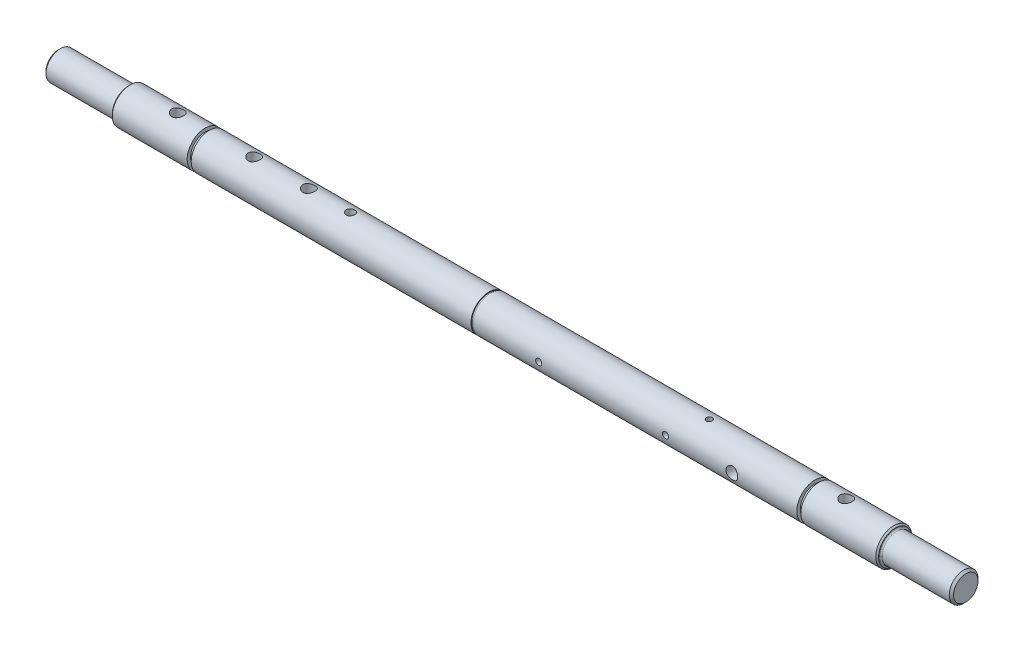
ISO-10303-21;
HEADER;
FILE_DESCRIPTION(('STEP AP214'),'2;1');
FILE_NAME('part.step','',(''),(''),'','','');
FILE_SCHEMA(('AUTOMOTIVE_DESIGN { 1 0 10303 214 1 1 1 1 }'));
ENDSEC;
DATA;
#1=APPLICATION_CONTEXT('core data for automotive mechanical design processes');
#2=APPLICATION_PROTOCOL_DEFINITION('international standard','automotive_design',2000,#1);
#3=PRODUCT_CONTEXT('',#1,'mechanical');
#4=PRODUCT('Part','Part','',(#3));
#5=PRODUCT_RELATED_PRODUCT_CATEGORY('part','',(#4));
#6=PRODUCT_DEFINITION_FORMATION('','',#4);
#7=PRODUCT_DEFINITION_CONTEXT('part definition',#1,'design');
#8=PRODUCT_DEFINITION('design','',#6,#7);
#9=PRODUCT_DEFINITION_SHAPE('','',#8);
#10=(LENGTH_UNIT() NAMED_UNIT(*) SI_UNIT(.MILLI.,.METRE.));
#11=(NAMED_UNIT(*) PLANE_ANGLE_UNIT() SI_UNIT($,.RADIAN.));
#12=(NAMED_UNIT(*) SI_UNIT($,.STERADIAN.) SOLID_ANGLE_UNIT());
#13=UNCERTAINTY_MEASURE_WITH_UNIT(LENGTH_MEASURE(1.E-05),#10,'distance_accuracy_value','');
#14=(GEOMETRIC_REPRESENTATION_CONTEXT(3) GLOBAL_UNCERTAINTY_ASSIGNED_CONTEXT((#13)) GLOBAL_UNIT_ASSIGNED_CONTEXT((#10,
#11,#12)) REPRESENTATION_CONTEXT('',''));
#15=CARTESIAN_POINT('',(0.,0.,0.));
#16=DIRECTION('',(0.,0.,1.));
#17=DIRECTION('',(1.,0.,0.));
#18=AXIS2_PLACEMENT_3D('',#15,#16,#17);
#19=CARTESIAN_POINT('',(0.,-1.2490009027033E-13,0.));
#20=DIRECTION('',(-1.,0.,0.));
#21=DIRECTION('',(0.,0.,1.));
#22=AXIS2_PLACEMENT_3D('',#19,#20,#21);
#23=CYLINDRICAL_SURFACE('',#22,12.5);
#24=CARTESIAN_POINT('',(299.,0.,0.));
#25=DIRECTION('',(-1.,0.,0.));
#26=DIRECTION('',(0.,0.,1.));
#27=AXIS2_PLACEMENT_3D('',#24,#25,#26);
#28=CIRCLE('',#27,12.5);
#29=CARTESIAN_POINT('',(299.,0.,12.5));
#30=VERTEX_POINT('',#29);
#31=EDGE_CURVE('E518',#30,#30,#28,.T.);
#32=ORIENTED_EDGE('',*,*,#31,.T.);
#33=EDGE_LOOP('',(#32));
#34=FACE_BOUND('',#33,.T.);
#35=CARTESIAN_POINT('',(104.8,0.,0.));
#36=DIRECTION('',(-1.,0.,0.));
#37=DIRECTION('',(0.,0.,1.));
#38=AXIS2_PLACEMENT_3D('',#35,#36,#37);
#39=CIRCLE('',#38,12.5);
#40=CARTESIAN_POINT('',(104.8,0.,12.5));
#41=VERTEX_POINT('',#40);
#42=EDGE_CURVE('E515',#41,#41,#39,.T.);
#43=ORIENTED_EDGE('',*,*,#42,.F.);
#44=EDGE_LOOP('',(#43));
#45=FACE_BOUND('',#44,.T.);
#46=CARTESIAN_POINT('',(136.,11.7997616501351,4.12500000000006));
#47=CARTESIAN_POINT('',(135.775176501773,11.799761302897,4.12500060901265));
#48=CARTESIAN_POINT('',(135.550355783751,11.8062573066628,4.10655759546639));
#49=CARTESIAN_POINT('',(135.107365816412,11.8314077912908,4.03351542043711));
#50=CARTESIAN_POINT('',(134.889197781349,11.8500644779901,3.97890969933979));
#51=CARTESIAN_POINT('',(134.466000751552,11.8971979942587,3.83566164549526));
#52=CARTESIAN_POINT('',(134.260947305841,11.9256558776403,3.74708494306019));
#53=CARTESIAN_POINT('',(133.868546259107,11.9891579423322,3.53863258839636));
#54=CARTESIAN_POINT('',(133.681202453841,12.0242035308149,3.41875024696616));
#55=CARTESIAN_POINT('',(133.322355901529,12.0984391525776,3.1461663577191));
#56=CARTESIAN_POINT('',(133.151631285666,12.1377309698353,2.99246789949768));
#57=CARTESIAN_POINT('',(132.837851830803,12.2151705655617,2.65874319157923));
#58=CARTESIAN_POINT('',(132.694801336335,12.2533181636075,2.47871281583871));
#59=CARTESIAN_POINT('',(132.436916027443,12.3253472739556,2.09176053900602));
#60=CARTESIAN_POINT('',(132.322894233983,12.3590951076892,1.88426971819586));
#61=CARTESIAN_POINT('',(132.131678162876,12.4173246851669,1.45174921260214));
#62=CARTESIAN_POINT('',(132.054474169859,12.4418088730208,1.22672417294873));
#63=CARTESIAN_POINT('',(131.941717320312,12.4780315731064,0.773679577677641));
#64=CARTESIAN_POINT('',(131.904831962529,12.4901768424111,0.546024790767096));
#65=CARTESIAN_POINT('',(131.869525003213,12.5017959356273,0.0874550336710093));
#66=CARTESIAN_POINT('',(131.871093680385,12.5012729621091,-0.143459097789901));
#67=CARTESIAN_POINT('',(131.911799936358,12.487891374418,-0.592569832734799));
#68=CARTESIAN_POINT('',(131.949490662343,12.4755078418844,-0.810914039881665));
#69=CARTESIAN_POINT('',(132.058981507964,12.4403910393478,-1.23798394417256));
#70=CARTESIAN_POINT('',(132.130783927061,12.4176570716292,-1.44670899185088));
#71=CARTESIAN_POINT('',(132.30731844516,12.363783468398,-1.85180776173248));
#72=CARTESIAN_POINT('',(132.412466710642,12.3325383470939,-2.04798551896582));
#73=CARTESIAN_POINT('',(132.652366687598,12.2649012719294,-2.42034350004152));
#74=CARTESIAN_POINT('',(132.787126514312,12.2285079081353,-2.59651822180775));
#75=CARTESIAN_POINT('',(133.089737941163,12.1524323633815,-2.9324793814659));
#76=CARTESIAN_POINT('',(133.25883076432,12.1126759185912,-3.09113261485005));
#77=CARTESIAN_POINT('',(133.621566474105,12.0357781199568,-3.37819250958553));
#78=CARTESIAN_POINT('',(133.815212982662,11.9986371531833,-3.50659470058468));
#79=CARTESIAN_POINT('',(134.225085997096,11.930774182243,-3.73103455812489));
#80=CARTESIAN_POINT('',(134.441585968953,11.9001472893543,-3.82660376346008));
#81=CARTESIAN_POINT('',(134.888869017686,11.8498836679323,-3.97954954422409));
#82=CARTESIAN_POINT('',(135.119646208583,11.8302424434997,-4.03694174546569));
#83=CARTESIAN_POINT('',(135.577975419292,11.8051881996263,-4.10961706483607));
#84=CARTESIAN_POINT('',(135.805217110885,11.7991831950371,-4.12665364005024));
#85=CARTESIAN_POINT('',(136.259344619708,11.800428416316,-4.12309373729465));
#86=CARTESIAN_POINT('',(136.48623049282,11.8076762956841,-4.10250392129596));
#87=CARTESIAN_POINT('',(136.925300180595,11.8340213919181,-4.02584992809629));
#88=CARTESIAN_POINT('',(137.137721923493,11.8527143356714,-3.97099481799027));
#89=CARTESIAN_POINT('',(137.550306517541,11.8994012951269,-3.82881307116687));
#90=CARTESIAN_POINT('',(137.750467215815,11.9273969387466,-3.74148075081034));
#91=CARTESIAN_POINT('',(138.139775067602,11.9906181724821,-3.53372106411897));
#92=CARTESIAN_POINT('',(138.328382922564,12.0260422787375,-3.41234516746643));
#93=CARTESIAN_POINT('',(138.683189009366,12.0997396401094,-3.14102394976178));
#94=CARTESIAN_POINT('',(138.849380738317,12.1380137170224,-2.99107036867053));
#95=CARTESIAN_POINT('',(139.162707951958,12.2152747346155,-2.65847809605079));
#96=CARTESIAN_POINT('',(139.308580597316,12.254210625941,-2.47463440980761));
#97=CARTESIAN_POINT('',(139.567481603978,12.3266301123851,-2.08412294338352));
#98=CARTESIAN_POINT('',(139.680511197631,12.3601139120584,-1.87745601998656));
#99=CARTESIAN_POINT('',(139.869472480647,12.417693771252,-1.44823928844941));
#100=CARTESIAN_POINT('',(139.945651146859,12.4418521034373,-1.22580700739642));
#101=CARTESIAN_POINT('',(140.059216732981,12.4783286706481,-0.770336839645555));
#102=CARTESIAN_POINT('',(140.096617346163,12.4906510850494,-0.537302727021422));
#103=CARTESIAN_POINT('',(140.130352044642,12.5017582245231,-0.0788064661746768));
#104=CARTESIAN_POINT('',(140.128500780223,12.5011411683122,0.146509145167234));
#105=CARTESIAN_POINT('',(140.088246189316,12.4879050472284,0.593470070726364));
#106=CARTESIAN_POINT('',(140.049845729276,12.4752869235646,0.815115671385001));
#107=CARTESIAN_POINT('',(139.938779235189,12.4396810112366,1.24507416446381));
#108=CARTESIAN_POINT('',(139.866646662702,12.4168548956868,1.45353920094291));
#109=CARTESIAN_POINT('',(139.690655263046,12.3631836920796,1.85549201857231));
#110=CARTESIAN_POINT('',(139.586790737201,12.3323371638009,2.04897710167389));
#111=CARTESIAN_POINT('',(139.345918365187,12.2644093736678,2.42317095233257));
#112=CARTESIAN_POINT('',(139.207839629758,12.2271417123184,2.60315610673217));
#113=CARTESIAN_POINT('',(138.90429087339,12.1510378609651,2.9379954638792));
#114=CARTESIAN_POINT('',(138.738812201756,12.1122011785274,3.09284169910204));
#115=CARTESIAN_POINT('',(138.377610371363,12.0355780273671,3.37900449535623));
#116=CARTESIAN_POINT('',(138.180974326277,11.9978881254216,3.50919823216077));
#117=CARTESIAN_POINT('',(137.767445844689,11.9296592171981,3.73459070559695));
#118=CARTESIAN_POINT('',(137.550559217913,11.8991181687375,3.82979944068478));
#119=CARTESIAN_POINT('',(137.114141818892,11.8503659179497,3.9780183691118));
#120=CARTESIAN_POINT('',(136.895329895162,11.8315980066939,4.03295887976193));
#121=CARTESIAN_POINT('',(136.451009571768,11.8062980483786,4.10644343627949));
#122=CARTESIAN_POINT('',(136.225503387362,11.7997619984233,4.12499938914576));
#123=CARTESIAN_POINT('',(136.,11.7997616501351,4.12500000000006));
#124=B_SPLINE_CURVE_WITH_KNOTS('',3,(#46,#47,#48,#49,#50,#51,#52,#53,#54,#55,#56,#57,#58,#59,
#60,#61,#62,#63,#64,#65,#66,#67,#68,#69,#70,#71,#72,#73,#74,#75,#76,#77,#78,#79,#80,#81,#82,#83,
#84,#85,#86,#87,#88,#89,#90,#91,#92,#93,#94,#95,#96,#97,#98,#99,#100,#101,#102,#103,#104,#105,
#106,#107,#108,#109,#110,#111,#112,#113,#114,#115,#116,#117,#118,#119,#120,#121,#122,#123),
.UNSPECIFIED.,.T.,.F.,(4,2,2,2,2,2,2,2,2,2,2,2,2,2,2,2,2,2,2,2,2,2,2,2,2,2,2,2,2,2,2,2,2,2,2,2,
2,2,4),(0.,0.673635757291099,1.34739373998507,2.0198565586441,2.69246318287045,3.38847608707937,
4.08459816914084,4.79848121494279,5.51217577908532,6.20149469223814,6.89063934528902,
7.55328621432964,8.2159777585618,8.88728888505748,9.55878421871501,10.2613032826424,
10.9639260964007,11.6761937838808,12.3881697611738,13.0685925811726,13.7488949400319,
14.4064520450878,15.0641242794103,15.7423391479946,16.4207503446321,17.1310483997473,
17.8413197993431,18.5467625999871,19.2519562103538,19.924622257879,20.5972355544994,
21.2595538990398,21.9219912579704,22.6085954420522,23.2954168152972,24.0084365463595,
24.7212523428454,25.3971464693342,26.0728193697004),.UNSPECIFIED.);
#125=CARTESIAN_POINT('',(136.,11.7997616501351,4.12500000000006));
#126=VERTEX_POINT('',#125);
#127=EDGE_CURVE('E173',#126,#126,#124,.T.);
#128=ORIENTED_EDGE('',*,*,#127,.T.);
#129=EDGE_LOOP('',(#128));
#130=FACE_BOUND('',#129,.T.);
#131=CARTESIAN_POINT('',(136.,-11.7997616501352,4.12500000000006));
#132=CARTESIAN_POINT('',(136.224823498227,-11.7997613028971,4.12500060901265));
#133=CARTESIAN_POINT('',(136.449644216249,-11.8062573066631,4.10655759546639));
#134=CARTESIAN_POINT('',(136.892634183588,-11.8314077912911,4.03351542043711));
#135=CARTESIAN_POINT('',(137.110802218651,-11.8500644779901,3.97890969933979));
#136=CARTESIAN_POINT('',(137.533999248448,-11.8971979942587,3.83566164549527));
#137=CARTESIAN_POINT('',(137.739052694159,-11.9256558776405,3.74708494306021));
#138=CARTESIAN_POINT('',(138.131453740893,-11.9891579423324,3.53863258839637));
#139=CARTESIAN_POINT('',(138.318797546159,-12.0242035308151,3.41875024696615));
#140=CARTESIAN_POINT('',(138.677644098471,-12.0984391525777,3.14616635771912));
#141=CARTESIAN_POINT('',(138.848368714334,-12.1377309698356,2.99246789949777));
#142=CARTESIAN_POINT('',(139.162148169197,-12.2151705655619,2.6587431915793));
#143=CARTESIAN_POINT('',(139.305198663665,-12.2533181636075,2.47871281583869));
#144=CARTESIAN_POINT('',(139.563083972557,-12.3253472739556,2.091760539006));
#145=CARTESIAN_POINT('',(139.677105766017,-12.3590951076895,1.88426971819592));
#146=CARTESIAN_POINT('',(139.868321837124,-12.4173246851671,1.45174921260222));
#147=CARTESIAN_POINT('',(139.945525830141,-12.4418088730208,1.22672417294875));
#148=CARTESIAN_POINT('',(140.058282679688,-12.4780315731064,0.773679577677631));
#149=CARTESIAN_POINT('',(140.095168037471,-12.4901768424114,0.546024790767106));
#150=CARTESIAN_POINT('',(140.130474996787,-12.5017959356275,0.0874550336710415));
#151=CARTESIAN_POINT('',(140.128906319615,-12.5012729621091,-0.143459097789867));
#152=CARTESIAN_POINT('',(140.088200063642,-12.487891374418,-0.592569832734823));
#153=CARTESIAN_POINT('',(140.050509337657,-12.4755078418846,-0.810914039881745));
#154=CARTESIAN_POINT('',(139.941018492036,-12.4403910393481,-1.2379839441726));
#155=CARTESIAN_POINT('',(139.869216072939,-12.4176570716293,-1.44670899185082));
#156=CARTESIAN_POINT('',(139.692681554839,-12.3637834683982,-1.85180776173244));
#157=CARTESIAN_POINT('',(139.587533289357,-12.3325383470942,-2.04798551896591));
#158=CARTESIAN_POINT('',(139.347633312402,-12.2649012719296,-2.4203435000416));
#159=CARTESIAN_POINT('',(139.212873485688,-12.2285079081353,-2.59651822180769));
#160=CARTESIAN_POINT('',(138.910262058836,-12.1524323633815,-2.93247938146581));
#161=CARTESIAN_POINT('',(138.74116923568,-12.1126759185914,-3.0911326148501));
#162=CARTESIAN_POINT('',(138.378433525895,-12.0357781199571,-3.37819250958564));
#163=CARTESIAN_POINT('',(138.184787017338,-11.9986371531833,-3.50659470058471));
#164=CARTESIAN_POINT('',(137.774914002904,-11.930774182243,-3.73103455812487));
#165=CARTESIAN_POINT('',(137.558414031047,-11.9001472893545,-3.82660376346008));
#166=CARTESIAN_POINT('',(137.111130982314,-11.8498836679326,-3.9795495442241));
#167=CARTESIAN_POINT('',(136.880353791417,-11.8302424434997,-4.03694174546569));
#168=CARTESIAN_POINT('',(136.422024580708,-11.8051881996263,-4.10961706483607));
#169=CARTESIAN_POINT('',(136.194782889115,-11.7991831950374,-4.12665364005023));
#170=CARTESIAN_POINT('',(135.740655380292,-11.8004284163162,-4.12309373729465));
#171=CARTESIAN_POINT('',(135.51376950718,-11.8076762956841,-4.10250392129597));
#172=CARTESIAN_POINT('',(135.074699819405,-11.8340213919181,-4.0258499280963));
#173=CARTESIAN_POINT('',(134.862278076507,-11.8527143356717,-3.97099481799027));
#174=CARTESIAN_POINT('',(134.449693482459,-11.8994012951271,-3.8288130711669));
#175=CARTESIAN_POINT('',(134.249532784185,-11.9273969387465,-3.74148075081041));
#176=CARTESIAN_POINT('',(133.860224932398,-11.990618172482,-3.53372106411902));
#177=CARTESIAN_POINT('',(133.671617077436,-12.0260422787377,-3.4123451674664));
#178=CARTESIAN_POINT('',(133.316810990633,-12.0997396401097,-3.14102394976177));
#179=CARTESIAN_POINT('',(133.150619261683,-12.1380137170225,-2.99107036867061));
#180=CARTESIAN_POINT('',(132.837292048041,-12.2152747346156,-2.65847809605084));
#181=CARTESIAN_POINT('',(132.691419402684,-12.2542106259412,-2.47463440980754));
#182=CARTESIAN_POINT('',(132.432518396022,-12.3266301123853,-2.08412294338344));
#183=CARTESIAN_POINT('',(132.319488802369,-12.3601139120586,-1.87745601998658));
#184=CARTESIAN_POINT('',(132.130527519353,-12.4176937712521,-1.44823928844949));
#185=CARTESIAN_POINT('',(132.054348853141,-12.4418521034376,-1.22580700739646));
#186=CARTESIAN_POINT('',(131.940783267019,-12.4783286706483,-0.770336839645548));
#187=CARTESIAN_POINT('',(131.903382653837,-12.4906510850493,-0.537302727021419));
#188=CARTESIAN_POINT('',(131.869647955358,-12.5017582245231,-0.0788064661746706));
#189=CARTESIAN_POINT('',(131.871499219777,-12.5011411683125,0.146509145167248));
#190=CARTESIAN_POINT('',(131.911753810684,-12.4879050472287,0.59347007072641));
#191=CARTESIAN_POINT('',(131.950154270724,-12.4752869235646,0.815115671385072));
#192=CARTESIAN_POINT('',(132.06122076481,-12.4396810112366,1.24507416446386));
#193=CARTESIAN_POINT('',(132.133353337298,-12.416854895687,1.45353920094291));
#194=CARTESIAN_POINT('',(132.309344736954,-12.3631836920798,1.85549201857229));
#195=CARTESIAN_POINT('',(132.413209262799,-12.3323371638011,2.04897710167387));
#196=CARTESIAN_POINT('',(132.654081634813,-12.2644093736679,2.42317095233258));
#197=CARTESIAN_POINT('',(132.792160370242,-12.2271417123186,2.6031561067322));
#198=CARTESIAN_POINT('',(133.09570912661,-12.1510378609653,2.93799546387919));
#199=CARTESIAN_POINT('',(133.261187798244,-12.1122011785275,3.09284169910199));
#200=CARTESIAN_POINT('',(133.622389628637,-12.0355780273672,3.37900449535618));
#201=CARTESIAN_POINT('',(133.819025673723,-11.9978881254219,3.50919823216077));
#202=CARTESIAN_POINT('',(134.23255415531,-11.9296592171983,3.73459070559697));
#203=CARTESIAN_POINT('',(134.449440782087,-11.8991181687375,3.82979944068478));
#204=CARTESIAN_POINT('',(134.885858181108,-11.8503659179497,3.97801836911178));
#205=CARTESIAN_POINT('',(135.104670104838,-11.8315980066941,4.03295887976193));
#206=CARTESIAN_POINT('',(135.548990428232,-11.8062980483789,4.10644343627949));
#207=CARTESIAN_POINT('',(135.774496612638,-11.7997619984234,4.12499938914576));
#208=CARTESIAN_POINT('',(136.,-11.7997616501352,4.12500000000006));
#209=B_SPLINE_CURVE_WITH_KNOTS('',3,(#131,#132,#133,#134,#135,#136,#137,#138,#139,#140,#141,
#142,#143,#144,#145,#146,#147,#148,#149,#150,#151,#152,#153,#154,#155,#156,#157,#158,#159,#160,
#161,#162,#163,#164,#165,#166,#167,#168,#169,#170,#171,#172,#173,#174,#175,#176,#177,#178,#179,
#180,#181,#182,#183,#184,#185,#186,#187,#188,#189,#190,#191,#192,#193,#194,#195,#196,#197,#198,
#199,#200,#201,#202,#203,#204,#205,#206,#207,#208),.UNSPECIFIED.,.T.,.F.,(4,2,2,2,2,2,2,2,2,2,2,
2,2,2,2,2,2,2,2,2,2,2,2,2,2,2,2,2,2,2,2,2,2,2,2,2,2,2,4),(0.,0.673635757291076,1.34739373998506,
2.01985655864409,2.69246318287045,3.38847608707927,4.08459816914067,4.7984812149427,
5.51217577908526,6.20149469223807,6.89063934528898,7.5532862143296,8.21597775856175,
8.88728888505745,9.55878421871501,10.2613032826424,10.9639260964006,11.6761937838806,
12.3881697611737,13.0685925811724,13.7488949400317,14.4064520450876,15.0641242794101,
15.7423391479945,16.4207503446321,17.1310483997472,17.8413197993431,18.546762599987,
19.2519562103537,19.9246222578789,20.5972355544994,21.2595538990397,21.9219912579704,
22.6085954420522,23.2954168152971,24.0084365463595,24.7212523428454,25.3971464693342,
26.0728193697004),.UNSPECIFIED.);
#210=CARTESIAN_POINT('',(136.,-11.7997616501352,4.12500000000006));
#211=VERTEX_POINT('',#210);
#212=EDGE_CURVE('E63',#211,#211,#209,.T.);
#213=ORIENTED_EDGE('',*,*,#212,.T.);
#214=EDGE_LOOP('',(#213));
#215=FACE_BOUND('',#214,.T.);
#216=CARTESIAN_POINT('',(174.,11.7997616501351,4.12500000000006));
#217=CARTESIAN_POINT('',(173.775176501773,11.7997613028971,4.12500060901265));
#218=CARTESIAN_POINT('',(173.550355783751,11.8062573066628,4.1065575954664));
#219=CARTESIAN_POINT('',(173.107365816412,11.8314077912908,4.03351542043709));
#220=CARTESIAN_POINT('',(172.889197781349,11.8500644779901,3.97890969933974));
#221=CARTESIAN_POINT('',(172.466000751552,11.8971979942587,3.8356616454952));
#222=CARTESIAN_POINT('',(172.260947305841,11.9256558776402,3.74708494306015));
#223=CARTESIAN_POINT('',(171.868546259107,11.9891579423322,3.53863258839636));
#224=CARTESIAN_POINT('',(171.681202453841,12.024203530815,3.41875024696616));
#225=CARTESIAN_POINT('',(171.322355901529,12.0984391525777,3.14616635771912));
#226=CARTESIAN_POINT('',(171.151631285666,12.1377309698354,2.99246789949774));
#227=CARTESIAN_POINT('',(170.837851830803,12.2151705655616,2.65874319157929));
#228=CARTESIAN_POINT('',(170.694801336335,12.2533181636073,2.47871281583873));
#229=CARTESIAN_POINT('',(170.436916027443,12.3253472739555,2.09176053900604));
#230=CARTESIAN_POINT('',(170.322894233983,12.3590951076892,1.88426971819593));
#231=CARTESIAN_POINT('',(170.131678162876,12.4173246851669,1.45174921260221));
#232=CARTESIAN_POINT('',(170.054474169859,12.4418088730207,1.22672417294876));
#233=CARTESIAN_POINT('',(169.941717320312,12.4780315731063,0.773679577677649));
#234=CARTESIAN_POINT('',(169.904831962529,12.4901768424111,0.546024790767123));
#235=CARTESIAN_POINT('',(169.869525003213,12.5017959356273,0.0874550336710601));
#236=CARTESIAN_POINT('',(169.871093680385,12.501272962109,-0.143459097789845));
#237=CARTESIAN_POINT('',(169.911799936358,12.487891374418,-0.592569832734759));
#238=CARTESIAN_POINT('',(169.949490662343,12.4755078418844,-0.810914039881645));
#239=CARTESIAN_POINT('',(170.058981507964,12.4403910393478,-1.23798394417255));
#240=CARTESIAN_POINT('',(170.130783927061,12.4176570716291,-1.44670899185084));
#241=CARTESIAN_POINT('',(170.30731844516,12.3637834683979,-1.85180776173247));
#242=CARTESIAN_POINT('',(170.412466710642,12.3325383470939,-2.04798551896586));
#243=CARTESIAN_POINT('',(170.652366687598,12.2649012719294,-2.42034350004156));
#244=CARTESIAN_POINT('',(170.787126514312,12.2285079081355,-2.59651822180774));
#245=CARTESIAN_POINT('',(171.089737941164,12.1524323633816,-2.93247938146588));
#246=CARTESIAN_POINT('',(171.25883076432,12.1126759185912,-3.0911326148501));
#247=CARTESIAN_POINT('',(171.621566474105,12.0357781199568,-3.3781925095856));
#248=CARTESIAN_POINT('',(171.815212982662,11.9986371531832,-3.5065947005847));
#249=CARTESIAN_POINT('',(172.225085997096,11.9307741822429,-3.73103455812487));
#250=CARTESIAN_POINT('',(172.441585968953,11.9001472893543,-3.82660376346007));
#251=CARTESIAN_POINT('',(172.888869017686,11.8498836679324,-3.97954954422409));
#252=CARTESIAN_POINT('',(173.119646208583,11.8302424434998,-4.03694174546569));
#253=CARTESIAN_POINT('',(173.577975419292,11.8051881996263,-4.10961706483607));
#254=CARTESIAN_POINT('',(173.805217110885,11.7991831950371,-4.12665364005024));
#255=CARTESIAN_POINT('',(174.259344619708,11.800428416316,-4.12309373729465));
#256=CARTESIAN_POINT('',(174.48623049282,11.8076762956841,-4.10250392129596));
#257=CARTESIAN_POINT('',(174.925300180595,11.834021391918,-4.02584992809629));
#258=CARTESIAN_POINT('',(175.137721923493,11.8527143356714,-3.97099481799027));
#259=CARTESIAN_POINT('',(175.550306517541,11.8994012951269,-3.8288130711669));
#260=CARTESIAN_POINT('',(175.750467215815,11.9273969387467,-3.74148075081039));
#261=CARTESIAN_POINT('',(176.139775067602,11.9906181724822,-3.53372106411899));
#262=CARTESIAN_POINT('',(176.328382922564,12.0260422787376,-3.41234516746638));
#263=CARTESIAN_POINT('',(176.683189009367,12.0997396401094,-3.14102394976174));
#264=CARTESIAN_POINT('',(176.849380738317,12.1380137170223,-2.99107036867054));
#265=CARTESIAN_POINT('',(177.162707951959,12.2152747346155,-2.6584780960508));
#266=CARTESIAN_POINT('',(177.308580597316,12.254210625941,-2.47463440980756));
#267=CARTESIAN_POINT('',(177.567481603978,12.3266301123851,-2.08412294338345));
#268=CARTESIAN_POINT('',(177.680511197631,12.3601139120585,-1.87745601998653));
#269=CARTESIAN_POINT('',(177.869472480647,12.417693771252,-1.44823928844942));
#270=CARTESIAN_POINT('',(177.945651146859,12.4418521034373,-1.22580700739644));
#271=CARTESIAN_POINT('',(178.059216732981,12.4783286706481,-0.770336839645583));
#272=CARTESIAN_POINT('',(178.096617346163,12.4906510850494,-0.537302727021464));
#273=CARTESIAN_POINT('',(178.130352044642,12.5017582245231,-0.0788064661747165));
#274=CARTESIAN_POINT('',(178.128500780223,12.5011411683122,0.146509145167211));
#275=CARTESIAN_POINT('',(178.088246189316,12.4879050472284,0.593470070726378));
#276=CARTESIAN_POINT('',(178.049845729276,12.4752869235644,0.815115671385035));
#277=CARTESIAN_POINT('',(177.938779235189,12.4396810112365,1.24507416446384));
#278=CARTESIAN_POINT('',(177.866646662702,12.4168548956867,1.45353920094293));
#279=CARTESIAN_POINT('',(177.690655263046,12.3631836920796,1.85549201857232));
#280=CARTESIAN_POINT('',(177.586790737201,12.332337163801,2.0489771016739));
#281=CARTESIAN_POINT('',(177.345918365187,12.2644093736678,2.42317095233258));
#282=CARTESIAN_POINT('',(177.207839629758,12.2271417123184,2.60315610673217));
#283=CARTESIAN_POINT('',(176.90429087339,12.1510378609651,2.93799546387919));
#284=CARTESIAN_POINT('',(176.738812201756,12.1122011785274,3.09284169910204));
#285=CARTESIAN_POINT('',(176.377610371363,12.0355780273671,3.37900449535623));
#286=CARTESIAN_POINT('',(176.180974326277,11.9978881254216,3.50919823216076));
#287=CARTESIAN_POINT('',(175.76744584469,11.9296592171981,3.73459070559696));
#288=CARTESIAN_POINT('',(175.550559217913,11.8991181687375,3.82979944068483));
#289=CARTESIAN_POINT('',(175.114141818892,11.8503659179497,3.97801836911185));
#290=CARTESIAN_POINT('',(174.895329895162,11.8315980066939,4.03295887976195));
#291=CARTESIAN_POINT('',(174.451009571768,11.8062980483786,4.10644343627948));
#292=CARTESIAN_POINT('',(174.225503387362,11.7997619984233,4.12499938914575));
#293=CARTESIAN_POINT('',(174.,11.7997616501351,4.12500000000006));
#294=B_SPLINE_CURVE_WITH_KNOTS('',3,(#216,#217,#218,#219,#220,#221,#222,#223,#224,#225,#226,
#227,#228,#229,#230,#231,#232,#233,#234,#235,#236,#237,#238,#239,#240,#241,#242,#243,#244,#245,
#246,#247,#248,#249,#250,#251,#252,#253,#254,#255,#256,#257,#258,#259,#260,#261,#262,#263,#264,
#265,#266,#267,#268,#269,#270,#271,#272,#273,#274,#275,#276,#277,#278,#279,#280,#281,#282,#283,
#284,#285,#286,#287,#288,#289,#290,#291,#292,#293),.UNSPECIFIED.,.T.,.F.,(4,2,2,2,2,2,2,2,2,2,2,
2,2,2,2,2,2,2,2,2,2,2,2,2,2,2,2,2,2,2,2,2,2,2,2,2,2,2,4),(0.,0.673635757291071,1.34739373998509,
2.01985655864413,2.69246318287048,3.38847608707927,4.08459816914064,4.79848121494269,
5.51217577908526,6.20149469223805,6.89063934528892,7.55328621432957,8.21597775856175,
8.88728888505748,9.55878421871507,10.2613032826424,10.9639260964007,11.6761937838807,
12.3881697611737,13.0685925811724,13.7488949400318,14.4064520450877,15.0641242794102,
15.7423391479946,16.4207503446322,17.1310483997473,17.8413197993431,18.5467625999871,
19.2519562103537,19.9246222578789,20.5972355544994,21.2595538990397,21.9219912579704,
22.6085954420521,23.2954168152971,24.0084365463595,24.7212523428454,25.3971464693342,
26.0728193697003),.UNSPECIFIED.);
#295=CARTESIAN_POINT('',(174.,11.7997616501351,4.12500000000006));
#296=VERTEX_POINT('',#295);
#297=EDGE_CURVE('E156',#296,#296,#294,.T.);
#298=ORIENTED_EDGE('',*,*,#297,.T.);
#299=EDGE_LOOP('',(#298));
#300=FACE_BOUND('',#299,.T.);
#301=CARTESIAN_POINT('',(174.,-11.7997616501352,4.12500000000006));
#302=CARTESIAN_POINT('',(174.224823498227,-11.7997613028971,4.12500060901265));
#303=CARTESIAN_POINT('',(174.449644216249,-11.8062573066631,4.10655759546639));
#304=CARTESIAN_POINT('',(174.892634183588,-11.8314077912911,4.03351542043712));
#305=CARTESIAN_POINT('',(175.110802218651,-11.8500644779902,3.9789096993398));
#306=CARTESIAN_POINT('',(175.533999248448,-11.8971979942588,3.83566164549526));
#307=CARTESIAN_POINT('',(175.739052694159,-11.9256558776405,3.74708494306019));
#308=CARTESIAN_POINT('',(176.131453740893,-11.9891579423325,3.53863258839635));
#309=CARTESIAN_POINT('',(176.318797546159,-12.0242035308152,3.41875024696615));
#310=CARTESIAN_POINT('',(176.677644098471,-12.0984391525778,3.14616635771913));
#311=CARTESIAN_POINT('',(176.848368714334,-12.1377309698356,2.99246789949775));
#312=CARTESIAN_POINT('',(177.162148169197,-12.2151705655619,2.65874319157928));
#313=CARTESIAN_POINT('',(177.305198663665,-12.2533181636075,2.47871281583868));
#314=CARTESIAN_POINT('',(177.563083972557,-12.3253472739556,2.09176053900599));
#315=CARTESIAN_POINT('',(177.677105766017,-12.3590951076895,1.8842697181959));
#316=CARTESIAN_POINT('',(177.868321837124,-12.4173246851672,1.4517492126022));
#317=CARTESIAN_POINT('',(177.945525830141,-12.4418088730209,1.22672417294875));
#318=CARTESIAN_POINT('',(178.058282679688,-12.4780315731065,0.773679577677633));
#319=CARTESIAN_POINT('',(178.095168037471,-12.4901768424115,0.546024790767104));
#320=CARTESIAN_POINT('',(178.130474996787,-12.5017959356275,0.0874550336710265));
#321=CARTESIAN_POINT('',(178.128906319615,-12.5012729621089,-0.14345909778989));
#322=CARTESIAN_POINT('',(178.088200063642,-12.4878913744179,-0.592569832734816));
#323=CARTESIAN_POINT('',(178.050509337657,-12.4755078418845,-0.810914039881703));
#324=CARTESIAN_POINT('',(177.941018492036,-12.4403910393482,-1.23798394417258));
#325=CARTESIAN_POINT('',(177.869216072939,-12.4176570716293,-1.44670899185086));
#326=CARTESIAN_POINT('',(177.69268155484,-12.3637834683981,-1.85180776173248));
#327=CARTESIAN_POINT('',(177.587533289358,-12.3325383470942,-2.04798551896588));
#328=CARTESIAN_POINT('',(177.347633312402,-12.2649012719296,-2.42034350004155));
#329=CARTESIAN_POINT('',(177.212873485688,-12.2285079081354,-2.59651822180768));
#330=CARTESIAN_POINT('',(176.910262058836,-12.1524323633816,-2.93247938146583));
#331=CARTESIAN_POINT('',(176.74116923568,-12.1126759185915,-3.0911326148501));
#332=CARTESIAN_POINT('',(176.378433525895,-12.035778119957,-3.37819250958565));
#333=CARTESIAN_POINT('',(176.184787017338,-11.9986371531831,-3.50659470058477));
#334=CARTESIAN_POINT('',(175.774914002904,-11.9307741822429,-3.73103455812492));
#335=CARTESIAN_POINT('',(175.558414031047,-11.9001472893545,-3.82660376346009));
#336=CARTESIAN_POINT('',(175.111130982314,-11.8498836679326,-3.97954954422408));
#337=CARTESIAN_POINT('',(174.880353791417,-11.8302424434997,-4.03694174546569));
#338=CARTESIAN_POINT('',(174.422024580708,-11.8051881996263,-4.10961706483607));
#339=CARTESIAN_POINT('',(174.194782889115,-11.7991831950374,-4.12665364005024));
#340=CARTESIAN_POINT('',(173.740655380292,-11.8004284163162,-4.12309373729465));
#341=CARTESIAN_POINT('',(173.51376950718,-11.8076762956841,-4.10250392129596));
#342=CARTESIAN_POINT('',(173.074699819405,-11.834021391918,-4.02584992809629));
#343=CARTESIAN_POINT('',(172.862278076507,-11.8527143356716,-3.97099481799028));
#344=CARTESIAN_POINT('',(172.449693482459,-11.8994012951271,-3.82881307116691));
#345=CARTESIAN_POINT('',(172.249532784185,-11.9273969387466,-3.74148075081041));
#346=CARTESIAN_POINT('',(171.860224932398,-11.9906181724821,-3.53372106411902));
#347=CARTESIAN_POINT('',(171.671617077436,-12.0260422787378,-3.41234516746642));
#348=CARTESIAN_POINT('',(171.316810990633,-12.0997396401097,-3.14102394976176));
#349=CARTESIAN_POINT('',(171.150619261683,-12.1380137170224,-2.99107036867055));
#350=CARTESIAN_POINT('',(170.837292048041,-12.2152747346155,-2.6584780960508));
#351=CARTESIAN_POINT('',(170.691419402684,-12.2542106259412,-2.47463440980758));
#352=CARTESIAN_POINT('',(170.432518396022,-12.3266301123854,-2.08412294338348));
#353=CARTESIAN_POINT('',(170.319488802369,-12.3601139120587,-1.87745601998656));
#354=CARTESIAN_POINT('',(170.130527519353,-12.4176937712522,-1.44823928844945));
#355=CARTESIAN_POINT('',(170.054348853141,-12.4418521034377,-1.22580700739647));
#356=CARTESIAN_POINT('',(169.940783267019,-12.4783286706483,-0.770336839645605));
#357=CARTESIAN_POINT('',(169.903382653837,-12.4906510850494,-0.537302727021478));
#358=CARTESIAN_POINT('',(169.869647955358,-12.5017582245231,-0.078806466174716));
#359=CARTESIAN_POINT('',(169.871499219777,-12.5011411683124,0.146509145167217));
#360=CARTESIAN_POINT('',(169.911753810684,-12.4879050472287,0.593470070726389));
#361=CARTESIAN_POINT('',(169.950154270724,-12.4752869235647,0.815115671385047));
#362=CARTESIAN_POINT('',(170.061220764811,-12.4396810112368,1.24507416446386));
#363=CARTESIAN_POINT('',(170.133353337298,-12.416854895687,1.45353920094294));
#364=CARTESIAN_POINT('',(170.309344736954,-12.3631836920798,1.85549201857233));
#365=CARTESIAN_POINT('',(170.413209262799,-12.3323371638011,2.0489771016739));
#366=CARTESIAN_POINT('',(170.654081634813,-12.2644093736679,2.42317095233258));
#367=CARTESIAN_POINT('',(170.792160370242,-12.2271417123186,2.6031561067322));
#368=CARTESIAN_POINT('',(171.09570912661,-12.1510378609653,2.93799546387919));
#369=CARTESIAN_POINT('',(171.261187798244,-12.1122011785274,3.09284169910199));
#370=CARTESIAN_POINT('',(171.622389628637,-12.0355780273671,3.37900449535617));
#371=CARTESIAN_POINT('',(171.819025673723,-11.9978881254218,3.50919823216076));
#372=CARTESIAN_POINT('',(172.23255415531,-11.9296592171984,3.73459070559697));
#373=CARTESIAN_POINT('',(172.449440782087,-11.8991181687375,3.82979944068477));
#374=CARTESIAN_POINT('',(172.885858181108,-11.8503659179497,3.97801836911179));
#375=CARTESIAN_POINT('',(173.104670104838,-11.8315980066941,4.03295887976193));
#376=CARTESIAN_POINT('',(173.548990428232,-11.8062980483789,4.1064434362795));
#377=CARTESIAN_POINT('',(173.774496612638,-11.7997619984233,4.12499938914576));
#378=CARTESIAN_POINT('',(174.,-11.7997616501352,4.12500000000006));
#379=B_SPLINE_CURVE_WITH_KNOTS('',3,(#301,#302,#303,#304,#305,#306,#307,#308,#309,#310,#311,
#312,#313,#314,#315,#316,#317,#318,#319,#320,#321,#322,#323,#324,#325,#326,#327,#328,#329,#330,
#331,#332,#333,#334,#335,#336,#337,#338,#339,#340,#341,#342,#343,#344,#345,#346,#347,#348,#349,
#350,#351,#352,#353,#354,#355,#356,#357,#358,#359,#360,#361,#362,#363,#364,#365,#366,#367,#368,
#369,#370,#371,#372,#373,#374,#375,#376,#377,#378),.UNSPECIFIED.,.T.,.F.,(4,2,2,2,2,2,2,2,2,2,2,
2,2,2,2,2,2,2,2,2,2,2,2,2,2,2,2,2,2,2,2,2,2,2,2,2,2,2,4),(0.,0.673635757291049,1.34739373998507,
2.01985655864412,2.69246318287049,3.3884760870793,4.08459816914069,4.79848121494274,
5.51217577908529,6.20149469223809,6.890639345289,7.55328621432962,8.21597775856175,
8.88728888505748,9.55878421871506,10.2613032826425,10.9639260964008,11.6761937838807,
12.3881697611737,13.0685925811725,13.7488949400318,14.4064520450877,15.0641242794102,
15.7423391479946,16.4207503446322,17.1310483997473,17.8413197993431,18.5467625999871,
19.2519562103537,19.9246222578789,20.5972355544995,21.2595538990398,21.9219912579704,
22.6085954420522,23.2954168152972,24.0084365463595,24.7212523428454,25.3971464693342,
26.0728193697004),.UNSPECIFIED.);
#380=CARTESIAN_POINT('',(174.,-11.7997616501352,4.12500000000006));
#381=VERTEX_POINT('',#380);
#382=EDGE_CURVE('E157',#381,#381,#379,.T.);
#383=ORIENTED_EDGE('',*,*,#382,.T.);
#384=EDGE_LOOP('',(#383));
#385=FACE_BOUND('',#384,.T.);
#386=CARTESIAN_POINT('',(203.,-12.3389626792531,1.99999999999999));
#387=CARTESIAN_POINT('',(203.11156671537,-12.3389646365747,1.99999546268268));
#388=CARTESIAN_POINT('',(203.223195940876,-12.3404922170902,1.99063305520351));
#389=CARTESIAN_POINT('',(203.443326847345,-12.3464325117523,1.95344445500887));
#390=CARTESIAN_POINT('',(203.551825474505,-12.3508479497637,1.92560083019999));
#391=CARTESIAN_POINT('',(203.762477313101,-12.3620513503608,1.85230972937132));
#392=CARTESIAN_POINT('',(203.864635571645,-12.3688373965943,1.80687646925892));
#393=CARTESIAN_POINT('',(204.059866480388,-12.3840151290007,1.69973041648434));
#394=CARTESIAN_POINT('',(204.152940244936,-12.3924066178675,1.6380196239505));
#395=CARTESIAN_POINT('',(204.328218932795,-12.409935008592,1.49947140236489));
#396=CARTESIAN_POINT('',(204.41032926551,-12.4190774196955,1.42251498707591));
#397=CARTESIAN_POINT('',(204.56052945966,-12.437028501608,1.25591709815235));
#398=CARTESIAN_POINT('',(204.628618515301,-12.4458371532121,1.16627489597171));
#399=CARTESIAN_POINT('',(204.749195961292,-12.4621862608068,0.976239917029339));
#400=CARTESIAN_POINT('',(204.801596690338,-12.4697194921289,0.875790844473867));
#401=CARTESIAN_POINT('',(204.88874693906,-12.4826077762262,0.667375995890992));
#402=CARTESIAN_POINT('',(204.923497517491,-12.4879629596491,0.559410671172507));
#403=CARTESIAN_POINT('',(204.974072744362,-12.4958528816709,0.340004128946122));
#404=CARTESIAN_POINT('',(204.990056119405,-12.4984112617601,0.228600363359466));
#405=CARTESIAN_POINT('',(205.003136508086,-12.5005004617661,0.00466480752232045));
#406=CARTESIAN_POINT('',(205.000234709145,-12.5000314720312,-0.107866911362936));
#407=CARTESIAN_POINT('',(204.975751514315,-12.4961375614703,-0.329779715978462));
#408=CARTESIAN_POINT('',(204.954340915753,-12.4927396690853,-0.439180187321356));
#409=CARTESIAN_POINT('',(204.893716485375,-12.4833998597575,-0.652815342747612));
#410=CARTESIAN_POINT('',(204.854502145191,-12.4774578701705,-0.757049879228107));
#411=CARTESIAN_POINT('',(204.7592115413,-12.4636513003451,-0.95790598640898));
#412=CARTESIAN_POINT('',(204.703064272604,-12.4557786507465,-1.0544932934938));
#413=CARTESIAN_POINT('',(204.575553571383,-12.4389865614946,-1.23693967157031));
#414=CARTESIAN_POINT('',(204.504189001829,-12.4300670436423,-1.32279794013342));
#415=CARTESIAN_POINT('',(204.34732043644,-12.4120565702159,-1.48235721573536));
#416=CARTESIAN_POINT('',(204.261667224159,-12.4029648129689,-1.55591150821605));
#417=CARTESIAN_POINT('',(204.079157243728,-12.3857313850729,-1.68762680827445));
#418=CARTESIAN_POINT('',(203.98230038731,-12.3775897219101,-1.74578769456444));
#419=CARTESIAN_POINT('',(203.779969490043,-12.3631781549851,-1.84509031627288));
#420=CARTESIAN_POINT('',(203.674487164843,-12.356910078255,-1.8862154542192));
#421=CARTESIAN_POINT('',(203.457989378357,-12.3469864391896,-1.95012354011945));
#422=CARTESIAN_POINT('',(203.346974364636,-12.343330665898,-1.97290796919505));
#423=CARTESIAN_POINT('',(203.123872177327,-12.3390860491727,-1.99928349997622));
#424=CARTESIAN_POINT('',(203.011810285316,-12.3384638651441,-2.00308326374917));
#425=CARTESIAN_POINT('',(202.788651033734,-12.3402681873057,-1.99193667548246));
#426=CARTESIAN_POINT('',(202.677553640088,-12.3426945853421,-1.97699098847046));
#427=CARTESIAN_POINT('',(202.460133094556,-12.3502919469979,-1.92895527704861));
#428=CARTESIAN_POINT('',(202.353786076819,-12.3554469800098,-1.8959705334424));
#429=CARTESIAN_POINT('',(202.148129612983,-12.3679074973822,-1.81290306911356));
#430=CARTESIAN_POINT('',(202.048820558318,-12.3752131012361,-1.76281939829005));
#431=CARTESIAN_POINT('',(201.859127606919,-12.3912295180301,-1.64647965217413));
#432=CARTESIAN_POINT('',(201.76882704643,-12.3999517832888,-1.58008930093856));
#433=CARTESIAN_POINT('',(201.600573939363,-12.4177848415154,-1.43320604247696));
#434=CARTESIAN_POINT('',(201.52262219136,-12.426895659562,-1.35271222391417));
#435=CARTESIAN_POINT('',(201.380522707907,-12.4445842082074,-1.17898475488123));
#436=CARTESIAN_POINT('',(201.316513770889,-12.4531560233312,-1.08563688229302));
#437=CARTESIAN_POINT('',(201.205086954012,-12.468707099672,-0.889391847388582));
#438=CARTESIAN_POINT('',(201.157668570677,-12.4756864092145,-0.786494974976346));
#439=CARTESIAN_POINT('',(201.080987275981,-12.4872402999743,-0.574493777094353));
#440=CARTESIAN_POINT('',(201.051650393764,-12.4918246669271,-0.46541676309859));
#441=CARTESIAN_POINT('',(201.011726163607,-12.4981133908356,-0.243805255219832));
#442=CARTESIAN_POINT('',(201.001137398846,-12.4998179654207,-0.131271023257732));
#443=CARTESIAN_POINT('',(200.999048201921,-12.5001523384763,0.0927181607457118));
#444=CARTESIAN_POINT('',(201.007336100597,-12.4988162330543,0.204171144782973));
#445=CARTESIAN_POINT('',(201.042308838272,-12.4932886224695,0.424076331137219));
#446=CARTESIAN_POINT('',(201.068993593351,-12.4890971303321,0.532528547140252));
#447=CARTESIAN_POINT('',(201.139923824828,-12.4783277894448,0.743282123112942));
#448=CARTESIAN_POINT('',(201.184152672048,-12.4717522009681,0.845589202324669));
#449=CARTESIAN_POINT('',(201.288892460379,-12.4569342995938,1.04136319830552));
#450=CARTESIAN_POINT('',(201.349404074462,-12.4486919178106,1.13482974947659));
#451=CARTESIAN_POINT('',(201.485748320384,-12.4313454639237,1.31133889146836));
#452=CARTESIAN_POINT('',(201.561736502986,-12.4222331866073,1.39426053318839));
#453=CARTESIAN_POINT('',(201.726549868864,-12.4042323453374,1.54625119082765));
#454=CARTESIAN_POINT('',(201.815378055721,-12.395343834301,1.61531695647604));
#455=CARTESIAN_POINT('',(202.004029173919,-12.3787350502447,1.73804191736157));
#456=CARTESIAN_POINT('',(202.103919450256,-12.371022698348,1.79159866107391));
#457=CARTESIAN_POINT('',(202.311358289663,-12.3577327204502,1.88109182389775));
#458=CARTESIAN_POINT('',(202.418898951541,-12.3521529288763,1.91704612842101));
#459=CARTESIAN_POINT('',(202.605737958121,-12.3450187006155,1.96235985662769));
#460=CARTESIAN_POINT('',(202.683895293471,-12.342760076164,1.9764527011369));
#461=CARTESIAN_POINT('',(202.841357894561,-12.3397313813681,1.99527431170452));
#462=CARTESIAN_POINT('',(202.920663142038,-12.3389612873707,2.00000322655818));
#463=CARTESIAN_POINT('',(203.,-12.3389626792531,1.99999999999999));
#464=B_SPLINE_CURVE_WITH_KNOTS('',3,(#386,#387,#388,#389,#390,#391,#392,#393,#394,#395,#396,
#397,#398,#399,#400,#401,#402,#403,#404,#405,#406,#407,#408,#409,#410,#411,#412,#413,#414,#415,
#416,#417,#418,#419,#420,#421,#422,#423,#424,#425,#426,#427,#428,#429,#430,#431,#432,#433,#434,
#435,#436,#437,#438,#439,#440,#441,#442,#443,#444,#445,#446,#447,#448,#449,#450,#451,#452,#453,
#454,#455,#456,#457,#458,#459,#460,#461,#462,#463),.UNSPECIFIED.,.T.,.F.,(4,2,2,2,2,2,2,2,2,2,2,
2,2,2,2,2,2,2,2,2,2,2,2,2,2,2,2,2,2,2,2,2,2,2,2,2,2,2,4),(0.,0.334410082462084,
0.669136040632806,1.00359203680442,1.33800695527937,1.67514269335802,2.01229780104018,
2.35130309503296,2.69028805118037,3.02638485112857,3.36246051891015,3.69546762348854,
4.02848423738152,4.36291718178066,4.69737512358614,5.03557384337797,5.37377522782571,
5.71230534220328,6.05080811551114,6.3855820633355,6.72034413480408,7.05317297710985,
7.38602031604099,7.72170617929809,8.05741374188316,8.39632425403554,8.73522448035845,
9.07272891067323,9.4102078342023,9.74392117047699,10.0776329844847,10.4110292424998,
10.7444392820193,11.0813822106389,11.4184040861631,11.7576040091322,12.0964585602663,
12.3342666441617,12.5720709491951),.UNSPECIFIED.);
#465=CARTESIAN_POINT('',(203.,-12.3389626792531,1.99999999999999));
#466=VERTEX_POINT('',#465);
#467=EDGE_CURVE('E128',#466,#466,#464,.T.);
#468=ORIENTED_EDGE('',*,*,#467,.T.);
#469=EDGE_LOOP('',(#468));
#470=FACE_BOUND('',#469,.T.);
#471=CARTESIAN_POINT('',(200.,12.5,0.));
#472=CARTESIAN_POINT('',(200.000005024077,12.4999970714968,0.165963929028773));
#473=CARTESIAN_POINT('',(200.013818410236,12.4966615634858,0.331985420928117));
#474=CARTESIAN_POINT('',(200.068632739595,12.4836783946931,0.659284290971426));
#475=CARTESIAN_POINT('',(200.109650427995,12.4740268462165,0.820558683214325));
#476=CARTESIAN_POINT('',(200.217492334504,12.4494823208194,1.13358839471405));
#477=CARTESIAN_POINT('',(200.284286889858,12.4345953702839,1.28535442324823));
#478=CARTESIAN_POINT('',(200.441685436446,12.4011725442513,1.57552517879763));
#479=CARTESIAN_POINT('',(200.532289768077,12.3826366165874,1.71392971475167));
#480=CARTESIAN_POINT('',(200.736564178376,12.3435386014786,1.97609263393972));
#481=CARTESIAN_POINT('',(200.850602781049,12.322947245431,2.09955952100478));
#482=CARTESIAN_POINT('',(201.097718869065,12.2822574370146,2.32581080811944));
#483=CARTESIAN_POINT('',(201.230798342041,12.2621590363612,2.42859304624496));
#484=CARTESIAN_POINT('',(201.514445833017,12.224437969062,2.6118999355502));
#485=CARTESIAN_POINT('',(201.665226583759,12.2068525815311,2.69210377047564));
#486=CARTESIAN_POINT('',(201.978619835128,12.1765733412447,2.82591582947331));
#487=CARTESIAN_POINT('',(202.141230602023,12.1638787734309,2.87952794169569));
#488=CARTESIAN_POINT('',(202.470476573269,12.1451184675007,2.95765058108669));
#489=CARTESIAN_POINT('',(202.636981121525,12.1389341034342,2.98268262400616));
#490=CARTESIAN_POINT('',(202.971932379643,12.1335389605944,3.00455808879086));
#491=CARTESIAN_POINT('',(203.140378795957,12.1343271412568,3.00140571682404));
#492=CARTESIAN_POINT('',(203.470475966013,12.1426811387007,2.96741912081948));
#493=CARTESIAN_POINT('',(203.63219456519,12.1500960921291,2.93720103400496));
#494=CARTESIAN_POINT('',(203.948197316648,12.1706283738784,2.85092141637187));
#495=CARTESIAN_POINT('',(204.102480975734,12.1837460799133,2.79485817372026));
#496=CARTESIAN_POINT('',(204.400912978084,12.2143476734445,2.65794121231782));
#497=CARTESIAN_POINT('',(204.544952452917,12.2318714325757,2.57685948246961));
#498=CARTESIAN_POINT('',(204.817604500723,12.2692875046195,2.39236688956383));
#499=CARTESIAN_POINT('',(204.946214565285,12.2891802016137,2.28895240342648));
#500=CARTESIAN_POINT('',(205.187893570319,12.329732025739,2.05951493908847));
#501=CARTESIAN_POINT('',(205.300467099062,12.3503975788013,1.93297064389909));
#502=CARTESIAN_POINT('',(205.502884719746,12.3896951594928,1.66255592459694));
#503=CARTESIAN_POINT('',(205.592728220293,12.4083271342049,1.51868504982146));
#504=CARTESIAN_POINT('',(205.747297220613,12.4415394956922,1.21702847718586));
#505=CARTESIAN_POINT('',(205.811947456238,12.4561077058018,1.05920278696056));
#506=CARTESIAN_POINT('',(205.913665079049,12.4794620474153,0.734497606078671));
#507=CARTESIAN_POINT('',(205.950737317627,12.4882491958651,0.567619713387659));
#508=CARTESIAN_POINT('',(205.995502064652,12.4989027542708,0.233787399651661));
#509=CARTESIAN_POINT('',(206.003869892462,12.5009282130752,0.0669284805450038));
#510=CARTESIAN_POINT('',(205.992833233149,12.4982807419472,-0.265804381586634));
#511=CARTESIAN_POINT('',(205.973431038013,12.4936083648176,-0.431678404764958));
#512=CARTESIAN_POINT('',(205.907963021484,12.4781916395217,-0.755422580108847));
#513=CARTESIAN_POINT('',(205.862260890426,12.4675301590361,-0.913370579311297));
#514=CARTESIAN_POINT('',(205.745901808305,12.4413335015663,-1.21935330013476));
#515=CARTESIAN_POINT('',(205.675242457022,12.4257978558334,-1.3673870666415));
#516=CARTESIAN_POINT('',(205.509633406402,12.3911910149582,-1.65206150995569));
#517=CARTESIAN_POINT('',(205.414299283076,12.3720653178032,-1.78847176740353));
#518=CARTESIAN_POINT('',(205.202543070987,12.3324936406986,-2.04359904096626));
#519=CARTESIAN_POINT('',(205.086117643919,12.3120474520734,-2.16231325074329));
#520=CARTESIAN_POINT('',(204.832359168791,12.271574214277,-2.38142453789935));
#521=CARTESIAN_POINT('',(204.694614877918,12.2515669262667,-2.48134974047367));
#522=CARTESIAN_POINT('',(204.403909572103,12.2147538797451,-2.65666020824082));
#523=CARTESIAN_POINT('',(204.250949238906,12.1979479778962,-2.7320465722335));
#524=CARTESIAN_POINT('',(203.934987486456,12.1696189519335,-2.85558993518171));
#525=CARTESIAN_POINT('',(203.772051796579,12.1580647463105,-2.90390754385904));
#526=CARTESIAN_POINT('',(203.440053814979,12.1415072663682,-2.97238380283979));
#527=CARTESIAN_POINT('',(203.270992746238,12.1365026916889,-2.99254804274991));
#528=CARTESIAN_POINT('',(202.936329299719,12.1337046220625,-3.00387066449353));
#529=CARTESIAN_POINT('',(202.770753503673,12.1357241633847,-2.99578106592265));
#530=CARTESIAN_POINT('',(202.443400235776,12.1463176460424,-2.95253345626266));
#531=CARTESIAN_POINT('',(202.281622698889,12.1548914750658,-2.91737590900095));
#532=CARTESIAN_POINT('',(201.967202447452,12.1775274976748,-2.82138591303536));
#533=CARTESIAN_POINT('',(201.814517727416,12.1915617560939,-2.76068402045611));
#534=CARTESIAN_POINT('',(201.521395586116,12.2235433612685,-2.61543373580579));
#535=CARTESIAN_POINT('',(201.380959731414,12.2414912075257,-2.53088229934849));
#536=CARTESIAN_POINT('',(201.11266299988,12.2798193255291,-2.33793007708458));
#537=CARTESIAN_POINT('',(200.985187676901,12.3002478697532,-2.22900267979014));
#538=CARTESIAN_POINT('',(200.750080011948,12.3409359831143,-1.99143074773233));
#539=CARTESIAN_POINT('',(200.64245233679,12.3611955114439,-1.86278158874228));
#540=CARTESIAN_POINT('',(200.448390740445,12.399657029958,-1.58688299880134));
#541=CARTESIAN_POINT('',(200.362331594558,12.4178200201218,-1.43936414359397));
#542=CARTESIAN_POINT('',(200.216370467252,12.449638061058,-1.13153622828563));
#543=CARTESIAN_POINT('',(200.156448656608,12.4632965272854,-0.971236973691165));
#544=CARTESIAN_POINT('',(200.073961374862,12.4824059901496,-0.675887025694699));
#545=CARTESIAN_POINT('',(200.046283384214,12.4889599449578,-0.542312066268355));
#546=CARTESIAN_POINT('',(200.009301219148,12.4977580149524,-0.272504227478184));
#547=CARTESIAN_POINT('',(199.999995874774,12.5000024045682,-0.136271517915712));
#548=CARTESIAN_POINT('',(200.,12.5,0.));
#549=B_SPLINE_CURVE_WITH_KNOTS('',3,(#471,#472,#473,#474,#475,#476,#477,#478,#479,#480,#481,
#482,#483,#484,#485,#486,#487,#488,#489,#490,#491,#492,#493,#494,#495,#496,#497,#498,#499,#500,
#501,#502,#503,#504,#505,#506,#507,#508,#509,#510,#511,#512,#513,#514,#515,#516,#517,#518,#519,
#520,#521,#522,#523,#524,#525,#526,#527,#528,#529,#530,#531,#532,#533,#534,#535,#536,#537,#538,
#539,#540,#541,#542,#543,#544,#545,#546,#547,#548),.UNSPECIFIED.,.T.,.F.,(4,2,2,2,2,2,2,2,2,2,2,
2,2,2,2,2,2,2,2,2,2,2,2,2,2,2,2,2,2,2,2,2,2,2,2,2,2,2,4),(0.,0.497392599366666,
0.995091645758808,1.49221966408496,1.98935478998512,2.4950057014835,3.000709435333,
3.51327262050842,4.02576083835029,4.52873995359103,5.0316440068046,5.5233827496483,
6.0151540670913,6.51154667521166,7.00801987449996,7.51749958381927,8.02699254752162,
8.53799614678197,9.04890983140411,9.54771776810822,10.0464845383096,10.538514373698,
11.030591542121,11.5308523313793,12.0311923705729,12.5427824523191,13.0543496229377,
13.5628484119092,14.0712462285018,14.5662165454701,15.0611783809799,15.5536406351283,
16.0461657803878,16.550584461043,17.0551215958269,17.5678974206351,18.0802835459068,
18.4887142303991,18.897118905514),.UNSPECIFIED.);
#550=CARTESIAN_POINT('',(200.,12.5,0.));
#551=VERTEX_POINT('',#550);
#552=EDGE_CURVE('E10',#551,#551,#549,.T.);
#553=ORIENTED_EDGE('',*,*,#552,.F.);
#554=EDGE_LOOP('',(#553));
#555=FACE_BOUND('',#554,.T.);
#556=ADVANCED_FACE('F29',(#34,#45,#130,#215,#300,#385,#470,#555),#23,.T.);
#557=CARTESIAN_POINT('',(203.,-15.0000000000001,0.));
#558=DIRECTION('',(0.,1.,0.));
#559=DIRECTION('',(0.,0.,1.));
#560=AXIS2_PLACEMENT_3D('',#557,#558,#559);
#561=CYLINDRICAL_SURFACE('',#560,2.);
#562=ORIENTED_EDGE('',*,*,#467,.F.);
#563=EDGE_LOOP('',(#562));
#564=FACE_BOUND('',#563,.T.);
#565=CARTESIAN_POINT('',(203.,0.,0.));
#566=DIRECTION('',(0.,1.,0.));
#567=DIRECTION('',(0.,0.,1.));
#568=AXIS2_PLACEMENT_3D('',#565,#566,#567);
#569=CIRCLE('',#568,2.);
#570=CARTESIAN_POINT('',(203.,0.,2.));
#571=VERTEX_POINT('',#570);
#572=EDGE_CURVE('E562',#571,#571,#569,.F.);
#573=ORIENTED_EDGE('',*,*,#572,.F.);
#574=EDGE_LOOP('',(#573));
#575=FACE_BOUND('',#574,.T.);
#576=ADVANCED_FACE('F145',(#564,#575),#561,.F.);
#577=CARTESIAN_POINT('',(0.,-1.2490009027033E-13,0.));
#578=DIRECTION('',(1.,0.,0.));
#579=DIRECTION('',(0.,0.,-1.));
#580=AXIS2_PLACEMENT_3D('',#577,#578,#579);
#581=PLANE('',#580);
#582=CARTESIAN_POINT('',(0.,-1.2490009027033E-13,0.));
#583=DIRECTION('',(-1.,0.,0.));
#584=DIRECTION('',(0.,0.,1.));
#585=AXIS2_PLACEMENT_3D('',#582,#583,#584);
#586=CIRCLE('',#585,8.49999999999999);
#587=CARTESIAN_POINT('',(0.,-1.24634677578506E-13,8.50000000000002));
#588=VERTEX_POINT('',#587);
#589=EDGE_CURVE('E41',#588,#588,#586,.T.);
#590=ORIENTED_EDGE('',*,*,#589,.T.);
#591=EDGE_LOOP('',(#590));
#592=FACE_BOUND('',#591,.T.);
#593=ADVANCED_FACE('F31',(#592),#581,.F.);
#594=CARTESIAN_POINT('',(1.5,-1.2490009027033E-13,0.));
#595=DIRECTION('',(1.,0.,0.));
#596=DIRECTION('',(0.,0.,-1.));
#597=AXIS2_PLACEMENT_3D('',#594,#595,#596);
#598=CONICAL_SURFACE('',#597,10.,0.78539816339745);
#599=ORIENTED_EDGE('',*,*,#589,.F.);
#600=EDGE_LOOP('',(#599));
#601=FACE_BOUND('',#600,.T.);
#602=CARTESIAN_POINT('',(1.5,-1.2490009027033E-13,0.));
#603=DIRECTION('',(-1.,0.,0.));
#604=DIRECTION('',(0.,0.,1.));
#605=AXIS2_PLACEMENT_3D('',#602,#603,#604);
#606=CIRCLE('',#605,10.);
#607=CARTESIAN_POINT('',(1.5,-1.24587840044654E-13,10.));
#608=VERTEX_POINT('',#607);
#609=EDGE_CURVE('E45',#608,#608,#606,.T.);
#610=ORIENTED_EDGE('',*,*,#609,.T.);
#611=EDGE_LOOP('',(#610));
#612=FACE_BOUND('',#611,.T.);
#613=ADVANCED_FACE('F402',(#601,#612),#598,.T.);
#614=CARTESIAN_POINT('',(0.,-1.2490009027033E-13,0.));
#615=DIRECTION('',(-1.,0.,0.));
#616=DIRECTION('',(0.,0.,1.));
#617=AXIS2_PLACEMENT_3D('',#614,#615,#616);
#618=CYLINDRICAL_SURFACE('',#617,10.);
#619=ORIENTED_EDGE('',*,*,#609,.F.);
#620=EDGE_LOOP('',(#619));
#621=FACE_BOUND('',#620,.T.);
#622=CARTESIAN_POINT('',(48.,0.,0.));
#623=DIRECTION('',(-1.,0.,0.));
#624=DIRECTION('',(0.,0.,1.));
#625=AXIS2_PLACEMENT_3D('',#622,#623,#624);
#626=CIRCLE('',#625,10.);
#627=CARTESIAN_POINT('',(48.,0.,10.));
#628=VERTEX_POINT('',#627);
#629=EDGE_CURVE('E50',#628,#628,#626,.T.);
#630=ORIENTED_EDGE('',*,*,#629,.T.);
#631=EDGE_LOOP('',(#630));
#632=FACE_BOUND('',#631,.T.);
#633=ADVANCED_FACE('F393',(#621,#632),#618,.T.);
#634=CARTESIAN_POINT('',(48.,0.,0.));
#635=DIRECTION('',(-1.,0.,0.));
#636=DIRECTION('',(0.,0.,1.));
#637=AXIS2_PLACEMENT_3D('',#634,#635,#636);
#638=TOROIDAL_SURFACE('',#637,11.,1.);
#639=ORIENTED_EDGE('',*,*,#629,.F.);
#640=EDGE_LOOP('',(#639));
#641=FACE_BOUND('',#640,.T.);
#642=CARTESIAN_POINT('',(49.,-1.2490009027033E-13,0.));
#643=DIRECTION('',(-1.,0.,0.));
#644=DIRECTION('',(0.,0.,1.));
#645=AXIS2_PLACEMENT_3D('',#642,#643,#644);
#646=CIRCLE('',#645,11.);
#647=CARTESIAN_POINT('',(49.,-1.24556615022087E-13,11.));
#648=VERTEX_POINT('',#647);
#649=EDGE_CURVE('E496',#648,#648,#646,.T.);
#650=ORIENTED_EDGE('',*,*,#649,.T.);
#651=EDGE_LOOP('',(#650));
#652=FACE_BOUND('',#651,.T.);
#653=ADVANCED_FACE('F384',(#641,#652),#638,.F.);
#654=CARTESIAN_POINT('',(49.,10.9999999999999,0.));
#655=DIRECTION('',(1.,0.,0.));
#656=DIRECTION('',(0.,0.,-1.));
#657=AXIS2_PLACEMENT_3D('',#654,#655,#656);
#658=PLANE('',#657);
#659=ORIENTED_EDGE('',*,*,#649,.F.);
#660=EDGE_LOOP('',(#659));
#661=FACE_BOUND('',#660,.T.);
#662=CARTESIAN_POINT('',(49.,-1.2490009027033E-13,0.));
#663=DIRECTION('',(-1.,0.,0.));
#664=DIRECTION('',(0.,0.,1.));
#665=AXIS2_PLACEMENT_3D('',#662,#663,#664);
#666=CIRCLE('',#665,11.5);
#667=CARTESIAN_POINT('',(49.,-1.24541002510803E-13,11.5));
#668=VERTEX_POINT('',#667);
#669=EDGE_CURVE('E498',#668,#668,#666,.T.);
#670=ORIENTED_EDGE('',*,*,#669,.T.);
#671=EDGE_LOOP('',(#670));
#672=FACE_BOUND('',#671,.T.);
#673=ADVANCED_FACE('F376',(#661,#672),#658,.F.);
#674=CARTESIAN_POINT('',(50.,0.,0.));
#675=DIRECTION('',(1.,0.,0.));
#676=DIRECTION('',(0.,0.,-1.));
#677=AXIS2_PLACEMENT_3D('',#674,#675,#676);
#678=CONICAL_SURFACE('',#677,12.5,0.785398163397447);
#679=ORIENTED_EDGE('',*,*,#669,.F.);
#680=EDGE_LOOP('',(#679));
#681=FACE_BOUND('',#680,.T.);
#682=CARTESIAN_POINT('',(50.,0.,0.));
#683=DIRECTION('',(-1.,0.,0.));
#684=DIRECTION('',(0.,0.,1.));
#685=AXIS2_PLACEMENT_3D('',#682,#683,#684);
#686=CIRCLE('',#685,12.5);
#687=CARTESIAN_POINT('',(50.,0.,12.5000000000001));
#688=VERTEX_POINT('',#687);
#689=EDGE_CURVE('E503',#688,#688,#686,.T.);
#690=ORIENTED_EDGE('',*,*,#689,.T.);
#691=EDGE_LOOP('',(#690));
#692=FACE_BOUND('',#691,.T.);
#693=ADVANCED_FACE('F368',(#681,#692),#678,.T.);
#694=CARTESIAN_POINT('',(0.,-1.2490009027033E-13,0.));
#695=DIRECTION('',(-1.,0.,0.));
#696=DIRECTION('',(0.,0.,1.));
#697=AXIS2_PLACEMENT_3D('',#694,#695,#696);
#698=CYLINDRICAL_SURFACE('',#697,12.5);
#699=CARTESIAN_POINT('',(83.,-11.7997616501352,4.12500000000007));
#700=CARTESIAN_POINT('',(83.2248234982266,-11.7997613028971,4.12500060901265));
#701=CARTESIAN_POINT('',(83.4496442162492,-11.8062573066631,4.10655759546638));
#702=CARTESIAN_POINT('',(83.8926341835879,-11.8314077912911,4.0335154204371));
#703=CARTESIAN_POINT('',(84.110802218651,-11.8500644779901,3.9789096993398));
#704=CARTESIAN_POINT('',(84.5339992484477,-11.8971979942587,3.83566164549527));
#705=CARTESIAN_POINT('',(84.7390526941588,-11.9256558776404,3.74708494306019));
#706=CARTESIAN_POINT('',(85.1314537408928,-11.9891579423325,3.53863258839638));
#707=CARTESIAN_POINT('',(85.3187975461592,-12.0242035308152,3.4187502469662));
#708=CARTESIAN_POINT('',(85.6776440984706,-12.0984391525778,3.14616635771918));
#709=CARTESIAN_POINT('',(85.8483687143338,-12.1377309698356,2.99246789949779));
#710=CARTESIAN_POINT('',(86.1621481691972,-12.2151705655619,2.65874319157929));
#711=CARTESIAN_POINT('',(86.305198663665,-12.2533181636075,2.47871281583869));
#712=CARTESIAN_POINT('',(86.5630839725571,-12.3253472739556,2.091760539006));
#713=CARTESIAN_POINT('',(86.6771057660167,-12.3590951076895,1.88426971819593));
#714=CARTESIAN_POINT('',(86.8683218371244,-12.4173246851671,1.45174921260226));
#715=CARTESIAN_POINT('',(86.9455258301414,-12.4418088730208,1.22672417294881));
#716=CARTESIAN_POINT('',(87.0582826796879,-12.4780315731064,0.773679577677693));
#717=CARTESIAN_POINT('',(87.0951680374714,-12.4901768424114,0.546024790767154));
#718=CARTESIAN_POINT('',(87.130474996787,-12.5017959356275,0.0874550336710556));
#719=CARTESIAN_POINT('',(87.1289063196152,-12.501272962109,-0.143459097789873));
#720=CARTESIAN_POINT('',(87.0882000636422,-12.487891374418,-0.592569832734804));
#721=CARTESIAN_POINT('',(87.0505093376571,-12.4755078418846,-0.810914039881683));
#722=CARTESIAN_POINT('',(86.9410184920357,-12.4403910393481,-1.23798394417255));
#723=CARTESIAN_POINT('',(86.8692160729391,-12.4176570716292,-1.44670899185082));
#724=CARTESIAN_POINT('',(86.6926815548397,-12.363783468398,-1.85180776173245));
#725=CARTESIAN_POINT('',(86.5875332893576,-12.3325383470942,-2.04798551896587));
#726=CARTESIAN_POINT('',(86.3476333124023,-12.2649012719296,-2.42034350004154));
#727=CARTESIAN_POINT('',(86.2128734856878,-12.2285079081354,-2.59651822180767));
#728=CARTESIAN_POINT('',(85.9102620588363,-12.1524323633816,-2.93247938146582));
#729=CARTESIAN_POINT('',(85.74116923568,-12.1126759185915,-3.0911326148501));
#730=CARTESIAN_POINT('',(85.3784335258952,-12.035778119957,-3.37819250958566));
#731=CARTESIAN_POINT('',(85.1847870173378,-11.9986371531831,-3.50659470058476));
#732=CARTESIAN_POINT('',(84.7749140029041,-11.9307741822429,-3.73103455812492));
#733=CARTESIAN_POINT('',(84.558414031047,-11.9001472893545,-3.82660376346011));
#734=CARTESIAN_POINT('',(84.1111309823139,-11.8498836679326,-3.97954954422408));
#735=CARTESIAN_POINT('',(83.8803537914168,-11.8302424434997,-4.03694174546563));
#736=CARTESIAN_POINT('',(83.422024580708,-11.8051881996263,-4.10961706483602));
#737=CARTESIAN_POINT('',(83.1947828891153,-11.7991831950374,-4.12665364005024));
#738=CARTESIAN_POINT('',(82.7406553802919,-11.8004284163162,-4.12309373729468));
#739=CARTESIAN_POINT('',(82.5137695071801,-11.8076762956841,-4.10250392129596));
#740=CARTESIAN_POINT('',(82.0746998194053,-11.8340213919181,-4.02584992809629));
#741=CARTESIAN_POINT('',(81.8622780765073,-11.8527143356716,-3.97099481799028));
#742=CARTESIAN_POINT('',(81.449693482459,-11.8994012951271,-3.82881307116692));
#743=CARTESIAN_POINT('',(81.249532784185,-11.9273969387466,-3.74148075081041));
#744=CARTESIAN_POINT('',(80.8602249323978,-11.9906181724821,-3.53372106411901));
#745=CARTESIAN_POINT('',(80.6716170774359,-12.0260422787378,-3.41234516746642));
#746=CARTESIAN_POINT('',(80.3168109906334,-12.0997396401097,-3.14102394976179));
#747=CARTESIAN_POINT('',(80.1506192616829,-12.1380137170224,-2.99107036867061));
#748=CARTESIAN_POINT('',(79.8372920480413,-12.2152747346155,-2.65847809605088));
#749=CARTESIAN_POINT('',(79.6914194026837,-12.2542106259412,-2.47463440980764));
#750=CARTESIAN_POINT('',(79.4325183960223,-12.3266301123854,-2.0841229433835));
#751=CARTESIAN_POINT('',(79.3194888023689,-12.3601139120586,-1.87745601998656));
#752=CARTESIAN_POINT('',(79.1305275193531,-12.4176937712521,-1.44823928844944));
#753=CARTESIAN_POINT('',(79.0543488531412,-12.4418521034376,-1.22580700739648));
#754=CARTESIAN_POINT('',(78.9407832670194,-12.4783286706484,-0.770336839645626));
#755=CARTESIAN_POINT('',(78.9033826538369,-12.4906510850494,-0.537302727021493));
#756=CARTESIAN_POINT('',(78.8696479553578,-12.5017582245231,-0.0788064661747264));
#757=CARTESIAN_POINT('',(78.8714992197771,-12.5011411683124,0.146509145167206));
#758=CARTESIAN_POINT('',(78.9117538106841,-12.4879050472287,0.593470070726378));
#759=CARTESIAN_POINT('',(78.9501542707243,-12.4752869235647,0.815115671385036));
#760=CARTESIAN_POINT('',(79.0612207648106,-12.4396810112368,1.24507416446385));
#761=CARTESIAN_POINT('',(79.133353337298,-12.416854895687,1.45353920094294));
#762=CARTESIAN_POINT('',(79.3093447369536,-12.3631836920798,1.85549201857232));
#763=CARTESIAN_POINT('',(79.4132092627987,-12.3323371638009,2.04897710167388));
#764=CARTESIAN_POINT('',(79.6540816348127,-12.2644093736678,2.42317095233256));
#765=CARTESIAN_POINT('',(79.7921603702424,-12.2271417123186,2.60315610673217));
#766=CARTESIAN_POINT('',(80.0957091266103,-12.1510378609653,2.93799546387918));
#767=CARTESIAN_POINT('',(80.2611877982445,-12.1122011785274,3.09284169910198));
#768=CARTESIAN_POINT('',(80.6223896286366,-12.0355780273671,3.37900449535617));
#769=CARTESIAN_POINT('',(80.8190256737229,-11.9978881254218,3.50919823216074));
#770=CARTESIAN_POINT('',(81.2325541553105,-11.9296592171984,3.73459070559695));
#771=CARTESIAN_POINT('',(81.4494407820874,-11.8991181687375,3.82979944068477));
#772=CARTESIAN_POINT('',(81.8858581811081,-11.8503659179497,3.97801836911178));
#773=CARTESIAN_POINT('',(82.1046701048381,-11.8315980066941,4.03295887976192));
#774=CARTESIAN_POINT('',(82.5489904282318,-11.8062980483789,4.10644343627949));
#775=CARTESIAN_POINT('',(82.7744966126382,-11.7997619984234,4.12499938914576));
#776=CARTESIAN_POINT('',(83.,-11.7997616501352,4.12500000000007));
#777=B_SPLINE_CURVE_WITH_KNOTS('',3,(#699,#700,#701,#702,#703,#704,#705,#706,#707,#708,#709,
#710,#711,#712,#713,#714,#715,#716,#717,#718,#719,#720,#721,#722,#723,#724,#725,#726,#727,#728,
#729,#730,#731,#732,#733,#734,#735,#736,#737,#738,#739,#740,#741,#742,#743,#744,#745,#746,#747,
#748,#749,#750,#751,#752,#753,#754,#755,#756,#757,#758,#759,#760,#761,#762,#763,#764,#765,#766,
#767,#768,#769,#770,#771,#772,#773,#774,#775,#776),.UNSPECIFIED.,.T.,.F.,(4,2,2,2,2,2,2,2,2,2,2,
2,2,2,2,2,2,2,2,2,2,2,2,2,2,2,2,2,2,2,2,2,2,2,2,2,2,2,4),(0.,0.673635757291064,1.34739373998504,
2.01985655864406,2.69246318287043,3.38847608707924,4.08459816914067,4.79848121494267,
5.5121757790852,6.20149469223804,6.89063934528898,7.55328621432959,8.21597775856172,
8.88728888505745,9.55878421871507,10.2613032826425,10.9639260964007,11.6761937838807,
12.3881697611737,13.0685925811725,13.7488949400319,14.4064520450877,15.0641242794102,
15.7423391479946,16.4207503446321,17.1310483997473,17.8413197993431,18.5467625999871,
19.2519562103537,19.9246222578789,20.5972355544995,21.2595538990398,21.9219912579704,
22.6085954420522,23.2954168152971,24.0084365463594,24.7212523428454,25.3971464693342,
26.0728193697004),.UNSPECIFIED.);
#778=CARTESIAN_POINT('',(83.,-11.7997616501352,4.12500000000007));
#779=VERTEX_POINT('',#778);
#780=EDGE_CURVE('E62',#779,#779,#777,.T.);
#781=ORIENTED_EDGE('',*,*,#780,.T.);
#782=EDGE_LOOP('',(#781));
#783=FACE_BOUND('',#782,.T.);
#784=CARTESIAN_POINT('',(83.,11.7997616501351,4.12500000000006));
#785=CARTESIAN_POINT('',(82.7751765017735,11.7997613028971,4.12500060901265));
#786=CARTESIAN_POINT('',(82.5503557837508,11.8062573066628,4.10655759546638));
#787=CARTESIAN_POINT('',(82.1073658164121,11.8314077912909,4.0335154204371));
#788=CARTESIAN_POINT('',(81.889197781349,11.8500644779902,3.9789096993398));
#789=CARTESIAN_POINT('',(81.4660007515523,11.8971979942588,3.83566164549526));
#790=CARTESIAN_POINT('',(81.2609473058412,11.9256558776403,3.74708494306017));
#791=CARTESIAN_POINT('',(80.8685462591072,11.9891579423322,3.53863258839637));
#792=CARTESIAN_POINT('',(80.6812024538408,12.024203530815,3.41875024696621));
#793=CARTESIAN_POINT('',(80.3223559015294,12.0984391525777,3.14616635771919));
#794=CARTESIAN_POINT('',(80.1516312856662,12.1377309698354,2.99246789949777));
#795=CARTESIAN_POINT('',(79.8378518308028,12.2151705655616,2.65874319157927));
#796=CARTESIAN_POINT('',(79.694801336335,12.2533181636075,2.47871281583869));
#797=CARTESIAN_POINT('',(79.436916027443,12.3253472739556,2.091760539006));
#798=CARTESIAN_POINT('',(79.3228942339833,12.3590951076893,1.88426971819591));
#799=CARTESIAN_POINT('',(79.1316781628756,12.4173246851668,1.45174921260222));
#800=CARTESIAN_POINT('',(79.0544741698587,12.4418088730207,1.22672417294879));
#801=CARTESIAN_POINT('',(78.9417173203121,12.4780315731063,0.773679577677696));
#802=CARTESIAN_POINT('',(78.9048319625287,12.4901768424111,0.546024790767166));
#803=CARTESIAN_POINT('',(78.869525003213,12.5017959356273,0.0874550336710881));
#804=CARTESIAN_POINT('',(78.8710936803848,12.5012729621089,-0.143459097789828));
#805=CARTESIAN_POINT('',(78.9117999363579,12.4878913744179,-0.592569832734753));
#806=CARTESIAN_POINT('',(78.9494906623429,12.4755078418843,-0.810914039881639));
#807=CARTESIAN_POINT('',(79.0589815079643,12.4403910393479,-1.23798394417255));
#808=CARTESIAN_POINT('',(79.1307839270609,12.4176570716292,-1.44670899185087));
#809=CARTESIAN_POINT('',(79.3073184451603,12.363783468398,-1.8518077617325));
#810=CARTESIAN_POINT('',(79.4124667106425,12.3325383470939,-2.04798551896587));
#811=CARTESIAN_POINT('',(79.6523666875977,12.2649012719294,-2.42034350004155));
#812=CARTESIAN_POINT('',(79.7871265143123,12.2285079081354,-2.59651822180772));
#813=CARTESIAN_POINT('',(80.0897379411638,12.1524323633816,-2.93247938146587));
#814=CARTESIAN_POINT('',(80.25883076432,12.1126759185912,-3.09113261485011));
#815=CARTESIAN_POINT('',(80.6215664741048,12.0357781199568,-3.37819250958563));
#816=CARTESIAN_POINT('',(80.8152129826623,11.9986371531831,-3.50659470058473));
#817=CARTESIAN_POINT('',(81.225085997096,11.9307741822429,-3.73103455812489));
#818=CARTESIAN_POINT('',(81.441585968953,11.9001472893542,-3.82660376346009));
#819=CARTESIAN_POINT('',(81.8888690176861,11.8498836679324,-3.97954954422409));
#820=CARTESIAN_POINT('',(82.1196462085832,11.8302424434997,-4.03694174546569));
#821=CARTESIAN_POINT('',(82.5779754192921,11.8051881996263,-4.10961706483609));
#822=CARTESIAN_POINT('',(82.8052171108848,11.7991831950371,-4.12665364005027));
#823=CARTESIAN_POINT('',(83.2593446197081,11.800428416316,-4.12309373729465));
#824=CARTESIAN_POINT('',(83.4862304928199,11.8076762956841,-4.1025039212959));
#825=CARTESIAN_POINT('',(83.9253001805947,11.834021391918,-4.02584992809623));
#826=CARTESIAN_POINT('',(84.1377219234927,11.8527143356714,-3.97099481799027));
#827=CARTESIAN_POINT('',(84.5503065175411,11.8994012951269,-3.8288130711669));
#828=CARTESIAN_POINT('',(84.750467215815,11.9273969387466,-3.74148075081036));
#829=CARTESIAN_POINT('',(85.1397750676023,11.9906181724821,-3.53372106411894));
#830=CARTESIAN_POINT('',(85.3283829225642,12.0260422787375,-3.41234516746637));
#831=CARTESIAN_POINT('',(85.6831890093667,12.0997396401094,-3.14102394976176));
#832=CARTESIAN_POINT('',(85.8493807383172,12.1380137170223,-2.99107036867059));
#833=CARTESIAN_POINT('',(86.1627079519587,12.2152747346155,-2.65847809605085));
#834=CARTESIAN_POINT('',(86.3085805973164,12.2542106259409,-2.47463440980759));
#835=CARTESIAN_POINT('',(86.5674816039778,12.3266301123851,-2.08412294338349));
#836=CARTESIAN_POINT('',(86.6805111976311,12.3601139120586,-1.87745601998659));
#837=CARTESIAN_POINT('',(86.869472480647,12.4176937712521,-1.44823928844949));
#838=CARTESIAN_POINT('',(86.9456511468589,12.4418521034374,-1.22580700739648));
#839=CARTESIAN_POINT('',(87.0592167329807,12.4783286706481,-0.770336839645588));
#840=CARTESIAN_POINT('',(87.0966173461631,12.4906510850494,-0.537302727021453));
#841=CARTESIAN_POINT('',(87.1303520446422,12.5017582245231,-0.0788064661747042));
#842=CARTESIAN_POINT('',(87.128500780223,12.5011411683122,0.146509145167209));
#843=CARTESIAN_POINT('',(87.0882461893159,12.4879050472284,0.593470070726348));
#844=CARTESIAN_POINT('',(87.0498457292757,12.4752869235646,0.815115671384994));
#845=CARTESIAN_POINT('',(86.9387792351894,12.4396810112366,1.2450741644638));
#846=CARTESIAN_POINT('',(86.8666466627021,12.4168548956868,1.4535392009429));
#847=CARTESIAN_POINT('',(86.6906552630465,12.3631836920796,1.85549201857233));
#848=CARTESIAN_POINT('',(86.5867907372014,12.3323371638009,2.04897710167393));
#849=CARTESIAN_POINT('',(86.3459183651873,12.2644093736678,2.42317095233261));
#850=CARTESIAN_POINT('',(86.2078396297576,12.2271417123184,2.60315610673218));
#851=CARTESIAN_POINT('',(85.9042908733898,12.1510378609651,2.93799546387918));
#852=CARTESIAN_POINT('',(85.7388122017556,12.1122011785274,3.09284169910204));
#853=CARTESIAN_POINT('',(85.3776103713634,12.0355780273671,3.37900449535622));
#854=CARTESIAN_POINT('',(85.1809743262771,11.9978881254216,3.50919823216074));
#855=CARTESIAN_POINT('',(84.7674458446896,11.9296592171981,3.73459070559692));
#856=CARTESIAN_POINT('',(84.5505592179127,11.8991181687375,3.82979944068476));
#857=CARTESIAN_POINT('',(84.1141418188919,11.8503659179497,3.97801836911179));
#858=CARTESIAN_POINT('',(83.895329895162,11.8315980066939,4.03295887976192));
#859=CARTESIAN_POINT('',(83.4510095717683,11.8062980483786,4.10644343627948));
#860=CARTESIAN_POINT('',(83.2255033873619,11.7997619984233,4.12499938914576));
#861=CARTESIAN_POINT('',(83.,11.7997616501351,4.12500000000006));
#862=B_SPLINE_CURVE_WITH_KNOTS('',3,(#784,#785,#786,#787,#788,#789,#790,#791,#792,#793,#794,
#795,#796,#797,#798,#799,#800,#801,#802,#803,#804,#805,#806,#807,#808,#809,#810,#811,#812,#813,
#814,#815,#816,#817,#818,#819,#820,#821,#822,#823,#824,#825,#826,#827,#828,#829,#830,#831,#832,
#833,#834,#835,#836,#837,#838,#839,#840,#841,#842,#843,#844,#845,#846,#847,#848,#849,#850,#851,
#852,#853,#854,#855,#856,#857,#858,#859,#860,#861),.UNSPECIFIED.,.T.,.F.,(4,2,2,2,2,2,2,2,2,2,2,
2,2,2,2,2,2,2,2,2,2,2,2,2,2,2,2,2,2,2,2,2,2,2,2,2,2,2,4),(0.,0.673635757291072,1.34739373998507,
2.01985655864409,2.69246318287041,3.38847608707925,4.08459816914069,4.79848121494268,
5.51217577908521,6.20149469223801,6.89063934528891,7.55328621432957,8.21597775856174,
8.88728888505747,9.55878421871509,10.2613032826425,10.9639260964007,11.6761937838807,
12.3881697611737,13.0685925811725,13.7488949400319,14.4064520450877,15.0641242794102,
15.7423391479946,16.4207503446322,17.1310483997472,17.841319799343,18.546762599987,
19.2519562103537,19.9246222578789,20.5972355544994,21.2595538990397,21.9219912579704,
22.6085954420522,23.2954168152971,24.0084365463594,24.7212523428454,25.3971464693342,
26.0728193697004),.UNSPECIFIED.);
#863=CARTESIAN_POINT('',(83.,11.7997616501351,4.12500000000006));
#864=VERTEX_POINT('',#863);
#865=EDGE_CURVE('E54',#864,#864,#862,.T.);
#866=ORIENTED_EDGE('',*,*,#865,.T.);
#867=EDGE_LOOP('',(#866));
#868=FACE_BOUND('',#867,.T.);
#869=ORIENTED_EDGE('',*,*,#689,.F.);
#870=EDGE_LOOP('',(#869));
#871=FACE_BOUND('',#870,.T.);
#872=CARTESIAN_POINT('',(102.,0.,0.));
#873=DIRECTION('',(-1.,0.,0.));
#874=DIRECTION('',(0.,0.,1.));
#875=AXIS2_PLACEMENT_3D('',#872,#873,#874);
#876=CIRCLE('',#875,12.5);
#877=CARTESIAN_POINT('',(102.,0.,12.5));
#878=VERTEX_POINT('',#877);
#879=EDGE_CURVE('E506',#878,#878,#876,.T.);
#880=ORIENTED_EDGE('',*,*,#879,.T.);
#881=EDGE_LOOP('',(#880));
#882=FACE_BOUND('',#881,.T.);
#883=ADVANCED_FACE('F68',(#783,#868,#871,#882),#698,.T.);
#884=CARTESIAN_POINT('',(102.,12.5,0.));
#885=DIRECTION('',(-1.,0.,0.));
#886=DIRECTION('',(0.,0.,1.));
#887=AXIS2_PLACEMENT_3D('',#884,#885,#886);
#888=PLANE('',#887);
#889=ORIENTED_EDGE('',*,*,#879,.F.);
#890=EDGE_LOOP('',(#889));
#891=FACE_BOUND('',#890,.T.);
#892=CARTESIAN_POINT('',(102.,0.,0.));
#893=DIRECTION('',(-1.,0.,0.));
#894=DIRECTION('',(0.,0.,1.));
#895=AXIS2_PLACEMENT_3D('',#892,#893,#894);
#896=CIRCLE('',#895,10.1);
#897=CARTESIAN_POINT('',(102.,0.,10.1));
#898=VERTEX_POINT('',#897);
#899=EDGE_CURVE('E509',#898,#898,#896,.T.);
#900=ORIENTED_EDGE('',*,*,#899,.T.);
#901=EDGE_LOOP('',(#900));
#902=FACE_BOUND('',#901,.T.);
#903=ADVANCED_FACE('F353',(#891,#902),#888,.F.);
#904=CARTESIAN_POINT('',(0.,-1.2490009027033E-13,0.));
#905=DIRECTION('',(-1.,0.,0.));
#906=DIRECTION('',(0.,0.,1.));
#907=AXIS2_PLACEMENT_3D('',#904,#905,#906);
#908=CYLINDRICAL_SURFACE('',#907,10.1);
#909=ORIENTED_EDGE('',*,*,#899,.F.);
#910=EDGE_LOOP('',(#909));
#911=FACE_BOUND('',#910,.T.);
#912=CARTESIAN_POINT('',(104.8,0.,0.));
#913=DIRECTION('',(-1.,0.,0.));
#914=DIRECTION('',(0.,0.,1.));
#915=AXIS2_PLACEMENT_3D('',#912,#913,#914);
#916=CIRCLE('',#915,10.1);
#917=CARTESIAN_POINT('',(104.8,0.,10.1));
#918=VERTEX_POINT('',#917);
#919=EDGE_CURVE('E512',#918,#918,#916,.T.);
#920=ORIENTED_EDGE('',*,*,#919,.T.);
#921=EDGE_LOOP('',(#920));
#922=FACE_BOUND('',#921,.T.);
#923=ADVANCED_FACE('F345',(#911,#922),#908,.T.);
#924=CARTESIAN_POINT('',(104.8,10.1,0.));
#925=DIRECTION('',(1.,0.,0.));
#926=DIRECTION('',(0.,0.,-1.));
#927=AXIS2_PLACEMENT_3D('',#924,#925,#926);
#928=PLANE('',#927);
#929=ORIENTED_EDGE('',*,*,#919,.F.);
#930=EDGE_LOOP('',(#929));
#931=FACE_BOUND('',#930,.T.);
#932=ORIENTED_EDGE('',*,*,#42,.T.);
#933=EDGE_LOOP('',(#932));
#934=FACE_BOUND('',#933,.T.);
#935=ADVANCED_FACE('F169',(#931,#934),#928,.F.);
#936=CARTESIAN_POINT('',(299.,12.5,0.));
#937=DIRECTION('',(-1.,0.,0.));
#938=DIRECTION('',(0.,0.,1.));
#939=AXIS2_PLACEMENT_3D('',#936,#937,#938);
#940=PLANE('',#939);
#941=ORIENTED_EDGE('',*,*,#31,.F.);
#942=EDGE_LOOP('',(#941));
#943=FACE_BOUND('',#942,.T.);
#944=CARTESIAN_POINT('',(299.,0.,0.));
#945=DIRECTION('',(-1.,0.,0.));
#946=DIRECTION('',(0.,0.,1.));
#947=AXIS2_PLACEMENT_3D('',#944,#945,#946);
#948=CIRCLE('',#947,11.95);
#949=CARTESIAN_POINT('',(299.,0.,11.95));
#950=VERTEX_POINT('',#949);
#951=EDGE_CURVE('E521',#950,#950,#948,.T.);
#952=ORIENTED_EDGE('',*,*,#951,.T.);
#953=EDGE_LOOP('',(#952));
#954=FACE_BOUND('',#953,.T.);
#955=ADVANCED_FACE('F167',(#943,#954),#940,.F.);
#956=CARTESIAN_POINT('',(0.,-1.2490009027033E-13,0.));
#957=DIRECTION('',(-1.,0.,0.));
#958=DIRECTION('',(0.,0.,1.));
#959=AXIS2_PLACEMENT_3D('',#956,#957,#958);
#960=CYLINDRICAL_SURFACE('',#959,11.95);
#961=ORIENTED_EDGE('',*,*,#951,.F.);
#962=EDGE_LOOP('',(#961));
#963=FACE_BOUND('',#962,.T.);
#964=CARTESIAN_POINT('',(300.3,0.,0.));
#965=DIRECTION('',(-1.,0.,0.));
#966=DIRECTION('',(0.,0.,1.));
#967=AXIS2_PLACEMENT_3D('',#964,#965,#966);
#968=CIRCLE('',#967,11.95);
#969=CARTESIAN_POINT('',(300.3,0.,11.95));
#970=VERTEX_POINT('',#969);
#971=EDGE_CURVE('E524',#970,#970,#968,.T.);
#972=ORIENTED_EDGE('',*,*,#971,.T.);
#973=EDGE_LOOP('',(#972));
#974=FACE_BOUND('',#973,.T.);
#975=ADVANCED_FACE('F322',(#963,#974),#960,.T.);
#976=CARTESIAN_POINT('',(300.3,11.95,0.));
#977=DIRECTION('',(1.,0.,0.));
#978=DIRECTION('',(0.,0.,-1.));
#979=AXIS2_PLACEMENT_3D('',#976,#977,#978);
#980=PLANE('',#979);
#981=ORIENTED_EDGE('',*,*,#971,.F.);
#982=EDGE_LOOP('',(#981));
#983=FACE_BOUND('',#982,.T.);
#984=CARTESIAN_POINT('',(300.3,0.,0.));
#985=DIRECTION('',(-1.,0.,0.));
#986=DIRECTION('',(0.,0.,1.));
#987=AXIS2_PLACEMENT_3D('',#984,#985,#986);
#988=CIRCLE('',#987,12.5);
#989=CARTESIAN_POINT('',(300.3,0.,12.5));
#990=VERTEX_POINT('',#989);
#991=EDGE_CURVE('E527',#990,#990,#988,.T.);
#992=ORIENTED_EDGE('',*,*,#991,.T.);
#993=EDGE_LOOP('',(#992));
#994=FACE_BOUND('',#993,.T.);
#995=ADVANCED_FACE('F314',(#983,#994),#980,.F.);
#996=CARTESIAN_POINT('',(0.,-1.2490009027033E-13,0.));
#997=DIRECTION('',(-1.,0.,0.));
#998=DIRECTION('',(0.,0.,1.));
#999=AXIS2_PLACEMENT_3D('',#996,#997,#998);
#1000=CYLINDRICAL_SURFACE('',#999,12.5);
#1001=CARTESIAN_POINT('',(348.1,-1.2490009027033E-13,12.5));
#1002=CARTESIAN_POINT('',(348.099995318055,-0.117074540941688,12.4999979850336));
#1003=CARTESIAN_POINT('',(348.090176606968,-0.234212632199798,12.4983381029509));
#1004=CARTESIAN_POINT('',(348.051178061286,-0.465202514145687,12.4918763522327));
#1005=CARTESIAN_POINT('',(348.02198051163,-0.579051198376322,12.4870716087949));
#1006=CARTESIAN_POINT('',(347.945131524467,-0.80008697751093,12.4748589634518));
#1007=CARTESIAN_POINT('',(347.897495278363,-0.907279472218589,12.4674532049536));
#1008=CARTESIAN_POINT('',(347.785161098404,-1.11213678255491,12.4508524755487));
#1009=CARTESIAN_POINT('',(347.720465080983,-1.20980266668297,12.4416577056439));
#1010=CARTESIAN_POINT('',(347.575179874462,-1.39379587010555,12.4223981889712));
#1011=CARTESIAN_POINT('',(347.494457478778,-1.48001729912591,12.4123265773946));
#1012=CARTESIAN_POINT('',(347.31969763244,-1.63775931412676,12.3925009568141));
#1013=CARTESIAN_POINT('',(347.225659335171,-1.70927896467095,12.3827469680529));
#1014=CARTESIAN_POINT('',(347.026208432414,-1.83601257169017,12.364594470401));
#1015=CARTESIAN_POINT('',(346.920728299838,-1.89112163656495,12.3562048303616));
#1016=CARTESIAN_POINT('',(346.701843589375,-1.98279891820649,12.3418262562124));
#1017=CARTESIAN_POINT('',(346.588439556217,-2.01936840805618,12.3358371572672));
#1018=CARTESIAN_POINT('',(346.358049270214,-2.07259446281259,12.3270061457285));
#1019=CARTESIAN_POINT('',(346.241106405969,-2.08943395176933,12.3241353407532));
#1020=CARTESIAN_POINT('',(346.006022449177,-2.10328918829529,12.3217785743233));
#1021=CARTESIAN_POINT('',(345.887881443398,-2.1003063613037,12.3222923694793));
#1022=CARTESIAN_POINT('',(345.655061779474,-2.07475059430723,12.3266203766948));
#1023=CARTESIAN_POINT('',(345.540359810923,-2.05238329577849,12.3303999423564));
#1024=CARTESIAN_POINT('',(345.316360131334,-1.98901630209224,12.3407793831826));
#1025=CARTESIAN_POINT('',(345.207062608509,-1.94801595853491,12.3473793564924));
#1026=CARTESIAN_POINT('',(344.996359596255,-1.84833868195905,12.3626933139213));
#1027=CARTESIAN_POINT('',(344.894995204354,-1.78957649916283,12.3714174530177));
#1028=CARTESIAN_POINT('',(344.703487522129,-1.65610409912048,12.3899897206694));
#1029=CARTESIAN_POINT('',(344.613345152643,-1.58139257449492,12.3998379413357));
#1030=CARTESIAN_POINT('',(344.445650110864,-1.41702255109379,12.4197008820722));
#1031=CARTESIAN_POINT('',(344.368270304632,-1.32718764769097,12.4297161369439));
#1032=CARTESIAN_POINT('',(344.229656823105,-1.13571717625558,12.4486700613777));
#1033=CARTESIAN_POINT('',(344.168423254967,-1.03408152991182,12.4576087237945));
#1034=CARTESIAN_POINT('',(344.063824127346,-0.821731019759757,12.4734153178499));
#1035=CARTESIAN_POINT('',(344.020474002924,-0.711008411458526,12.4802814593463));
#1036=CARTESIAN_POINT('',(343.953033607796,-0.483712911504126,12.4911550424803));
#1037=CARTESIAN_POINT('',(343.928941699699,-0.36714051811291,12.4951627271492));
#1038=CARTESIAN_POINT('',(343.900936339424,-0.132944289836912,12.4998351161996));
#1039=CARTESIAN_POINT('',(343.896785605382,-0.0153495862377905,12.5005391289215));
#1040=CARTESIAN_POINT('',(343.908147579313,0.218854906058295,12.4986325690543));
#1041=CARTESIAN_POINT('',(343.923659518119,0.335464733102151,12.4960221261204));
#1042=CARTESIAN_POINT('',(343.973709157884,0.563655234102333,12.487804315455));
#1043=CARTESIAN_POINT('',(344.008129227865,0.675262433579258,12.4822154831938));
#1044=CARTESIAN_POINT('',(344.094892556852,0.891122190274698,12.4686650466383));
#1045=CARTESIAN_POINT('',(344.147236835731,0.995374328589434,12.460703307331));
#1046=CARTESIAN_POINT('',(344.268905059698,1.19459420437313,12.4431927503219));
#1047=CARTESIAN_POINT('',(344.338377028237,1.28947032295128,12.4336303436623));
#1048=CARTESIAN_POINT('',(344.492125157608,1.46630245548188,12.414019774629));
#1049=CARTESIAN_POINT('',(344.576402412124,1.54825751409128,12.403971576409));
#1050=CARTESIAN_POINT('',(344.758433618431,1.69780202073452,12.3843946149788));
#1051=CARTESIAN_POINT('',(344.856320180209,1.76523104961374,12.3748724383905));
#1052=CARTESIAN_POINT('',(345.062170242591,1.88268861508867,12.3575492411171));
#1053=CARTESIAN_POINT('',(345.170133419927,1.93271770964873,12.3497481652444));
#1054=CARTESIAN_POINT('',(345.392626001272,2.01371609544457,12.3367999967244));
#1055=CARTESIAN_POINT('',(345.507125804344,2.04476485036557,12.3316418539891));
#1056=CARTESIAN_POINT('',(345.739809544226,2.08717097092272,12.3245360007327));
#1057=CARTESIAN_POINT('',(345.857993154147,2.09853007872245,12.3225880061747));
#1058=CARTESIAN_POINT('',(346.093087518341,2.10118528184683,12.3221353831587));
#1059=CARTESIAN_POINT('',(346.209995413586,2.09273391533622,12.3235874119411));
#1060=CARTESIAN_POINT('',(346.440700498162,2.05655455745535,12.3296761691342));
#1061=CARTESIAN_POINT('',(346.554497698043,2.02882663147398,12.3343128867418));
#1062=CARTESIAN_POINT('',(346.775651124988,1.9549786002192,12.3462319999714));
#1063=CARTESIAN_POINT('',(346.883014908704,1.90888057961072,12.3535112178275));
#1064=CARTESIAN_POINT('',(347.088525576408,1.79962695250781,12.3698981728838));
#1065=CARTESIAN_POINT('',(347.186671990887,1.73647047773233,12.3790060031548));
#1066=CARTESIAN_POINT('',(347.372237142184,1.59399285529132,12.3981611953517));
#1067=CARTESIAN_POINT('',(347.4595123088,1.51448603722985,12.4082185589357));
#1068=CARTESIAN_POINT('',(347.619568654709,1.34195587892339,12.4280601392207));
#1069=CARTESIAN_POINT('',(347.692346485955,1.24892942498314,12.4378442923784));
#1070=CARTESIAN_POINT('',(347.821810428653,1.05122315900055,12.4561167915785));
#1071=CARTESIAN_POINT('',(347.878379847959,0.946466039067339,12.4645955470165));
#1072=CARTESIAN_POINT('',(347.973030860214,0.728835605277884,12.4792085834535));
#1073=CARTESIAN_POINT('',(348.011130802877,0.615970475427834,12.4853451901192));
#1074=CARTESIAN_POINT('',(348.059523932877,0.418894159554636,12.4932486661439));
#1075=CARTESIAN_POINT('',(348.07467805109,0.335872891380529,12.4957668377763));
#1076=CARTESIAN_POINT('',(348.094917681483,0.168578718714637,12.4991432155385));
#1077=CARTESIAN_POINT('',(348.100003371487,0.0843058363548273,12.5000014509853));
#1078=CARTESIAN_POINT('',(348.1,-1.2490009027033E-13,12.5));
#1079=B_SPLINE_CURVE_WITH_KNOTS('',3,(#1001,#1002,#1003,#1004,#1005,#1006,#1007,#1008,#1009,
#1010,#1011,#1012,#1013,#1014,#1015,#1016,#1017,#1018,#1019,#1020,#1021,#1022,#1023,#1024,#1025,
#1026,#1027,#1028,#1029,#1030,#1031,#1032,#1033,#1034,#1035,#1036,#1037,#1038,#1039,#1040,#1041,
#1042,#1043,#1044,#1045,#1046,#1047,#1048,#1049,#1050,#1051,#1052,#1053,#1054,#1055,#1056,#1057,
#1058,#1059,#1060,#1061,#1062,#1063,#1064,#1065,#1066,#1067,#1068,#1069,#1070,#1071,#1072,#1073,
#1074,#1075,#1076,#1077,#1078),.UNSPECIFIED.,.T.,.F.,(4,2,2,2,2,2,2,2,2,2,2,2,2,2,2,2,2,2,2,2,2,
2,2,2,2,2,2,2,2,2,2,2,2,2,2,2,2,2,4),(0.,0.350915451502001,0.702152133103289,1.0531000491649,
1.40400855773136,1.7579659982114,2.11194595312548,2.46814213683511,2.82431385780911,
3.17715657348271,3.52997391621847,3.87909356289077,4.22822535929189,4.57906019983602,
4.92992380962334,5.28520652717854,5.64049160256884,5.99608268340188,6.35164352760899,
6.70296286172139,7.05426845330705,7.40341286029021,7.75257713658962,8.10487183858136,
8.45719257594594,8.8132246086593,9.16924522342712,9.52376491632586,9.87825323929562,
10.2282472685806,10.5782401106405,10.9278134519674,11.2774045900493,11.6312096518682,
11.9850963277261,12.3414702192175,12.697489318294,12.9501893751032,13.2028849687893),.UNSPECIFIED.);
#1080=CARTESIAN_POINT('',(348.1,-1.2490009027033E-13,12.5));
#1081=VERTEX_POINT('',#1080);
#1082=EDGE_CURVE('E569',#1081,#1081,#1079,.T.);
#1083=ORIENTED_EDGE('',*,*,#1082,.T.);
#1084=EDGE_LOOP('',(#1083));
#1085=FACE_BOUND('',#1084,.T.);
#1086=CARTESIAN_POINT('',(348.1,0.,-12.5));
#1087=CARTESIAN_POINT('',(348.099995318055,0.117074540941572,-12.4999979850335));
#1088=CARTESIAN_POINT('',(348.090176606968,0.234212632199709,-12.4983381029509));
#1089=CARTESIAN_POINT('',(348.051178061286,0.465202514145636,-12.4918763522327));
#1090=CARTESIAN_POINT('',(348.02198051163,0.579051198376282,-12.4870716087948));
#1091=CARTESIAN_POINT('',(347.945131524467,0.800086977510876,-12.4748589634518));
#1092=CARTESIAN_POINT('',(347.897495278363,0.907279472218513,-12.4674532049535));
#1093=CARTESIAN_POINT('',(347.785161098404,1.11213678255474,-12.4508524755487));
#1094=CARTESIAN_POINT('',(347.720465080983,1.20980266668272,-12.4416577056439));
#1095=CARTESIAN_POINT('',(347.575179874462,1.39379587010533,-12.4223981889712));
#1096=CARTESIAN_POINT('',(347.494457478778,1.48001729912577,-12.4123265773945));
#1097=CARTESIAN_POINT('',(347.31969763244,1.63775931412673,-12.392500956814));
#1098=CARTESIAN_POINT('',(347.225659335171,1.70927896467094,-12.3827469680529));
#1099=CARTESIAN_POINT('',(347.026208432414,1.83601257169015,-12.364594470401));
#1100=CARTESIAN_POINT('',(346.920728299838,1.8911216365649,-12.3562048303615));
#1101=CARTESIAN_POINT('',(346.701843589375,1.98279891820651,-12.3418262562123));
#1102=CARTESIAN_POINT('',(346.588439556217,2.01936840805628,-12.3358371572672));
#1103=CARTESIAN_POINT('',(346.358049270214,2.07259446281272,-12.3270061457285));
#1104=CARTESIAN_POINT('',(346.241106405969,2.08943395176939,-12.3241353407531));
#1105=CARTESIAN_POINT('',(346.006022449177,2.10328918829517,-12.3217785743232));
#1106=CARTESIAN_POINT('',(345.887881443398,2.10030636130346,-12.3222923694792));
#1107=CARTESIAN_POINT('',(345.655061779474,2.07475059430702,-12.3266203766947));
#1108=CARTESIAN_POINT('',(345.540359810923,2.05238329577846,-12.3303999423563));
#1109=CARTESIAN_POINT('',(345.316360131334,1.98901630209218,-12.3407793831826));
#1110=CARTESIAN_POINT('',(345.207062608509,1.94801595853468,-12.3473793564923));
#1111=CARTESIAN_POINT('',(344.996359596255,1.84833868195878,-12.3626933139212));
#1112=CARTESIAN_POINT('',(344.894995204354,1.7895764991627,-12.3714174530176));
#1113=CARTESIAN_POINT('',(344.703487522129,1.65610409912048,-12.3899897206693));
#1114=CARTESIAN_POINT('',(344.613345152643,1.5813925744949,-12.3998379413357));
#1115=CARTESIAN_POINT('',(344.445650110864,1.41702255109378,-12.4197008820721));
#1116=CARTESIAN_POINT('',(344.368270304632,1.32718764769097,-12.4297161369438));
#1117=CARTESIAN_POINT('',(344.229656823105,1.13571717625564,-12.4486700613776));
#1118=CARTESIAN_POINT('',(344.168423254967,1.03408152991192,-12.4576087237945));
#1119=CARTESIAN_POINT('',(344.063824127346,0.821731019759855,-12.4734153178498));
#1120=CARTESIAN_POINT('',(344.020474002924,0.711008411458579,-12.4802814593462));
#1121=CARTESIAN_POINT('',(343.953033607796,0.48371291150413,-12.4911550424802));
#1122=CARTESIAN_POINT('',(343.928941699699,0.367140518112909,-12.4951627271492));
#1123=CARTESIAN_POINT('',(343.900936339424,0.132944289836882,-12.4998351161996));
#1124=CARTESIAN_POINT('',(343.896785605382,0.0153495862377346,-12.5005391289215));
#1125=CARTESIAN_POINT('',(343.908147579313,-0.218854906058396,-12.4986325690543));
#1126=CARTESIAN_POINT('',(343.923659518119,-0.335464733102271,-12.4960221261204));
#1127=CARTESIAN_POINT('',(343.973709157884,-0.563655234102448,-12.4878043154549));
#1128=CARTESIAN_POINT('',(344.008129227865,-0.67526243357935,-12.4822154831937));
#1129=CARTESIAN_POINT('',(344.094892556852,-0.891122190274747,-12.4686650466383));
#1130=CARTESIAN_POINT('',(344.147236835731,-0.995374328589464,-12.460703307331));
#1131=CARTESIAN_POINT('',(344.268905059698,-1.19459420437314,-12.4431927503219));
#1132=CARTESIAN_POINT('',(344.338377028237,-1.2894703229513,-12.4336303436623));
#1133=CARTESIAN_POINT('',(344.492125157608,-1.46630245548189,-12.4140197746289));
#1134=CARTESIAN_POINT('',(344.576402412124,-1.5482575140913,-12.4039715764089));
#1135=CARTESIAN_POINT('',(344.758433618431,-1.69780202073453,-12.3843946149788));
#1136=CARTESIAN_POINT('',(344.856320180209,-1.76523104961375,-12.3748724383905));
#1137=CARTESIAN_POINT('',(345.062170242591,-1.88268861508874,-12.3575492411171));
#1138=CARTESIAN_POINT('',(345.170133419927,-1.93271770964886,-12.3497481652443));
#1139=CARTESIAN_POINT('',(345.392626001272,-2.01371609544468,-12.3367999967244));
#1140=CARTESIAN_POINT('',(345.507125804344,-2.0447648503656,-12.3316418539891));
#1141=CARTESIAN_POINT('',(345.739809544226,-2.08717097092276,-12.3245360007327));
#1142=CARTESIAN_POINT('',(345.857993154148,-2.09853007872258,-12.3225880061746));
#1143=CARTESIAN_POINT('',(346.093087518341,-2.10118528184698,-12.3221353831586));
#1144=CARTESIAN_POINT('',(346.209995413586,-2.09273391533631,-12.3235874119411));
#1145=CARTESIAN_POINT('',(346.440700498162,-2.05655455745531,-12.3296761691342));
#1146=CARTESIAN_POINT('',(346.554497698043,-2.02882663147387,-12.3343128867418));
#1147=CARTESIAN_POINT('',(346.775651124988,-1.9549786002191,-12.3462319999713));
#1148=CARTESIAN_POINT('',(346.883014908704,-1.9088805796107,-12.3535112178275));
#1149=CARTESIAN_POINT('',(347.088525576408,-1.79962695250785,-12.3698981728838));
#1150=CARTESIAN_POINT('',(347.186671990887,-1.73647047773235,-12.3790060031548));
#1151=CARTESIAN_POINT('',(347.372237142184,-1.59399285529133,-12.3981611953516));
#1152=CARTESIAN_POINT('',(347.4595123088,-1.51448603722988,-12.4082185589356));
#1153=CARTESIAN_POINT('',(347.619568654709,-1.34195587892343,-12.4280601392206));
#1154=CARTESIAN_POINT('',(347.692346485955,-1.24892942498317,-12.4378442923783));
#1155=CARTESIAN_POINT('',(347.821810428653,-1.05122315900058,-12.4561167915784));
#1156=CARTESIAN_POINT('',(347.878379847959,-0.946466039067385,-12.4645955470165));
#1157=CARTESIAN_POINT('',(347.973030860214,-0.728835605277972,-12.4792085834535));
#1158=CARTESIAN_POINT('',(348.011130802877,-0.615970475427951,-12.485345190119));
#1159=CARTESIAN_POINT('',(348.059523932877,-0.418894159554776,-12.4932486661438));
#1160=CARTESIAN_POINT('',(348.07467805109,-0.335872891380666,-12.4957668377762));
#1161=CARTESIAN_POINT('',(348.094917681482,-0.168578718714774,-12.4991432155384));
#1162=CARTESIAN_POINT('',(348.100003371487,-0.0843058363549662,-12.5000014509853));
#1163=CARTESIAN_POINT('',(348.1,0.,-12.5));
#1164=B_SPLINE_CURVE_WITH_KNOTS('',3,(#1086,#1087,#1088,#1089,#1090,#1091,#1092,#1093,#1094,
#1095,#1096,#1097,#1098,#1099,#1100,#1101,#1102,#1103,#1104,#1105,#1106,#1107,#1108,#1109,#1110,
#1111,#1112,#1113,#1114,#1115,#1116,#1117,#1118,#1119,#1120,#1121,#1122,#1123,#1124,#1125,#1126,
#1127,#1128,#1129,#1130,#1131,#1132,#1133,#1134,#1135,#1136,#1137,#1138,#1139,#1140,#1141,#1142,
#1143,#1144,#1145,#1146,#1147,#1148,#1149,#1150,#1151,#1152,#1153,#1154,#1155,#1156,#1157,#1158,
#1159,#1160,#1161,#1162,#1163),.UNSPECIFIED.,.T.,.F.,(4,2,2,2,2,2,2,2,2,2,2,2,2,2,2,2,2,2,2,2,2,
2,2,2,2,2,2,2,2,2,2,2,2,2,2,2,2,2,4),(0.,0.350915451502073,0.702152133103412,1.05310004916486,
1.40400855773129,1.75796599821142,2.11194595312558,2.46814213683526,2.82431385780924,
3.17715657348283,3.52997391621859,3.87909356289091,4.22822535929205,4.57906019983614,
4.92992380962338,5.28520652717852,5.64049160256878,5.99608268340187,6.35164352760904,
6.7029628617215,7.05426845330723,7.40341286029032,7.75257713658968,8.10487183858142,
8.45719257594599,8.81322460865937,9.16924522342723,9.52376491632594,9.87825323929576,
10.2282472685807,10.5782401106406,10.9278134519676,11.2774045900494,11.6312096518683,
11.9850963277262,12.3414702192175,12.697489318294,12.9501893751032,13.2028849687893),.UNSPECIFIED.);
#1165=CARTESIAN_POINT('',(348.1,0.,-12.5));
#1166=VERTEX_POINT('',#1165);
#1167=EDGE_CURVE('E565',#1166,#1166,#1164,.T.);
#1168=ORIENTED_EDGE('',*,*,#1167,.T.);
#1169=EDGE_LOOP('',(#1168));
#1170=FACE_BOUND('',#1169,.T.);
#1171=CARTESIAN_POINT('',(436.1,0.,12.5));
#1172=CARTESIAN_POINT('',(436.099995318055,-0.117074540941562,12.4999979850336));
#1173=CARTESIAN_POINT('',(436.090176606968,-0.234212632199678,12.4983381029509));
#1174=CARTESIAN_POINT('',(436.051178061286,-0.465202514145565,12.4918763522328));
#1175=CARTESIAN_POINT('',(436.02198051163,-0.579051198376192,12.4870716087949));
#1176=CARTESIAN_POINT('',(435.945131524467,-0.800086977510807,12.4748589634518));
#1177=CARTESIAN_POINT('',(435.897495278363,-0.907279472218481,12.4674532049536));
#1178=CARTESIAN_POINT('',(435.785161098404,-1.11213678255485,12.4508524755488));
#1179=CARTESIAN_POINT('',(435.720465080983,-1.20980266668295,12.4416577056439));
#1180=CARTESIAN_POINT('',(435.575179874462,-1.39379587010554,12.4223981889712));
#1181=CARTESIAN_POINT('',(435.494457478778,-1.48001729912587,12.4123265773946));
#1182=CARTESIAN_POINT('',(435.31969763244,-1.63775931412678,12.3925009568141));
#1183=CARTESIAN_POINT('',(435.225659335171,-1.70927896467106,12.3827469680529));
#1184=CARTESIAN_POINT('',(435.026208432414,-1.83601257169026,12.364594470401));
#1185=CARTESIAN_POINT('',(434.920728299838,-1.89112163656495,12.3562048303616));
#1186=CARTESIAN_POINT('',(434.701843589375,-1.98279891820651,12.3418262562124));
#1187=CARTESIAN_POINT('',(434.588439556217,-2.0193684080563,12.3358371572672));
#1188=CARTESIAN_POINT('',(434.358049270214,-2.07259446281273,12.3270061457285));
#1189=CARTESIAN_POINT('',(434.241106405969,-2.08943395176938,12.3241353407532));
#1190=CARTESIAN_POINT('',(434.006022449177,-2.10328918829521,12.3217785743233));
#1191=CARTESIAN_POINT('',(433.887881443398,-2.10030636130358,12.3222923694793));
#1192=CARTESIAN_POINT('',(433.655061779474,-2.07475059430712,12.3266203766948));
#1193=CARTESIAN_POINT('',(433.540359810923,-2.05238329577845,12.3303999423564));
#1194=CARTESIAN_POINT('',(433.316360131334,-1.98901630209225,12.3407793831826));
#1195=CARTESIAN_POINT('',(433.207062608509,-1.94801595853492,12.3473793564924));
#1196=CARTESIAN_POINT('',(432.996359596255,-1.84833868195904,12.3626933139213));
#1197=CARTESIAN_POINT('',(432.894995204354,-1.78957649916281,12.3714174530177));
#1198=CARTESIAN_POINT('',(432.703487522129,-1.65610409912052,12.3899897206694));
#1199=CARTESIAN_POINT('',(432.613345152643,-1.58139257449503,12.3998379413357));
#1200=CARTESIAN_POINT('',(432.445650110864,-1.41702255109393,12.4197008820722));
#1201=CARTESIAN_POINT('',(432.368270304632,-1.32718764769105,12.4297161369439));
#1202=CARTESIAN_POINT('',(432.229656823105,-1.13571717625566,12.4486700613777));
#1203=CARTESIAN_POINT('',(432.168423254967,-1.03408152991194,12.4576087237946));
#1204=CARTESIAN_POINT('',(432.063824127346,-0.82173101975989,12.4734153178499));
#1205=CARTESIAN_POINT('',(432.020474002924,-0.711008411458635,12.4802814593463));
#1206=CARTESIAN_POINT('',(431.953033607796,-0.483712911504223,12.4911550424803));
#1207=CARTESIAN_POINT('',(431.928941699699,-0.367140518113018,12.4951627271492));
#1208=CARTESIAN_POINT('',(431.900936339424,-0.132944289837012,12.4998351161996));
#1209=CARTESIAN_POINT('',(431.896785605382,-0.0153495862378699,12.5005391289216));
#1210=CARTESIAN_POINT('',(431.908147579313,0.21885490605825,12.4986325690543));
#1211=CARTESIAN_POINT('',(431.923659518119,0.33546473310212,12.4960221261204));
#1212=CARTESIAN_POINT('',(431.973709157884,0.563655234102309,12.4878043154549));
#1213=CARTESIAN_POINT('',(432.008129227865,0.675262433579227,12.4822154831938));
#1214=CARTESIAN_POINT('',(432.094892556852,0.891122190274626,12.4686650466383));
#1215=CARTESIAN_POINT('',(432.147236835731,0.99537432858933,12.460703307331));
#1216=CARTESIAN_POINT('',(432.268905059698,1.19459420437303,12.4431927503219));
#1217=CARTESIAN_POINT('',(432.338377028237,1.28947032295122,12.4336303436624));
#1218=CARTESIAN_POINT('',(432.492125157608,1.4663024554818,12.414019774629));
#1219=CARTESIAN_POINT('',(432.576402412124,1.54825751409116,12.4039715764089));
#1220=CARTESIAN_POINT('',(432.758433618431,1.69780202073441,12.3843946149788));
#1221=CARTESIAN_POINT('',(432.856320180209,1.76523104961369,12.3748724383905));
#1222=CARTESIAN_POINT('',(433.062170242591,1.88268861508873,12.3575492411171));
#1223=CARTESIAN_POINT('',(433.170133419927,1.93271770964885,12.3497481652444));
#1224=CARTESIAN_POINT('',(433.392626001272,2.01371609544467,12.3367999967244));
#1225=CARTESIAN_POINT('',(433.507125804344,2.04476485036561,12.3316418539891));
#1226=CARTESIAN_POINT('',(433.739809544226,2.08717097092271,12.3245360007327));
#1227=CARTESIAN_POINT('',(433.857993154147,2.09853007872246,12.3225880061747));
#1228=CARTESIAN_POINT('',(434.093087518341,2.10118528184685,12.3221353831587));
#1229=CARTESIAN_POINT('',(434.209995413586,2.09273391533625,12.3235874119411));
#1230=CARTESIAN_POINT('',(434.440700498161,2.05655455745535,12.3296761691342));
#1231=CARTESIAN_POINT('',(434.554497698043,2.02882663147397,12.3343128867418));
#1232=CARTESIAN_POINT('',(434.775651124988,1.95497860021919,12.3462319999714));
#1233=CARTESIAN_POINT('',(434.883014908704,1.90888057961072,12.3535112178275));
#1234=CARTESIAN_POINT('',(435.088525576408,1.79962695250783,12.3698981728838));
#1235=CARTESIAN_POINT('',(435.186671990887,1.73647047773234,12.3790060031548));
#1236=CARTESIAN_POINT('',(435.372237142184,1.59399285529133,12.3981611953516));
#1237=CARTESIAN_POINT('',(435.4595123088,1.51448603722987,12.4082185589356));
#1238=CARTESIAN_POINT('',(435.619568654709,1.34195587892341,12.4280601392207));
#1239=CARTESIAN_POINT('',(435.692346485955,1.24892942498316,12.4378442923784));
#1240=CARTESIAN_POINT('',(435.821810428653,1.05122315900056,12.4561167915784));
#1241=CARTESIAN_POINT('',(435.878379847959,0.946466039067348,12.4645955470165));
#1242=CARTESIAN_POINT('',(435.973030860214,0.728835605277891,12.4792085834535));
#1243=CARTESIAN_POINT('',(436.011130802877,0.615970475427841,12.4853451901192));
#1244=CARTESIAN_POINT('',(436.059523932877,0.418894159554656,12.4932486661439));
#1245=CARTESIAN_POINT('',(436.07467805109,0.335872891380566,12.4957668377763));
#1246=CARTESIAN_POINT('',(436.094917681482,0.168578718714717,12.4991432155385));
#1247=CARTESIAN_POINT('',(436.100003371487,0.0843058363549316,12.5000014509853));
#1248=CARTESIAN_POINT('',(436.1,0.,12.5));
#1249=B_SPLINE_CURVE_WITH_KNOTS('',3,(#1171,#1172,#1173,#1174,#1175,#1176,#1177,#1178,#1179,
#1180,#1181,#1182,#1183,#1184,#1185,#1186,#1187,#1188,#1189,#1190,#1191,#1192,#1193,#1194,#1195,
#1196,#1197,#1198,#1199,#1200,#1201,#1202,#1203,#1204,#1205,#1206,#1207,#1208,#1209,#1210,#1211,
#1212,#1213,#1214,#1215,#1216,#1217,#1218,#1219,#1220,#1221,#1222,#1223,#1224,#1225,#1226,#1227,
#1228,#1229,#1230,#1231,#1232,#1233,#1234,#1235,#1236,#1237,#1238,#1239,#1240,#1241,#1242,#1243,
#1244,#1245,#1246,#1247,#1248),.UNSPECIFIED.,.T.,.F.,(4,2,2,2,2,2,2,2,2,2,2,2,2,2,2,2,2,2,2,2,2,
2,2,2,2,2,2,2,2,2,2,2,2,2,2,2,2,2,4),(0.,0.350915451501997,0.702152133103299,1.05310004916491,
1.40400855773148,1.75796599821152,2.11194595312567,2.4681421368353,2.82431385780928,
3.17715657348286,3.52997391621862,3.87909356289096,4.22822535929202,4.5790601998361,
4.92992380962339,5.28520652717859,5.64049160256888,5.99608268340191,6.35164352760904,
6.70296286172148,7.05426845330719,7.40341286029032,7.75257713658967,8.1048718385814,
8.45719257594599,8.81322460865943,9.16924522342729,9.523764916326,9.87825323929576,
10.2282472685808,10.5782401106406,10.9278134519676,11.2774045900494,11.6312096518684,
11.9850963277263,12.3414702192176,12.6974893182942,12.9501893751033,13.2028849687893),.UNSPECIFIED.);
#1250=CARTESIAN_POINT('',(436.1,0.,12.5));
#1251=VERTEX_POINT('',#1250);
#1252=EDGE_CURVE('E593',#1251,#1251,#1249,.T.);
#1253=ORIENTED_EDGE('',*,*,#1252,.T.);
#1254=EDGE_LOOP('',(#1253));
#1255=FACE_BOUND('',#1254,.T.);
#1256=CARTESIAN_POINT('',(436.1,0.,-12.5));
#1257=CARTESIAN_POINT('',(436.099995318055,0.117074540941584,-12.4999979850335));
#1258=CARTESIAN_POINT('',(436.090176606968,0.234212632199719,-12.4983381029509));
#1259=CARTESIAN_POINT('',(436.051178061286,0.465202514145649,-12.4918763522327));
#1260=CARTESIAN_POINT('',(436.02198051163,0.5790511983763,-12.4870716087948));
#1261=CARTESIAN_POINT('',(435.945131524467,0.800086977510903,-12.4748589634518));
#1262=CARTESIAN_POINT('',(435.897495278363,0.907279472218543,-12.4674532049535));
#1263=CARTESIAN_POINT('',(435.785161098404,1.11213678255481,-12.4508524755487));
#1264=CARTESIAN_POINT('',(435.720465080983,1.20980266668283,-12.4416577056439));
#1265=CARTESIAN_POINT('',(435.575179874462,1.39379587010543,-12.4223981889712));
#1266=CARTESIAN_POINT('',(435.494457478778,1.48001729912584,-12.4123265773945));
#1267=CARTESIAN_POINT('',(435.31969763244,1.63775931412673,-12.392500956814));
#1268=CARTESIAN_POINT('',(435.225659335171,1.70927896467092,-12.3827469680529));
#1269=CARTESIAN_POINT('',(435.026208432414,1.83601257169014,-12.364594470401));
#1270=CARTESIAN_POINT('',(434.920728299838,1.89112163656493,-12.3562048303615));
#1271=CARTESIAN_POINT('',(434.701843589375,1.98279891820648,-12.3418262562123));
#1272=CARTESIAN_POINT('',(434.588439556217,2.01936840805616,-12.3358371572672));
#1273=CARTESIAN_POINT('',(434.358049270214,2.07259446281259,-12.3270061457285));
#1274=CARTESIAN_POINT('',(434.241106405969,2.08943395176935,-12.3241353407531));
#1275=CARTESIAN_POINT('',(434.006022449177,2.10328918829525,-12.3217785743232));
#1276=CARTESIAN_POINT('',(433.887881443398,2.10030636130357,-12.3222923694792));
#1277=CARTESIAN_POINT('',(433.655061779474,2.07475059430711,-12.3266203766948));
#1278=CARTESIAN_POINT('',(433.540359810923,2.05238329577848,-12.3303999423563));
#1279=CARTESIAN_POINT('',(433.316360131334,1.98901630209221,-12.3407793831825));
#1280=CARTESIAN_POINT('',(433.207062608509,1.94801595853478,-12.3473793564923));
#1281=CARTESIAN_POINT('',(432.996359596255,1.8483386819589,-12.3626933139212));
#1282=CARTESIAN_POINT('',(432.894995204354,1.78957649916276,-12.3714174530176));
#1283=CARTESIAN_POINT('',(432.703487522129,1.65610409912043,-12.3899897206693));
#1284=CARTESIAN_POINT('',(432.613345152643,1.58139257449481,-12.3998379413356));
#1285=CARTESIAN_POINT('',(432.445650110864,1.41702255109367,-12.4197008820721));
#1286=CARTESIAN_POINT('',(432.368270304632,1.32718764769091,-12.4297161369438));
#1287=CARTESIAN_POINT('',(432.229656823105,1.13571717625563,-12.4486700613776));
#1288=CARTESIAN_POINT('',(432.168423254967,1.0340815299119,-12.4576087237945));
#1289=CARTESIAN_POINT('',(432.063824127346,0.82173101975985,-12.4734153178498));
#1290=CARTESIAN_POINT('',(432.020474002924,0.711008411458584,-12.4802814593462));
#1291=CARTESIAN_POINT('',(431.953033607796,0.48371291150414,-12.4911550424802));
#1292=CARTESIAN_POINT('',(431.928941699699,0.367140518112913,-12.4951627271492));
#1293=CARTESIAN_POINT('',(431.900936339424,0.132944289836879,-12.4998351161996));
#1294=CARTESIAN_POINT('',(431.896785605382,0.0153495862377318,-12.5005391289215));
#1295=CARTESIAN_POINT('',(431.908147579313,-0.218854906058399,-12.4986325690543));
#1296=CARTESIAN_POINT('',(431.923659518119,-0.335464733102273,-12.4960221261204));
#1297=CARTESIAN_POINT('',(431.973709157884,-0.563655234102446,-12.4878043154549));
#1298=CARTESIAN_POINT('',(432.008129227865,-0.675262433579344,-12.4822154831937));
#1299=CARTESIAN_POINT('',(432.094892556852,-0.891122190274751,-12.4686650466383));
#1300=CARTESIAN_POINT('',(432.147236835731,-0.99537432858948,-12.460703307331));
#1301=CARTESIAN_POINT('',(432.268905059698,-1.19459420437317,-12.4431927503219));
#1302=CARTESIAN_POINT('',(432.338377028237,-1.28947032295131,-12.4336303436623));
#1303=CARTESIAN_POINT('',(432.492125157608,-1.46630245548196,-12.4140197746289));
#1304=CARTESIAN_POINT('',(432.576402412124,-1.54825751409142,-12.4039715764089));
#1305=CARTESIAN_POINT('',(432.758433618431,-1.69780202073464,-12.3843946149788));
#1306=CARTESIAN_POINT('',(432.856320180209,-1.7652310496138,-12.3748724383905));
#1307=CARTESIAN_POINT('',(433.062170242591,-1.88268861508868,-12.3575492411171));
#1308=CARTESIAN_POINT('',(433.170133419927,-1.93271770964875,-12.3497481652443));
#1309=CARTESIAN_POINT('',(433.392626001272,-2.01371609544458,-12.3367999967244));
#1310=CARTESIAN_POINT('',(433.507125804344,-2.04476485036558,-12.3316418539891));
#1311=CARTESIAN_POINT('',(433.739809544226,-2.08717097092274,-12.3245360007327));
#1312=CARTESIAN_POINT('',(433.857993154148,-2.09853007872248,-12.3225880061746));
#1313=CARTESIAN_POINT('',(434.093087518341,-2.10118528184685,-12.3221353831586));
#1314=CARTESIAN_POINT('',(434.209995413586,-2.09273391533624,-12.3235874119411));
#1315=CARTESIAN_POINT('',(434.440700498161,-2.05655455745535,-12.3296761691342));
#1316=CARTESIAN_POINT('',(434.554497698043,-2.02882663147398,-12.3343128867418));
#1317=CARTESIAN_POINT('',(434.775651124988,-1.9549786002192,-12.3462319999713));
#1318=CARTESIAN_POINT('',(434.883014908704,-1.90888057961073,-12.3535112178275));
#1319=CARTESIAN_POINT('',(435.088525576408,-1.79962695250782,-12.3698981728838));
#1320=CARTESIAN_POINT('',(435.186671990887,-1.73647047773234,-12.3790060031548));
#1321=CARTESIAN_POINT('',(435.372237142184,-1.59399285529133,-12.3981611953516));
#1322=CARTESIAN_POINT('',(435.4595123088,-1.51448603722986,-12.4082185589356));
#1323=CARTESIAN_POINT('',(435.619568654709,-1.34195587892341,-12.4280601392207));
#1324=CARTESIAN_POINT('',(435.692346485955,-1.24892942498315,-12.4378442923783));
#1325=CARTESIAN_POINT('',(435.821810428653,-1.05122315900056,-12.4561167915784));
#1326=CARTESIAN_POINT('',(435.878379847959,-0.946466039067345,-12.4645955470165));
#1327=CARTESIAN_POINT('',(435.973030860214,-0.728835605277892,-12.4792085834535));
#1328=CARTESIAN_POINT('',(436.011130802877,-0.615970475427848,-12.485345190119));
#1329=CARTESIAN_POINT('',(436.059523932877,-0.418894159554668,-12.4932486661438));
#1330=CARTESIAN_POINT('',(436.07467805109,-0.335872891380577,-12.4957668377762));
#1331=CARTESIAN_POINT('',(436.094917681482,-0.168578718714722,-12.4991432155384));
#1332=CARTESIAN_POINT('',(436.100003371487,-0.0843058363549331,-12.5000014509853));
#1333=CARTESIAN_POINT('',(436.1,0.,-12.5));
#1334=B_SPLINE_CURVE_WITH_KNOTS('',3,(#1256,#1257,#1258,#1259,#1260,#1261,#1262,#1263,#1264,
#1265,#1266,#1267,#1268,#1269,#1270,#1271,#1272,#1273,#1274,#1275,#1276,#1277,#1278,#1279,#1280,
#1281,#1282,#1283,#1284,#1285,#1286,#1287,#1288,#1289,#1290,#1291,#1292,#1293,#1294,#1295,#1296,
#1297,#1298,#1299,#1300,#1301,#1302,#1303,#1304,#1305,#1306,#1307,#1308,#1309,#1310,#1311,#1312,
#1313,#1314,#1315,#1316,#1317,#1318,#1319,#1320,#1321,#1322,#1323,#1324,#1325,#1326,#1327,#1328,
#1329,#1330,#1331,#1332,#1333),.UNSPECIFIED.,.T.,.F.,(4,2,2,2,2,2,2,2,2,2,2,2,2,2,2,2,2,2,2,2,2,
2,2,2,2,2,2,2,2,2,2,2,2,2,2,2,2,2,4),(0.,0.350915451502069,0.702152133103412,1.05310004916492,
1.40400855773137,1.75796599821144,2.11194595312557,2.46814213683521,2.8243138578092,
3.17715657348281,3.52997391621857,3.87909356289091,4.22822535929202,4.57906019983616,
4.92992380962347,5.28520652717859,5.64049160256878,5.99608268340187,6.35164352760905,
6.70296286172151,7.05426845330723,7.40341286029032,7.7525771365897,8.10487183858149,
8.45719257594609,8.81322460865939,9.16924522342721,9.52376491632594,9.87825323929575,
10.2282472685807,10.5782401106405,10.9278134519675,11.2774045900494,11.6312096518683,
11.9850963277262,12.3414702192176,12.6974893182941,12.9501893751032,13.2028849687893),.UNSPECIFIED.);
#1335=CARTESIAN_POINT('',(436.1,0.,-12.5));
#1336=VERTEX_POINT('',#1335);
#1337=EDGE_CURVE('E576',#1336,#1336,#1334,.T.);
#1338=ORIENTED_EDGE('',*,*,#1337,.T.);
#1339=EDGE_LOOP('',(#1338));
#1340=FACE_BOUND('',#1339,.T.);
#1341=CARTESIAN_POINT('',(484.125,0.,12.5));
#1342=CARTESIAN_POINT('',(484.125000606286,-0.225200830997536,12.5000003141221));
#1343=CARTESIAN_POINT('',(484.106497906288,-0.450398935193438,12.4938578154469));
#1344=CARTESIAN_POINT('',(484.033197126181,-0.89416968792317,12.4699587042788));
#1345=CARTESIAN_POINT('',(483.978394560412,-1.11274151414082,12.4522006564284));
#1346=CARTESIAN_POINT('',(483.834571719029,-1.53679768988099,12.40700170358));
#1347=CARTESIAN_POINT('',(483.745607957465,-1.74230300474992,12.3795767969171));
#1348=CARTESIAN_POINT('',(483.53624106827,-2.13547661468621,12.317848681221));
#1349=CARTESIAN_POINT('',(483.415831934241,-2.32314149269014,12.2835441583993));
#1350=CARTESIAN_POINT('',(483.142687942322,-2.68169250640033,12.2103666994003));
#1351=CARTESIAN_POINT('',(482.989074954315,-2.85188755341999,12.1713859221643));
#1352=CARTESIAN_POINT('',(482.655751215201,-3.16462618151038,12.0938476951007));
#1353=CARTESIAN_POINT('',(482.476034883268,-3.30716383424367,12.0552903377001));
#1354=CARTESIAN_POINT('',(482.089423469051,-3.56445388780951,11.9817828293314));
#1355=CARTESIAN_POINT('',(481.881906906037,-3.67831367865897,11.9469643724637));
#1356=CARTESIAN_POINT('',(481.449335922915,-3.86922375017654,11.8865137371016));
#1357=CARTESIAN_POINT('',(481.224286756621,-3.94628500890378,11.8608788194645));
#1358=CARTESIAN_POINT('',(480.770887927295,-4.05882837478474,11.8228320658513));
#1359=CARTESIAN_POINT('',(480.54289459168,-4.09560335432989,11.8100103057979));
#1360=CARTESIAN_POINT('',(480.083640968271,-4.1305715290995,11.7978283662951));
#1361=CARTESIAN_POINT('',(479.852381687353,-4.12877636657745,11.798464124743));
#1362=CARTESIAN_POINT('',(479.404131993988,-4.08766025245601,11.8127657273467));
#1363=CARTESIAN_POINT('',(479.186965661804,-4.05001924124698,11.8258482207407));
#1364=CARTESIAN_POINT('',(478.762222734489,-3.94101772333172,11.8626158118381));
#1365=CARTESIAN_POINT('',(478.554647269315,-3.86965325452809,11.8863021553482));
#1366=CARTESIAN_POINT('',(478.151131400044,-3.6941168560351,11.9420293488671));
#1367=CARTESIAN_POINT('',(477.955427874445,-3.58944232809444,11.974196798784));
#1368=CARTESIAN_POINT('',(477.583829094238,-3.35060605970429,12.043207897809));
#1369=CARTESIAN_POINT('',(477.407939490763,-3.21643593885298,12.0800528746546));
#1370=CARTESIAN_POINT('',(477.071511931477,-2.91432004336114,12.1565699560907));
#1371=CARTESIAN_POINT('',(476.912217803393,-2.74499863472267,12.1962903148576));
#1372=CARTESIAN_POINT('',(476.623964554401,-2.38155590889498,12.2724333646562));
#1373=CARTESIAN_POINT('',(476.495008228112,-2.1874323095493,12.3088557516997));
#1374=CARTESIAN_POINT('',(476.270116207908,-1.77729719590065,12.3747607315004));
#1375=CARTESIAN_POINT('',(476.174507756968,-1.56109428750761,12.4041736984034));
#1376=CARTESIAN_POINT('',(476.021400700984,-1.11447205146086,12.4522408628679));
#1377=CARTESIAN_POINT('',(475.96388913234,-0.884057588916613,12.4708987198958));
#1378=CARTESIAN_POINT('',(475.890798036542,-0.426087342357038,12.4947500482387));
#1379=CARTESIAN_POINT('',(475.873537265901,-0.198827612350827,12.5004830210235));
#1380=CARTESIAN_POINT('',(475.876656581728,0.255382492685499,12.499453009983));
#1381=CARTESIAN_POINT('',(475.897030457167,0.482332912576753,12.4926920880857));
#1382=CARTESIAN_POINT('',(475.973507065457,0.922793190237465,12.4677898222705));
#1383=CARTESIAN_POINT('',(476.028583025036,1.1365016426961,12.4499757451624));
#1384=CARTESIAN_POINT('',(476.171621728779,1.55156348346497,12.405090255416));
#1385=CARTESIAN_POINT('',(476.259588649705,1.75291529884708,12.378017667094));
#1386=CARTESIAN_POINT('',(476.468452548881,2.14338395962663,12.3164934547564));
#1387=CARTESIAN_POINT('',(476.590146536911,2.33204634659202,12.2818682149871));
#1388=CARTESIAN_POINT('',(476.86207058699,2.68682199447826,12.2091701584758));
#1389=CARTESIAN_POINT('',(477.012309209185,2.85292846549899,12.1710963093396));
#1390=CARTESIAN_POINT('',(477.34496543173,3.16556369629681,12.0936477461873));
#1391=CARTESIAN_POINT('',(477.528517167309,3.31089289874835,12.054290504));
#1392=CARTESIAN_POINT('',(477.918249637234,3.56882856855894,11.9804641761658));
#1393=CARTESIAN_POINT('',(478.124430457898,3.68143491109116,11.9459951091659));
#1394=CARTESIAN_POINT('',(478.553563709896,3.87017271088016,11.8861936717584));
#1395=CARTESIAN_POINT('',(478.776474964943,3.94639052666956,11.8608397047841));
#1396=CARTESIAN_POINT('',(479.232994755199,4.05987509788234,11.82248165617));
#1397=CARTESIAN_POINT('',(479.46659855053,4.09715894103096,11.8094721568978));
#1398=CARTESIAN_POINT('',(479.925213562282,4.13040123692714,11.7978838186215));
#1399=CARTESIAN_POINT('',(480.150064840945,4.12834680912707,11.7986110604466));
#1400=CARTESIAN_POINT('',(480.596041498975,4.08784606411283,11.812703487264));
#1401=CARTESIAN_POINT('',(480.817167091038,4.04940183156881,11.8260679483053));
#1402=CARTESIAN_POINT('',(481.245410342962,3.93860729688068,11.8634173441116));
#1403=CARTESIAN_POINT('',(481.452709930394,3.86688817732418,11.8872041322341));
#1404=CARTESIAN_POINT('',(481.852493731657,3.69208852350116,11.9426483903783));
#1405=CARTESIAN_POINT('',(482.04497468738,3.58900111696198,11.9743075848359));
#1406=CARTESIAN_POINT('',(482.418608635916,3.34922710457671,12.0436234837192));
#1407=CARTESIAN_POINT('',(482.598921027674,3.21128847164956,12.0814792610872));
#1408=CARTESIAN_POINT('',(482.934481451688,2.90785828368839,12.1580760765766));
#1409=CARTESIAN_POINT('',(483.089722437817,2.74235900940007,12.1968173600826));
#1410=CARTESIAN_POINT('',(483.376658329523,2.38096919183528,12.2725829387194));
#1411=CARTESIAN_POINT('',(483.507237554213,2.18416439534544,12.3094864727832));
#1412=CARTESIAN_POINT('',(483.733312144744,1.77019270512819,12.3757937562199));
#1413=CARTESIAN_POINT('',(483.828817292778,1.55303151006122,12.4051995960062));
#1414=CARTESIAN_POINT('',(483.977532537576,1.11596635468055,12.4519238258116));
#1415=CARTESIAN_POINT('',(484.03265880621,0.896772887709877,12.4697842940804));
#1416=CARTESIAN_POINT('',(484.106387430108,0.451717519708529,12.4938206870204));
#1417=CARTESIAN_POINT('',(484.124999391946,0.225857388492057,12.4999996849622));
#1418=CARTESIAN_POINT('',(484.125,0.,12.5));
#1419=B_SPLINE_CURVE_WITH_KNOTS('',3,(#1341,#1342,#1343,#1344,#1345,#1346,#1347,#1348,#1349,
#1350,#1351,#1352,#1353,#1354,#1355,#1356,#1357,#1358,#1359,#1360,#1361,#1362,#1363,#1364,#1365,
#1366,#1367,#1368,#1369,#1370,#1371,#1372,#1373,#1374,#1375,#1376,#1377,#1378,#1379,#1380,#1381,
#1382,#1383,#1384,#1385,#1386,#1387,#1388,#1389,#1390,#1391,#1392,#1393,#1394,#1395,#1396,#1397,
#1398,#1399,#1400,#1401,#1402,#1403,#1404,#1405,#1406,#1407,#1408,#1409,#1410,#1411,#1412,#1413,
#1414,#1415,#1416,#1417,#1418),.UNSPECIFIED.,.T.,.F.,(4,2,2,2,2,2,2,2,2,2,2,2,2,2,2,2,2,2,2,2,2,
2,2,2,2,2,2,2,2,2,2,2,2,2,2,2,2,2,4),(0.,0.674771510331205,1.34962641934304,2.02336966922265,
2.69724170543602,3.39178039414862,4.08646779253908,4.80066222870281,5.51464346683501,
6.20497173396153,6.89509163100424,7.55438238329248,8.21375061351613,8.88358123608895,
9.55360242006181,10.2578631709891,10.9621887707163,11.6732433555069,12.3840558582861,
13.0646010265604,13.7450338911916,14.4062228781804,15.0674958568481,15.7459687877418,
16.4246455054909,17.1335118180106,17.8423808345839,18.5495590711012,19.2564268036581,
19.9276867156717,20.5989081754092,21.2578875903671,21.917011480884,22.6044209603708,
23.2920232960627,24.0056914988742,24.7191605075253,25.3960773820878,26.0728161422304),.UNSPECIFIED.);
#1420=CARTESIAN_POINT('',(484.125,0.,12.5));
#1421=VERTEX_POINT('',#1420);
#1422=EDGE_CURVE('E602',#1421,#1421,#1419,.T.);
#1423=ORIENTED_EDGE('',*,*,#1422,.T.);
#1424=EDGE_LOOP('',(#1423));
#1425=FACE_BOUND('',#1424,.T.);
#1426=CARTESIAN_POINT('',(484.125,0.,-12.5));
#1427=CARTESIAN_POINT('',(484.125000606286,0.225200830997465,-12.5000003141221));
#1428=CARTESIAN_POINT('',(484.106497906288,0.450398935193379,-12.4938578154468));
#1429=CARTESIAN_POINT('',(484.033197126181,0.894169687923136,-12.4699587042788));
#1430=CARTESIAN_POINT('',(483.978394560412,1.11274151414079,-12.4522006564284));
#1431=CARTESIAN_POINT('',(483.834571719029,1.53679768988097,-12.40700170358));
#1432=CARTESIAN_POINT('',(483.745607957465,1.7423030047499,-12.379576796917));
#1433=CARTESIAN_POINT('',(483.53624106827,2.13547661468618,-12.3178486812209));
#1434=CARTESIAN_POINT('',(483.415831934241,2.32314149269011,-12.2835441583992));
#1435=CARTESIAN_POINT('',(483.142687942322,2.68169250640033,-12.2103666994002));
#1436=CARTESIAN_POINT('',(482.989074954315,2.85188755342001,-12.1713859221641));
#1437=CARTESIAN_POINT('',(482.6557512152,3.16462618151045,-12.0938476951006));
#1438=CARTESIAN_POINT('',(482.476034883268,3.30716383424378,-12.0552903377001));
#1439=CARTESIAN_POINT('',(482.089423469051,3.56445388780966,-11.9817828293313));
#1440=CARTESIAN_POINT('',(481.881906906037,3.6783136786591,-11.9469643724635));
#1441=CARTESIAN_POINT('',(481.449335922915,3.86922375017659,-11.8865137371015));
#1442=CARTESIAN_POINT('',(481.22428675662,3.94628500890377,-11.8608788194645));
#1443=CARTESIAN_POINT('',(480.770887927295,4.05882837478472,-11.8228320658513));
#1444=CARTESIAN_POINT('',(480.542894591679,4.09560335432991,-11.8100103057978));
#1445=CARTESIAN_POINT('',(480.083640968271,4.13057152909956,-11.7978283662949));
#1446=CARTESIAN_POINT('',(479.852381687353,4.1287763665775,-11.7984641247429));
#1447=CARTESIAN_POINT('',(479.404131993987,4.08766025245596,-11.8127657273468));
#1448=CARTESIAN_POINT('',(479.186965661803,4.05001924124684,-11.8258482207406));
#1449=CARTESIAN_POINT('',(478.762222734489,3.9410177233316,-11.862615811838));
#1450=CARTESIAN_POINT('',(478.554647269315,3.86965325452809,-11.8863021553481));
#1451=CARTESIAN_POINT('',(478.151131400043,3.69411685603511,-11.942029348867));
#1452=CARTESIAN_POINT('',(477.955427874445,3.58944232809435,-11.9741967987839));
#1453=CARTESIAN_POINT('',(477.583829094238,3.35060605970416,-12.0432078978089));
#1454=CARTESIAN_POINT('',(477.407939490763,3.21643593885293,-12.0800528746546));
#1455=CARTESIAN_POINT('',(477.071511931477,2.91432004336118,-12.1565699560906));
#1456=CARTESIAN_POINT('',(476.912217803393,2.74499863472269,-12.1962903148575));
#1457=CARTESIAN_POINT('',(476.623964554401,2.38155590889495,-12.2724333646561));
#1458=CARTESIAN_POINT('',(476.495008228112,2.18743230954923,-12.3088557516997));
#1459=CARTESIAN_POINT('',(476.270116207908,1.77729719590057,-12.3747607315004));
#1460=CARTESIAN_POINT('',(476.174507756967,1.56109428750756,-12.4041736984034));
#1461=CARTESIAN_POINT('',(476.021400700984,1.11447205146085,-12.4522408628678));
#1462=CARTESIAN_POINT('',(475.96388913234,0.884057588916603,-12.4708987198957));
#1463=CARTESIAN_POINT('',(475.890798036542,0.426087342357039,-12.4947500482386));
#1464=CARTESIAN_POINT('',(475.873537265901,0.198827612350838,-12.5004830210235));
#1465=CARTESIAN_POINT('',(475.876656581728,-0.255382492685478,-12.499453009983));
#1466=CARTESIAN_POINT('',(475.897030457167,-0.482332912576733,-12.4926920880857));
#1467=CARTESIAN_POINT('',(475.973507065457,-0.922793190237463,-12.4677898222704));
#1468=CARTESIAN_POINT('',(476.028583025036,-1.13650164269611,-12.4499757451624));
#1469=CARTESIAN_POINT('',(476.171621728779,-1.55156348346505,-12.405090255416));
#1470=CARTESIAN_POINT('',(476.259588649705,-1.75291529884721,-12.378017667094));
#1471=CARTESIAN_POINT('',(476.468452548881,-2.14338395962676,-12.3164934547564));
#1472=CARTESIAN_POINT('',(476.590146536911,-2.3320463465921,-12.2818682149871));
#1473=CARTESIAN_POINT('',(476.86207058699,-2.68682199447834,-12.2091701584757));
#1474=CARTESIAN_POINT('',(477.012309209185,-2.85292846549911,-12.1710963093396));
#1475=CARTESIAN_POINT('',(477.34496543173,-3.16556369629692,-12.0936477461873));
#1476=CARTESIAN_POINT('',(477.528517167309,-3.31089289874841,-12.0542905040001));
#1477=CARTESIAN_POINT('',(477.918249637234,-3.56882856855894,-11.9804641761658));
#1478=CARTESIAN_POINT('',(478.124430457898,-3.68143491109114,-11.9459951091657));
#1479=CARTESIAN_POINT('',(478.553563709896,-3.87017271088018,-11.8861936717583));
#1480=CARTESIAN_POINT('',(478.776474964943,-3.94639052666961,-11.8608397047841));
#1481=CARTESIAN_POINT('',(479.232994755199,-4.0598750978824,-11.82248165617));
#1482=CARTESIAN_POINT('',(479.46659855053,-4.09715894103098,-11.8094721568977));
#1483=CARTESIAN_POINT('',(479.925213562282,-4.13040123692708,-11.7978838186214));
#1484=CARTESIAN_POINT('',(480.150064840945,-4.12834680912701,-11.7986110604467));
#1485=CARTESIAN_POINT('',(480.596041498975,-4.08784606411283,-11.8127034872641));
#1486=CARTESIAN_POINT('',(480.817167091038,-4.04940183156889,-11.8260679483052));
#1487=CARTESIAN_POINT('',(481.245410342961,-3.9386072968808,-11.8634173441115));
#1488=CARTESIAN_POINT('',(481.452709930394,-3.86688817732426,-11.8872041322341));
#1489=CARTESIAN_POINT('',(481.852493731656,-3.69208852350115,-11.9426483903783));
#1490=CARTESIAN_POINT('',(482.04497468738,-3.58900111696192,-11.9743075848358));
#1491=CARTESIAN_POINT('',(482.418608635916,-3.34922710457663,-12.0436234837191));
#1492=CARTESIAN_POINT('',(482.598921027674,-3.21128847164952,-12.0814792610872));
#1493=CARTESIAN_POINT('',(482.934481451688,-2.90785828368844,-12.1580760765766));
#1494=CARTESIAN_POINT('',(483.089722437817,-2.74235900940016,-12.1968173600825));
#1495=CARTESIAN_POINT('',(483.376658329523,-2.3809691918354,-12.2725829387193));
#1496=CARTESIAN_POINT('',(483.507237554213,-2.18416439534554,-12.3094864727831));
#1497=CARTESIAN_POINT('',(483.733312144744,-1.77019270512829,-12.3757937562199));
#1498=CARTESIAN_POINT('',(483.828817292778,-1.55303151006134,-12.4051995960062));
#1499=CARTESIAN_POINT('',(483.977532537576,-1.11596635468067,-12.4519238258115));
#1500=CARTESIAN_POINT('',(484.03265880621,-0.896772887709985,-12.4697842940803));
#1501=CARTESIAN_POINT('',(484.106387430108,-0.451717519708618,-12.4938206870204));
#1502=CARTESIAN_POINT('',(484.124999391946,-0.225857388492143,-12.4999996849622));
#1503=CARTESIAN_POINT('',(484.125,0.,-12.5));
#1504=B_SPLINE_CURVE_WITH_KNOTS('',3,(#1426,#1427,#1428,#1429,#1430,#1431,#1432,#1433,#1434,
#1435,#1436,#1437,#1438,#1439,#1440,#1441,#1442,#1443,#1444,#1445,#1446,#1447,#1448,#1449,#1450,
#1451,#1452,#1453,#1454,#1455,#1456,#1457,#1458,#1459,#1460,#1461,#1462,#1463,#1464,#1465,#1466,
#1467,#1468,#1469,#1470,#1471,#1472,#1473,#1474,#1475,#1476,#1477,#1478,#1479,#1480,#1481,#1482,
#1483,#1484,#1485,#1486,#1487,#1488,#1489,#1490,#1491,#1492,#1493,#1494,#1495,#1496,#1497,#1498,
#1499,#1500,#1501,#1502,#1503),.UNSPECIFIED.,.T.,.F.,(4,2,2,2,2,2,2,2,2,2,2,2,2,2,2,2,2,2,2,2,2,
2,2,2,2,2,2,2,2,2,2,2,2,2,2,2,2,2,4),(0.,0.674771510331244,1.3496264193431,2.02336966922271,
2.69724170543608,3.39178039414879,4.08646779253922,4.80066222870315,5.51464346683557,
6.20497173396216,6.89509163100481,7.55438238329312,8.21375061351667,8.88358123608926,
9.55360242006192,10.2578631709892,10.9621887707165,11.673243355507,12.3840558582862,
13.0646010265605,13.7450338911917,14.4062228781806,15.0674958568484,15.7459687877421,
16.4246455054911,17.1335118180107,17.842380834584,18.5495590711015,19.2564268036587,
19.9276867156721,20.5989081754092,21.2578875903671,21.9170114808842,22.6044209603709,
23.2920232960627,24.0056914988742,24.7191605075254,25.3960773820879,26.0728161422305),.UNSPECIFIED.);
#1505=CARTESIAN_POINT('',(484.125,0.,-12.5));
#1506=VERTEX_POINT('',#1505);
#1507=EDGE_CURVE('E598',#1506,#1506,#1504,.T.);
#1508=ORIENTED_EDGE('',*,*,#1507,.T.);
#1509=EDGE_LOOP('',(#1508));
#1510=FACE_BOUND('',#1509,.T.);
#1511=CARTESIAN_POINT('',(452.,-12.3307542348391,2.05000000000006));
#1512=CARTESIAN_POINT('',(452.114315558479,-12.3307562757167,2.04999538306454));
#1513=CARTESIAN_POINT('',(452.228694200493,-12.3323611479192,2.04040564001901));
#1514=CARTESIAN_POINT('',(452.454244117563,-12.338601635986,2.00231563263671));
#1515=CARTESIAN_POINT('',(452.565412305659,-12.3432400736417,1.97379776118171));
#1516=CARTESIAN_POINT('',(452.781244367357,-12.3550085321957,1.89873575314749));
#1517=CARTESIAN_POINT('',(452.885913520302,-12.3621364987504,1.8522064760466));
#1518=CARTESIAN_POINT('',(453.085947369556,-12.3780784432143,1.7424791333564));
#1519=CARTESIAN_POINT('',(453.181313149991,-12.3868922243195,1.67928301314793));
#1520=CARTESIAN_POINT('',(453.360955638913,-12.4053067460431,1.53737213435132));
#1521=CARTESIAN_POINT('',(453.445130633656,-12.4149135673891,1.4585293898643));
#1522=CARTESIAN_POINT('',(453.599119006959,-12.4337776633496,1.2878398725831));
#1523=CARTESIAN_POINT('',(453.668931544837,-12.4430349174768,1.19599233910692));
#1524=CARTESIAN_POINT('',(453.792593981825,-12.4602210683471,1.00124261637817));
#1525=CARTESIAN_POINT('',(453.846349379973,-12.4681419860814,0.8982796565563));
#1526=CARTESIAN_POINT('',(453.935764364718,-12.4816953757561,0.684633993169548));
#1527=CARTESIAN_POINT('',(453.971425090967,-12.4873279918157,0.573951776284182));
#1528=CARTESIAN_POINT('',(454.023327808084,-12.4956272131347,0.349059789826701));
#1529=CARTESIAN_POINT('',(454.039740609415,-12.4983198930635,0.23489041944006));
#1530=CARTESIAN_POINT('',(454.053212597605,-12.5005253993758,0.00538867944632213));
#1531=CARTESIAN_POINT('',(454.050273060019,-12.5000384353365,-0.109943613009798));
#1532=CARTESIAN_POINT('',(454.025257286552,-12.4959601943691,-0.33732987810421));
#1533=CARTESIAN_POINT('',(454.003364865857,-12.492398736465,-0.449404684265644));
#1534=CARTESIAN_POINT('',(453.941354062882,-12.482604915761,-0.668268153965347));
#1535=CARTESIAN_POINT('',(453.901235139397,-12.4763724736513,-0.775056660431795));
#1536=CARTESIAN_POINT('',(453.803726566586,-12.4618861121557,-0.980864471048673));
#1537=CARTESIAN_POINT('',(453.746260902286,-12.4536233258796,-1.07984711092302));
#1538=CARTESIAN_POINT('',(453.615745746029,-12.4359947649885,-1.2668337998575));
#1539=CARTESIAN_POINT('',(453.542695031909,-12.4266289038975,-1.35483698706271));
#1540=CARTESIAN_POINT('',(453.382063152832,-12.4077063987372,-1.51845229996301));
#1541=CARTESIAN_POINT('',(453.294321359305,-12.3981488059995,-1.59390670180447));
#1542=CARTESIAN_POINT('',(453.107339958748,-12.3800266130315,-1.72904724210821));
#1543=CARTESIAN_POINT('',(453.008100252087,-12.3714620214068,-1.7887332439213));
#1544=CARTESIAN_POINT('',(452.800760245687,-12.3562951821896,-1.89067210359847));
#1545=CARTESIAN_POINT('',(452.69265067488,-12.3496950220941,-1.93290643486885));
#1546=CARTESIAN_POINT('',(452.470739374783,-12.3392392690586,-1.99857211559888));
#1547=CARTESIAN_POINT('',(452.356938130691,-12.3353834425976,-2.02200506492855));
#1548=CARTESIAN_POINT('',(452.128283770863,-12.3308979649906,-2.04918167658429));
#1549=CARTESIAN_POINT('',(452.013458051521,-12.3302315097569,-2.05314996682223));
#1550=CARTESIAN_POINT('',(451.784782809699,-12.3321022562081,-2.04188278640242));
#1551=CARTESIAN_POINT('',(451.670933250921,-12.3346393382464,-2.02664803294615));
#1552=CARTESIAN_POINT('',(451.448152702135,-12.3425973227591,-1.97759857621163));
#1553=CARTESIAN_POINT('',(451.339195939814,-12.3480005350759,-1.94389780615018));
#1554=CARTESIAN_POINT('',(451.128476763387,-12.3610671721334,-1.8589922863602));
#1555=CARTESIAN_POINT('',(451.026714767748,-12.3687307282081,-1.80778651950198));
#1556=CARTESIAN_POINT('',(450.832272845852,-12.3855402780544,-1.68879280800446));
#1557=CARTESIAN_POINT('',(450.739682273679,-12.3946989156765,-1.6208606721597));
#1558=CARTESIAN_POINT('',(450.567134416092,-12.4134295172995,-1.47054089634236));
#1559=CARTESIAN_POINT('',(450.48717799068,-12.4230015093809,-1.38815227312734));
#1560=CARTESIAN_POINT('',(450.341350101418,-12.4415964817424,-1.21026401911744));
#1561=CARTESIAN_POINT('',(450.275628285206,-12.4506129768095,-1.11464093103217));
#1562=CARTESIAN_POINT('',(450.161182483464,-12.4669775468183,-0.9135805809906));
#1563=CARTESIAN_POINT('',(450.112457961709,-12.4743256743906,-0.808143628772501));
#1564=CARTESIAN_POINT('',(450.03362377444,-12.4864973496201,-0.590896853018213));
#1565=CARTESIAN_POINT('',(450.003435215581,-12.4913315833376,-0.479116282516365));
#1566=CARTESIAN_POINT('',(449.962275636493,-12.497975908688,-0.251986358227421));
#1567=CARTESIAN_POINT('',(449.951303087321,-12.4997862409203,-0.136637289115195));
#1568=CARTESIAN_POINT('',(449.948929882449,-12.5001755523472,0.0929097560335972));
#1569=CARTESIAN_POINT('',(449.95730132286,-12.4987921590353,0.207105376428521));
#1570=CARTESIAN_POINT('',(449.992886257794,-12.4930261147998,0.432440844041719));
#1571=CARTESIAN_POINT('',(450.020099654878,-12.4886434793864,0.543580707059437));
#1572=CARTESIAN_POINT('',(450.0925096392,-12.4773695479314,0.759566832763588));
#1573=CARTESIAN_POINT('',(450.137687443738,-12.47048087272,0.864419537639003));
#1574=CARTESIAN_POINT('',(450.244718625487,-12.4549476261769,1.06509183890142));
#1575=CARTESIAN_POINT('',(450.306572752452,-12.4463029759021,1.16091102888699));
#1576=CARTESIAN_POINT('',(450.446011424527,-12.4280956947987,1.3419457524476));
#1577=CARTESIAN_POINT('',(450.52376309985,-12.4185239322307,1.42703165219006));
#1578=CARTESIAN_POINT('',(450.692438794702,-12.3996051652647,1.5830294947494));
#1579=CARTESIAN_POINT('',(450.783365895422,-12.3902582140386,1.65393811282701));
#1580=CARTESIAN_POINT('',(450.976547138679,-12.3727785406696,1.78001166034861));
#1581=CARTESIAN_POINT('',(451.078874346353,-12.3646545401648,1.83506584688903));
#1582=CARTESIAN_POINT('',(451.29141462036,-12.3506435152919,1.92711995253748));
#1583=CARTESIAN_POINT('',(451.401619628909,-12.3447542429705,1.96413802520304));
#1584=CARTESIAN_POINT('',(451.593554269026,-12.3371947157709,2.01096896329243));
#1585=CARTESIAN_POINT('',(451.674117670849,-12.3347928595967,2.02558230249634));
#1586=CARTESIAN_POINT('',(451.836443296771,-12.3315719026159,2.04509938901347));
#1587=CARTESIAN_POINT('',(451.918205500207,-12.3307527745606,2.0500033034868));
#1588=CARTESIAN_POINT('',(452.,-12.3307542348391,2.05000000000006));
#1589=B_SPLINE_CURVE_WITH_KNOTS('',3,(#1511,#1512,#1513,#1514,#1515,#1516,#1517,#1518,#1519,
#1520,#1521,#1522,#1523,#1524,#1525,#1526,#1527,#1528,#1529,#1530,#1531,#1532,#1533,#1534,#1535,
#1536,#1537,#1538,#1539,#1540,#1541,#1542,#1543,#1544,#1545,#1546,#1547,#1548,#1549,#1550,#1551,
#1552,#1553,#1554,#1555,#1556,#1557,#1558,#1559,#1560,#1561,#1562,#1563,#1564,#1565,#1566,#1567,
#1568,#1569,#1570,#1571,#1572,#1573,#1574,#1575,#1576,#1577,#1578,#1579,#1580,#1581,#1582,#1583,
#1584,#1585,#1586,#1587,#1588),.UNSPECIFIED.,.T.,.F.,(4,2,2,2,2,2,2,2,2,2,2,2,2,2,2,2,2,2,2,2,2,
2,2,2,2,2,2,2,2,2,2,2,2,2,2,2,2,2,4),(0.,0.342647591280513,0.685614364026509,1.02829878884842,
1.37094323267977,1.71651541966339,2.0621078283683,2.40969579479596,2.75726186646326,
3.10171964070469,3.44615471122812,3.78728622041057,4.12842785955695,4.47108666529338,
4.81377235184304,5.16048409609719,5.50719884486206,5.85428072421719,6.20133306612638,
6.54437074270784,6.88739560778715,7.22832749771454,7.5692792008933,7.91327986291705,
8.2573039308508,8.60478583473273,8.95225677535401,9.29823835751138,9.6441924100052,
9.98609137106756,10.327988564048,10.6695292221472,11.0110852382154,11.3564359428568,
11.7018675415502,12.0496564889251,12.3970946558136,12.642268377,12.8874378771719),.UNSPECIFIED.);
#1590=CARTESIAN_POINT('',(452.,-12.3307542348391,2.05000000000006));
#1591=VERTEX_POINT('',#1590);
#1592=EDGE_CURVE('E617',#1591,#1591,#1589,.T.);
#1593=ORIENTED_EDGE('',*,*,#1592,.T.);
#1594=EDGE_LOOP('',(#1593));
#1595=FACE_BOUND('',#1594,.T.);
#1596=CARTESIAN_POINT('',(452.,12.3307542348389,2.05000000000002));
#1597=CARTESIAN_POINT('',(451.885684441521,12.3307562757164,2.04999538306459));
#1598=CARTESIAN_POINT('',(451.771305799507,12.3323611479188,2.04040564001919));
#1599=CARTESIAN_POINT('',(451.545755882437,12.3386016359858,2.00231563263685));
#1600=CARTESIAN_POINT('',(451.434587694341,12.3432400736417,1.97379776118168));
#1601=CARTESIAN_POINT('',(451.218755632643,12.3550085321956,1.89873575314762));
#1602=CARTESIAN_POINT('',(451.114086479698,12.3621364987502,1.85220647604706));
#1603=CARTESIAN_POINT('',(450.914052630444,12.378078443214,1.74247913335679));
#1604=CARTESIAN_POINT('',(450.818686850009,12.3868922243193,1.67928301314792));
#1605=CARTESIAN_POINT('',(450.639044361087,12.4053067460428,1.53737213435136));
#1606=CARTESIAN_POINT('',(450.554869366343,12.4149135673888,1.45852938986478));
#1607=CARTESIAN_POINT('',(450.40088099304,12.4337776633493,1.28783987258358));
#1608=CARTESIAN_POINT('',(450.331068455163,12.4430349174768,1.19599233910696));
#1609=CARTESIAN_POINT('',(450.207406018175,12.4602210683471,1.00124261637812));
#1610=CARTESIAN_POINT('',(450.153650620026,12.4681419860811,0.898279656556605));
#1611=CARTESIAN_POINT('',(450.064235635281,12.4816953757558,0.684633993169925));
#1612=CARTESIAN_POINT('',(450.028574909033,12.4873279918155,0.573951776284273));
#1613=CARTESIAN_POINT('',(449.976672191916,12.4956272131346,0.349059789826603));
#1614=CARTESIAN_POINT('',(449.960259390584,12.4983198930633,0.234890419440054));
#1615=CARTESIAN_POINT('',(449.946787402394,12.5005253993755,0.0053886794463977));
#1616=CARTESIAN_POINT('',(449.949726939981,12.5000384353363,-0.109943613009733));
#1617=CARTESIAN_POINT('',(449.974742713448,12.4959601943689,-0.337329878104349));
#1618=CARTESIAN_POINT('',(449.996635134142,12.4923987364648,-0.449404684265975));
#1619=CARTESIAN_POINT('',(450.058645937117,12.4826049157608,-0.668268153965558));
#1620=CARTESIAN_POINT('',(450.098764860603,12.4763724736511,-0.775056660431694));
#1621=CARTESIAN_POINT('',(450.196273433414,12.4618861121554,-0.98086447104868));
#1622=CARTESIAN_POINT('',(450.253739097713,12.4536233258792,-1.07984711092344));
#1623=CARTESIAN_POINT('',(450.384254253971,12.4359947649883,-1.26683379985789));
#1624=CARTESIAN_POINT('',(450.457304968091,12.4266289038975,-1.35483698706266));
#1625=CARTESIAN_POINT('',(450.617936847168,12.4077063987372,-1.51845229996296));
#1626=CARTESIAN_POINT('',(450.705678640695,12.3981488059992,-1.59390670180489));
#1627=CARTESIAN_POINT('',(450.892660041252,12.3800266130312,-1.72904724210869));
#1628=CARTESIAN_POINT('',(450.991899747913,12.3714620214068,-1.78873324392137));
#1629=CARTESIAN_POINT('',(451.199239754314,12.3562951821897,-1.89067210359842));
#1630=CARTESIAN_POINT('',(451.30734932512,12.3496950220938,-1.93290643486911));
#1631=CARTESIAN_POINT('',(451.529260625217,12.3392392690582,-1.99857211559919));
#1632=CARTESIAN_POINT('',(451.643061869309,12.3353834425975,-2.0220050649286));
#1633=CARTESIAN_POINT('',(451.871716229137,12.3308979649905,-2.04918167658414));
#1634=CARTESIAN_POINT('',(451.986541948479,12.3302315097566,-2.05314996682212));
#1635=CARTESIAN_POINT('',(452.215217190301,12.3321022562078,-2.04188278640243));
#1636=CARTESIAN_POINT('',(452.329066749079,12.3346393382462,-2.02664803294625));
#1637=CARTESIAN_POINT('',(452.551847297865,12.3425973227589,-1.97759857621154));
#1638=CARTESIAN_POINT('',(452.660804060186,12.3480005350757,-1.94389780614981));
#1639=CARTESIAN_POINT('',(452.871523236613,12.3610671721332,-1.85899228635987));
#1640=CARTESIAN_POINT('',(452.973285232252,12.368730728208,-1.80778651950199));
#1641=CARTESIAN_POINT('',(453.167727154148,12.3855402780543,-1.68879280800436));
#1642=CARTESIAN_POINT('',(453.260317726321,12.3946989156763,-1.62086067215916));
#1643=CARTESIAN_POINT('',(453.432865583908,12.4134295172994,-1.47054089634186));
#1644=CARTESIAN_POINT('',(453.51282200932,12.4230015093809,-1.38815227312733));
#1645=CARTESIAN_POINT('',(453.658649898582,12.4415964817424,-1.21026401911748));
#1646=CARTESIAN_POINT('',(453.724371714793,12.4506129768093,-1.11464093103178));
#1647=CARTESIAN_POINT('',(453.838817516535,12.4669775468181,-0.913580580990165));
#1648=CARTESIAN_POINT('',(453.887542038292,12.4743256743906,-0.80814362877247));
#1649=CARTESIAN_POINT('',(453.96637622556,12.4864973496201,-0.59089685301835));
#1650=CARTESIAN_POINT('',(453.996564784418,12.4913315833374,-0.479116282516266));
#1651=CARTESIAN_POINT('',(454.037724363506,12.4979759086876,-0.251986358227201));
#1652=CARTESIAN_POINT('',(454.048696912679,12.4997862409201,-0.13663728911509));
#1653=CARTESIAN_POINT('',(454.051070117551,12.5001755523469,0.0929097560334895));
#1654=CARTESIAN_POINT('',(454.042698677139,12.498792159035,0.207105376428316));
#1655=CARTESIAN_POINT('',(454.007113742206,12.4930261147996,0.432440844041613));
#1656=CARTESIAN_POINT('',(453.979900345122,12.4886434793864,0.543580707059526));
#1657=CARTESIAN_POINT('',(453.9074903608,12.4773695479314,0.759566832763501));
#1658=CARTESIAN_POINT('',(453.862312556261,12.4704808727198,0.864419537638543));
#1659=CARTESIAN_POINT('',(453.755281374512,12.4549476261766,1.06509183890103));
#1660=CARTESIAN_POINT('',(453.693427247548,12.446302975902,1.16091102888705));
#1661=CARTESIAN_POINT('',(453.553988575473,12.4280956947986,1.34194575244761));
#1662=CARTESIAN_POINT('',(453.47623690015,12.4185239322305,1.42703165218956));
#1663=CARTESIAN_POINT('',(453.307561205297,12.3996051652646,1.58302949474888));
#1664=CARTESIAN_POINT('',(453.216634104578,12.3902582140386,1.65393811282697));
#1665=CARTESIAN_POINT('',(453.023452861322,12.3727785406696,1.78001166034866));
#1666=CARTESIAN_POINT('',(452.921125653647,12.3646545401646,1.83506584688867));
#1667=CARTESIAN_POINT('',(452.70858537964,12.3506435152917,1.92711995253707));
#1668=CARTESIAN_POINT('',(452.598380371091,12.3447542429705,1.96413802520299));
#1669=CARTESIAN_POINT('',(452.406445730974,12.3371947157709,2.01096896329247));
#1670=CARTESIAN_POINT('',(452.325882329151,12.3347928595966,2.02558230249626));
#1671=CARTESIAN_POINT('',(452.163556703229,12.3315719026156,2.04509938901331));
#1672=CARTESIAN_POINT('',(452.081794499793,12.3307527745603,2.0500033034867));
#1673=CARTESIAN_POINT('',(452.,12.3307542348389,2.05000000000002));
#1674=B_SPLINE_CURVE_WITH_KNOTS('',3,(#1596,#1597,#1598,#1599,#1600,#1601,#1602,#1603,#1604,
#1605,#1606,#1607,#1608,#1609,#1610,#1611,#1612,#1613,#1614,#1615,#1616,#1617,#1618,#1619,#1620,
#1621,#1622,#1623,#1624,#1625,#1626,#1627,#1628,#1629,#1630,#1631,#1632,#1633,#1634,#1635,#1636,
#1637,#1638,#1639,#1640,#1641,#1642,#1643,#1644,#1645,#1646,#1647,#1648,#1649,#1650,#1651,#1652,
#1653,#1654,#1655,#1656,#1657,#1658,#1659,#1660,#1661,#1662,#1663,#1664,#1665,#1666,#1667,#1668,
#1669,#1670,#1671,#1672,#1673),.UNSPECIFIED.,.T.,.F.,(4,2,2,2,2,2,2,2,2,2,2,2,2,2,2,2,2,2,2,2,2,
2,2,2,2,2,2,2,2,2,2,2,2,2,2,2,2,2,4),(0.,0.342647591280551,0.68561436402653,1.02829878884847,
1.37094323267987,1.71651541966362,2.06210782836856,2.40969579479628,2.75726186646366,
3.10171964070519,3.44615471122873,3.78728622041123,4.12842785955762,4.47108666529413,
4.81377235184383,5.16048409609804,5.507198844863,5.8542807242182,6.20133306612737,
6.54437074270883,6.88739560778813,7.22832749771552,7.56927920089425,7.91327986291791,
8.25730393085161,8.60478583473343,8.95225677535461,9.29823835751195,9.64419241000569,
9.98609137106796,10.3279885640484,10.6695292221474,11.0110852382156,11.3564359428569,
11.7018675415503,12.0496564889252,12.3970946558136,12.642268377,12.8874378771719),.UNSPECIFIED.);
#1675=CARTESIAN_POINT('',(452.,12.3307542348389,2.05000000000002));
#1676=VERTEX_POINT('',#1675);
#1677=EDGE_CURVE('E129',#1676,#1676,#1674,.T.);
#1678=ORIENTED_EDGE('',*,*,#1677,.T.);
#1679=EDGE_LOOP('',(#1678));
#1680=FACE_BOUND('',#1679,.T.);
#1681=ORIENTED_EDGE('',*,*,#991,.F.);
#1682=EDGE_LOOP('',(#1681));
#1683=FACE_BOUND('',#1682,.T.);
#1684=CARTESIAN_POINT('',(525.2,0.,0.));
#1685=DIRECTION('',(-1.,0.,0.));
#1686=DIRECTION('',(0.,0.,1.));
#1687=AXIS2_PLACEMENT_3D('',#1684,#1685,#1686);
#1688=CIRCLE('',#1687,12.5);
#1689=CARTESIAN_POINT('',(525.2,0.,12.5));
#1690=VERTEX_POINT('',#1689);
#1691=EDGE_CURVE('E530',#1690,#1690,#1688,.T.);
#1692=ORIENTED_EDGE('',*,*,#1691,.T.);
#1693=EDGE_LOOP('',(#1692));
#1694=FACE_BOUND('',#1693,.T.);
#1695=ADVANCED_FACE('F305',(#1085,#1170,#1255,#1340,#1425,#1510,#1595,#1680,#1683,#1694),#1000,.T.);
#1696=CARTESIAN_POINT('',(525.200000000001,12.5,0.));
#1697=DIRECTION('',(-1.,0.,0.));
#1698=DIRECTION('',(0.,0.,1.));
#1699=AXIS2_PLACEMENT_3D('',#1696,#1697,#1698);
#1700=PLANE('',#1699);
#1701=ORIENTED_EDGE('',*,*,#1691,.F.);
#1702=EDGE_LOOP('',(#1701));
#1703=FACE_BOUND('',#1702,.T.);
#1704=CARTESIAN_POINT('',(525.2,0.,0.));
#1705=DIRECTION('',(-1.,0.,0.));
#1706=DIRECTION('',(0.,0.,1.));
#1707=AXIS2_PLACEMENT_3D('',#1704,#1705,#1706);
#1708=CIRCLE('',#1707,10.1);
#1709=CARTESIAN_POINT('',(525.2,0.,10.1));
#1710=VERTEX_POINT('',#1709);
#1711=EDGE_CURVE('E533',#1710,#1710,#1708,.T.);
#1712=ORIENTED_EDGE('',*,*,#1711,.T.);
#1713=EDGE_LOOP('',(#1712));
#1714=FACE_BOUND('',#1713,.T.);
#1715=ADVANCED_FACE('F297',(#1703,#1714),#1700,.F.);
#1716=CARTESIAN_POINT('',(0.,-1.2490009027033E-13,0.));
#1717=DIRECTION('',(-1.,0.,0.));
#1718=DIRECTION('',(0.,0.,1.));
#1719=AXIS2_PLACEMENT_3D('',#1716,#1717,#1718);
#1720=CYLINDRICAL_SURFACE('',#1719,10.1);
#1721=ORIENTED_EDGE('',*,*,#1711,.F.);
#1722=EDGE_LOOP('',(#1721));
#1723=FACE_BOUND('',#1722,.T.);
#1724=CARTESIAN_POINT('',(528.,0.,0.));
#1725=DIRECTION('',(-1.,0.,0.));
#1726=DIRECTION('',(0.,0.,1.));
#1727=AXIS2_PLACEMENT_3D('',#1724,#1725,#1726);
#1728=CIRCLE('',#1727,10.1);
#1729=CARTESIAN_POINT('',(528.,0.,10.1));
#1730=VERTEX_POINT('',#1729);
#1731=EDGE_CURVE('E536',#1730,#1730,#1728,.T.);
#1732=ORIENTED_EDGE('',*,*,#1731,.T.);
#1733=EDGE_LOOP('',(#1732));
#1734=FACE_BOUND('',#1733,.T.);
#1735=ADVANCED_FACE('F288',(#1723,#1734),#1720,.T.);
#1736=CARTESIAN_POINT('',(528.000000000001,10.1,0.));
#1737=DIRECTION('',(1.,0.,0.));
#1738=DIRECTION('',(0.,0.,-1.));
#1739=AXIS2_PLACEMENT_3D('',#1736,#1737,#1738);
#1740=PLANE('',#1739);
#1741=ORIENTED_EDGE('',*,*,#1731,.F.);
#1742=EDGE_LOOP('',(#1741));
#1743=FACE_BOUND('',#1742,.T.);
#1744=CARTESIAN_POINT('',(528.,0.,0.));
#1745=DIRECTION('',(-1.,0.,0.));
#1746=DIRECTION('',(0.,0.,1.));
#1747=AXIS2_PLACEMENT_3D('',#1744,#1745,#1746);
#1748=CIRCLE('',#1747,12.5);
#1749=CARTESIAN_POINT('',(528.,0.,12.5));
#1750=VERTEX_POINT('',#1749);
#1751=EDGE_CURVE('E539',#1750,#1750,#1748,.T.);
#1752=ORIENTED_EDGE('',*,*,#1751,.T.);
#1753=EDGE_LOOP('',(#1752));
#1754=FACE_BOUND('',#1753,.T.);
#1755=ADVANCED_FACE('F110',(#1743,#1754),#1740,.F.);
#1756=CARTESIAN_POINT('',(0.,-1.2490009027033E-13,0.));
#1757=DIRECTION('',(-1.,0.,0.));
#1758=DIRECTION('',(0.,0.,1.));
#1759=AXIS2_PLACEMENT_3D('',#1756,#1757,#1758);
#1760=CYLINDRICAL_SURFACE('',#1759,12.5);
#1761=CARTESIAN_POINT('',(547.,-11.7997616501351,4.12500000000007));
#1762=CARTESIAN_POINT('',(547.224823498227,-11.7997613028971,4.12500060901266));
#1763=CARTESIAN_POINT('',(547.449644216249,-11.8062573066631,4.10655759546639));
#1764=CARTESIAN_POINT('',(547.892634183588,-11.8314077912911,4.03351542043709));
#1765=CARTESIAN_POINT('',(548.110802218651,-11.8500644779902,3.97890969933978));
#1766=CARTESIAN_POINT('',(548.533999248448,-11.8971979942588,3.83566164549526));
#1767=CARTESIAN_POINT('',(548.739052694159,-11.9256558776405,3.7470849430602));
#1768=CARTESIAN_POINT('',(549.131453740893,-11.9891579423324,3.53863258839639));
#1769=CARTESIAN_POINT('',(549.318797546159,-12.0242035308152,3.41875024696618));
#1770=CARTESIAN_POINT('',(549.677644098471,-12.0984391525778,3.14616635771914));
#1771=CARTESIAN_POINT('',(549.848368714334,-12.1377309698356,2.99246789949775));
#1772=CARTESIAN_POINT('',(550.162148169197,-12.2151705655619,2.65874319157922));
#1773=CARTESIAN_POINT('',(550.305198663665,-12.2533181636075,2.47871281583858));
#1774=CARTESIAN_POINT('',(550.563083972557,-12.3253472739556,2.09176053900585));
#1775=CARTESIAN_POINT('',(550.677105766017,-12.3590951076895,1.88426971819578));
#1776=CARTESIAN_POINT('',(550.868321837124,-12.4173246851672,1.45174921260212));
#1777=CARTESIAN_POINT('',(550.945525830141,-12.4418088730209,1.22672417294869));
#1778=CARTESIAN_POINT('',(551.058282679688,-12.4780315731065,0.77367957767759));
#1779=CARTESIAN_POINT('',(551.095168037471,-12.4901768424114,0.546024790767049));
#1780=CARTESIAN_POINT('',(551.130474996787,-12.5017959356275,0.0874550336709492));
#1781=CARTESIAN_POINT('',(551.128906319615,-12.5012729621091,-0.143459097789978));
#1782=CARTESIAN_POINT('',(551.088200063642,-12.487891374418,-0.592569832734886));
#1783=CARTESIAN_POINT('',(551.050509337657,-12.4755078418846,-0.810914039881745));
#1784=CARTESIAN_POINT('',(550.941018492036,-12.4403910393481,-1.23798394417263));
#1785=CARTESIAN_POINT('',(550.869216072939,-12.4176570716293,-1.44670899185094));
#1786=CARTESIAN_POINT('',(550.69268155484,-12.3637834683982,-1.85180776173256));
#1787=CARTESIAN_POINT('',(550.587533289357,-12.3325383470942,-2.04798551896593));
#1788=CARTESIAN_POINT('',(550.347633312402,-12.2649012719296,-2.42034350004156));
#1789=CARTESIAN_POINT('',(550.212873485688,-12.2285079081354,-2.59651822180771));
#1790=CARTESIAN_POINT('',(549.910262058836,-12.1524323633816,-2.93247938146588));
#1791=CARTESIAN_POINT('',(549.74116923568,-12.1126759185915,-3.09113261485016));
#1792=CARTESIAN_POINT('',(549.378433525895,-12.035778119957,-3.37819250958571));
#1793=CARTESIAN_POINT('',(549.184787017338,-11.9986371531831,-3.50659470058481));
#1794=CARTESIAN_POINT('',(548.774914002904,-11.9307741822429,-3.73103455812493));
#1795=CARTESIAN_POINT('',(548.558414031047,-11.9001472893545,-3.82660376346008));
#1796=CARTESIAN_POINT('',(548.111130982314,-11.8498836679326,-3.9795495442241));
#1797=CARTESIAN_POINT('',(547.880353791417,-11.8302424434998,-4.03694174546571));
#1798=CARTESIAN_POINT('',(547.422024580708,-11.8051881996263,-4.10961706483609));
#1799=CARTESIAN_POINT('',(547.194782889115,-11.7991831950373,-4.12665364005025));
#1800=CARTESIAN_POINT('',(546.740655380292,-11.8004284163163,-4.12309373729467));
#1801=CARTESIAN_POINT('',(546.51376950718,-11.8076762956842,-4.10250392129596));
#1802=CARTESIAN_POINT('',(546.074699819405,-11.8340213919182,-4.02584992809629));
#1803=CARTESIAN_POINT('',(545.862278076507,-11.8527143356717,-3.97099481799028));
#1804=CARTESIAN_POINT('',(545.449693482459,-11.8994012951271,-3.8288130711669));
#1805=CARTESIAN_POINT('',(545.249532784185,-11.9273969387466,-3.74148075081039));
#1806=CARTESIAN_POINT('',(544.860224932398,-11.9906181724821,-3.53372106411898));
#1807=CARTESIAN_POINT('',(544.671617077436,-12.0260422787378,-3.41234516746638));
#1808=CARTESIAN_POINT('',(544.316810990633,-12.0997396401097,-3.14102394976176));
#1809=CARTESIAN_POINT('',(544.150619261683,-12.1380137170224,-2.9910703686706));
#1810=CARTESIAN_POINT('',(543.837292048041,-12.2152747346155,-2.65847809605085));
#1811=CARTESIAN_POINT('',(543.691419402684,-12.2542106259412,-2.47463440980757));
#1812=CARTESIAN_POINT('',(543.432518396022,-12.3266301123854,-2.08412294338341));
#1813=CARTESIAN_POINT('',(543.319488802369,-12.3601139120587,-1.87745601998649));
#1814=CARTESIAN_POINT('',(543.130527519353,-12.4176937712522,-1.44823928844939));
#1815=CARTESIAN_POINT('',(543.054348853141,-12.4418521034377,-1.22580700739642));
#1816=CARTESIAN_POINT('',(542.940783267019,-12.4783286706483,-0.770336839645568));
#1817=CARTESIAN_POINT('',(542.903382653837,-12.4906510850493,-0.537302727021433));
#1818=CARTESIAN_POINT('',(542.869647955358,-12.5017582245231,-0.0788064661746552));
#1819=CARTESIAN_POINT('',(542.871499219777,-12.5011411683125,0.146509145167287));
#1820=CARTESIAN_POINT('',(542.911753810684,-12.4879050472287,0.593470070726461));
#1821=CARTESIAN_POINT('',(542.950154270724,-12.4752869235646,0.815115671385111));
#1822=CARTESIAN_POINT('',(543.061220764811,-12.4396810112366,1.24507416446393));
#1823=CARTESIAN_POINT('',(543.133353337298,-12.416854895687,1.45353920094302));
#1824=CARTESIAN_POINT('',(543.309344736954,-12.3631836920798,1.8554920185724));
#1825=CARTESIAN_POINT('',(543.413209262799,-12.3323371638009,2.04897710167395));
#1826=CARTESIAN_POINT('',(543.654081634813,-12.2644093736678,2.42317095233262));
#1827=CARTESIAN_POINT('',(543.792160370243,-12.2271417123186,2.60315610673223));
#1828=CARTESIAN_POINT('',(544.09570912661,-12.1510378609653,2.93799546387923));
#1829=CARTESIAN_POINT('',(544.261187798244,-12.1122011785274,3.09284169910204));
#1830=CARTESIAN_POINT('',(544.622389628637,-12.035578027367,3.3790044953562));
#1831=CARTESIAN_POINT('',(544.819025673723,-11.9978881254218,3.50919823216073));
#1832=CARTESIAN_POINT('',(545.232554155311,-11.9296592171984,3.73459070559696));
#1833=CARTESIAN_POINT('',(545.449440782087,-11.8991181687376,3.82979944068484));
#1834=CARTESIAN_POINT('',(545.885858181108,-11.8503659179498,3.97801836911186));
#1835=CARTESIAN_POINT('',(546.104670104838,-11.8315980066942,4.03295887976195));
#1836=CARTESIAN_POINT('',(546.548990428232,-11.8062980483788,4.10644343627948));
#1837=CARTESIAN_POINT('',(546.774496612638,-11.7997619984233,4.12499938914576));
#1838=CARTESIAN_POINT('',(547.,-11.7997616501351,4.12500000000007));
#1839=B_SPLINE_CURVE_WITH_KNOTS('',3,(#1761,#1762,#1763,#1764,#1765,#1766,#1767,#1768,#1769,
#1770,#1771,#1772,#1773,#1774,#1775,#1776,#1777,#1778,#1779,#1780,#1781,#1782,#1783,#1784,#1785,
#1786,#1787,#1788,#1789,#1790,#1791,#1792,#1793,#1794,#1795,#1796,#1797,#1798,#1799,#1800,#1801,
#1802,#1803,#1804,#1805,#1806,#1807,#1808,#1809,#1810,#1811,#1812,#1813,#1814,#1815,#1816,#1817,
#1818,#1819,#1820,#1821,#1822,#1823,#1824,#1825,#1826,#1827,#1828,#1829,#1830,#1831,#1832,#1833,
#1834,#1835,#1836,#1837,#1838),.UNSPECIFIED.,.T.,.F.,(4,2,2,2,2,2,2,2,2,2,2,2,2,2,2,2,2,2,2,2,2,
2,2,2,2,2,2,2,2,2,2,2,2,2,2,2,2,2,4),(0.,0.673635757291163,1.34739373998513,2.01985655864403,
2.69246318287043,3.38847608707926,4.08459816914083,4.79848121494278,5.51217577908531,
6.20149469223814,6.89063934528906,7.55328621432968,8.21597775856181,8.88728888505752,
9.55878421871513,10.2613032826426,10.9639260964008,11.6761937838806,12.3881697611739,
13.0685925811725,13.7488949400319,14.4064520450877,15.0641242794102,15.7423391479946,
16.4207503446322,17.1310483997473,17.8413197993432,18.5467625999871,19.2519562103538,
19.924622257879,20.5972355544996,21.2595538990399,21.9219912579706,22.6085954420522,
23.2954168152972,24.0084365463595,24.7212523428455,25.3971464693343,26.0728193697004),.UNSPECIFIED.);
#1840=CARTESIAN_POINT('',(547.,-11.7997616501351,4.12500000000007));
#1841=VERTEX_POINT('',#1840);
#1842=EDGE_CURVE('E122',#1841,#1841,#1839,.T.);
#1843=ORIENTED_EDGE('',*,*,#1842,.T.);
#1844=EDGE_LOOP('',(#1843));
#1845=FACE_BOUND('',#1844,.T.);
#1846=CARTESIAN_POINT('',(547.000000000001,11.7997616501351,4.12500000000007));
#1847=CARTESIAN_POINT('',(546.775176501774,11.799761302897,4.12500060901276));
#1848=CARTESIAN_POINT('',(546.550355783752,11.8062573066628,4.10655759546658));
#1849=CARTESIAN_POINT('',(546.107365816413,11.8314077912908,4.03351542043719));
#1850=CARTESIAN_POINT('',(545.88919778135,11.8500644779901,3.97890969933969));
#1851=CARTESIAN_POINT('',(545.466000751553,11.8971979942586,3.83566164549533));
#1852=CARTESIAN_POINT('',(545.260947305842,11.9256558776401,3.74708494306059));
#1853=CARTESIAN_POINT('',(544.868546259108,11.9891579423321,3.53863258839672));
#1854=CARTESIAN_POINT('',(544.681202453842,12.0242035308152,3.41875024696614));
#1855=CARTESIAN_POINT('',(544.32235590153,12.0984391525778,3.14616635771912));
#1856=CARTESIAN_POINT('',(544.151631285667,12.1377309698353,2.99246789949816));
#1857=CARTESIAN_POINT('',(543.837851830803,12.2151705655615,2.65874319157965));
#1858=CARTESIAN_POINT('',(543.694801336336,12.2533181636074,2.4787128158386));
#1859=CARTESIAN_POINT('',(543.436916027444,12.3253472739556,2.0917605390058));
#1860=CARTESIAN_POINT('',(543.322894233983,12.3590951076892,1.88426971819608));
#1861=CARTESIAN_POINT('',(543.131678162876,12.4173246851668,1.45174921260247));
#1862=CARTESIAN_POINT('',(543.05447416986,12.4418088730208,1.22672417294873));
#1863=CARTESIAN_POINT('',(542.941717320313,12.4780315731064,0.773679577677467));
#1864=CARTESIAN_POINT('',(542.904831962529,12.4901768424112,0.546024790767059));
#1865=CARTESIAN_POINT('',(542.869525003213,12.5017959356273,0.0874550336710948));
#1866=CARTESIAN_POINT('',(542.871093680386,12.501272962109,-0.14345909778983));
#1867=CARTESIAN_POINT('',(542.911799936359,12.487891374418,-0.59256983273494));
#1868=CARTESIAN_POINT('',(542.949490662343,12.4755078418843,-0.810914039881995));
#1869=CARTESIAN_POINT('',(543.058981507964,12.4403910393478,-1.23798394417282));
#1870=CARTESIAN_POINT('',(543.130783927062,12.4176570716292,-1.44670899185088));
#1871=CARTESIAN_POINT('',(543.307318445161,12.363783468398,-1.85180776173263));
#1872=CARTESIAN_POINT('',(543.412466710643,12.3325383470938,-2.0479855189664));
#1873=CARTESIAN_POINT('',(543.652366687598,12.2649012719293,-2.42034350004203));
#1874=CARTESIAN_POINT('',(543.787126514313,12.2285079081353,-2.59651822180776));
#1875=CARTESIAN_POINT('',(544.089737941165,12.1524323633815,-2.93247938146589));
#1876=CARTESIAN_POINT('',(544.258830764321,12.1126759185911,-3.09113261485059));
#1877=CARTESIAN_POINT('',(544.621566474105,12.0357781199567,-3.37819250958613));
#1878=CARTESIAN_POINT('',(544.815212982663,11.9986371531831,-3.50659470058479));
#1879=CARTESIAN_POINT('',(545.225085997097,11.9307741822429,-3.73103455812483));
#1880=CARTESIAN_POINT('',(545.441585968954,11.9001472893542,-3.82660376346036));
#1881=CARTESIAN_POINT('',(545.888869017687,11.8498836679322,-3.97954954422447));
#1882=CARTESIAN_POINT('',(546.119646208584,11.8302424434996,-4.03694174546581));
#1883=CARTESIAN_POINT('',(546.577975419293,11.8051881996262,-4.109617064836));
#1884=CARTESIAN_POINT('',(546.805217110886,11.7991831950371,-4.12665364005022));
#1885=CARTESIAN_POINT('',(547.259344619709,11.800428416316,-4.12309373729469));
#1886=CARTESIAN_POINT('',(547.486230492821,11.8076762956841,-4.102503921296));
#1887=CARTESIAN_POINT('',(547.925300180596,11.8340213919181,-4.02584992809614));
#1888=CARTESIAN_POINT('',(548.137721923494,11.8527143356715,-3.97099481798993));
#1889=CARTESIAN_POINT('',(548.550306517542,11.899401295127,-3.82881307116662));
#1890=CARTESIAN_POINT('',(548.750467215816,11.9273969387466,-3.74148075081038));
#1891=CARTESIAN_POINT('',(549.139775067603,11.9906181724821,-3.53372106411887));
#1892=CARTESIAN_POINT('',(549.328382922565,12.0260422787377,-3.41234516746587));
#1893=CARTESIAN_POINT('',(549.683189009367,12.0997396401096,-3.14102394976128));
#1894=CARTESIAN_POINT('',(549.849380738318,12.1380137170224,-2.99107036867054));
#1895=CARTESIAN_POINT('',(550.16270795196,12.2152747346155,-2.65847809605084));
#1896=CARTESIAN_POINT('',(550.308580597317,12.254210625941,-2.47463440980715));
#1897=CARTESIAN_POINT('',(550.567481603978,12.3266301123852,-2.08412294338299));
#1898=CARTESIAN_POINT('',(550.680511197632,12.3601139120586,-1.87745601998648));
#1899=CARTESIAN_POINT('',(550.869472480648,12.4176937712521,-1.44823928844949));
#1900=CARTESIAN_POINT('',(550.945651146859,12.4418521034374,-1.22580700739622));
#1901=CARTESIAN_POINT('',(551.059216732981,12.4783286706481,-0.770336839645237));
#1902=CARTESIAN_POINT('',(551.096617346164,12.4906510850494,-0.537302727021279));
#1903=CARTESIAN_POINT('',(551.130352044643,12.5017582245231,-0.0788064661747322));
#1904=CARTESIAN_POINT('',(551.128500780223,12.5011411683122,0.146509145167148));
#1905=CARTESIAN_POINT('',(551.088246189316,12.4879050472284,0.593470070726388));
#1906=CARTESIAN_POINT('',(551.049845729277,12.4752869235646,0.815115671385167));
#1907=CARTESIAN_POINT('',(550.938779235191,12.4396810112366,1.2450741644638));
#1908=CARTESIAN_POINT('',(550.866646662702,12.4168548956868,1.4535392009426));
#1909=CARTESIAN_POINT('',(550.690655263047,12.3631836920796,1.85549201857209));
#1910=CARTESIAN_POINT('',(550.586790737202,12.3323371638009,2.04897710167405));
#1911=CARTESIAN_POINT('',(550.345918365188,12.2644093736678,2.42317095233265));
#1912=CARTESIAN_POINT('',(550.207839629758,12.2271417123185,2.60315610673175));
#1913=CARTESIAN_POINT('',(549.90429087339,12.1510378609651,2.93799546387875));
#1914=CARTESIAN_POINT('',(549.738812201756,12.1122011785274,3.09284169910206));
#1915=CARTESIAN_POINT('',(549.377610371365,12.0355780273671,3.37900449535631));
#1916=CARTESIAN_POINT('',(549.180974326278,11.9978881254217,3.50919823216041));
#1917=CARTESIAN_POINT('',(548.76744584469,11.9296592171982,3.73459070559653));
#1918=CARTESIAN_POINT('',(548.550559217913,11.8991181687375,3.82979944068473));
#1919=CARTESIAN_POINT('',(548.114141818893,11.8503659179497,3.97801836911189));
#1920=CARTESIAN_POINT('',(547.895329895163,11.8315980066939,4.03295887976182));
#1921=CARTESIAN_POINT('',(547.451009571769,11.8062980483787,4.10644343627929));
#1922=CARTESIAN_POINT('',(547.225503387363,11.7997619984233,4.12499938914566));
#1923=CARTESIAN_POINT('',(547.000000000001,11.7997616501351,4.12500000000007));
#1924=B_SPLINE_CURVE_WITH_KNOTS('',3,(#1846,#1847,#1848,#1849,#1850,#1851,#1852,#1853,#1854,
#1855,#1856,#1857,#1858,#1859,#1860,#1861,#1862,#1863,#1864,#1865,#1866,#1867,#1868,#1869,#1870,
#1871,#1872,#1873,#1874,#1875,#1876,#1877,#1878,#1879,#1880,#1881,#1882,#1883,#1884,#1885,#1886,
#1887,#1888,#1889,#1890,#1891,#1892,#1893,#1894,#1895,#1896,#1897,#1898,#1899,#1900,#1901,#1902,
#1903,#1904,#1905,#1906,#1907,#1908,#1909,#1910,#1911,#1912,#1913,#1914,#1915,#1916,#1917,#1918,
#1919,#1920,#1921,#1922,#1923),.UNSPECIFIED.,.T.,.F.,(4,2,2,2,2,2,2,2,2,2,2,2,2,2,2,2,2,2,2,2,2,
2,2,2,2,2,2,2,2,2,2,2,2,2,2,2,2,2,4),(0.,0.673635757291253,1.34739373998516,2.0198565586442,
2.69246318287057,3.38847608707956,4.08459816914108,4.79848121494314,5.51217577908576,
6.20149469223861,6.89063934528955,7.55328621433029,8.21597775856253,8.88728888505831,
9.55878421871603,10.2613032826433,10.9639260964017,11.6761937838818,12.3881697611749,
13.0685925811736,13.7488949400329,14.4064520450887,15.0641242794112,15.7423391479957,
16.4207503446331,17.1310483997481,17.8413197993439,18.5467625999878,19.2519562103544,
19.9246222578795,20.5972355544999,21.2595538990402,21.9219912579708,22.6085954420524,
23.2954168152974,24.0084365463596,24.7212523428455,25.3971464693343,26.0728193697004),.UNSPECIFIED.);
#1925=CARTESIAN_POINT('',(547.000000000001,11.7997616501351,4.12500000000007));
#1926=VERTEX_POINT('',#1925);
#1927=EDGE_CURVE('E115',#1926,#1926,#1924,.T.);
#1928=ORIENTED_EDGE('',*,*,#1927,.T.);
#1929=EDGE_LOOP('',(#1928));
#1930=FACE_BOUND('',#1929,.T.);
#1931=ORIENTED_EDGE('',*,*,#1751,.F.);
#1932=EDGE_LOOP('',(#1931));
#1933=FACE_BOUND('',#1932,.T.);
#1934=CARTESIAN_POINT('',(580.,0.,0.));
#1935=DIRECTION('',(-1.,0.,0.));
#1936=DIRECTION('',(0.,0.,1.));
#1937=AXIS2_PLACEMENT_3D('',#1934,#1935,#1936);
#1938=CIRCLE('',#1937,12.5);
#1939=CARTESIAN_POINT('',(580.,0.,12.5));
#1940=VERTEX_POINT('',#1939);
#1941=EDGE_CURVE('E542',#1940,#1940,#1938,.T.);
#1942=ORIENTED_EDGE('',*,*,#1941,.T.);
#1943=EDGE_LOOP('',(#1942));
#1944=FACE_BOUND('',#1943,.T.);
#1945=ADVANCED_FACE('F105',(#1845,#1930,#1933,#1944),#1760,.T.);
#1946=CARTESIAN_POINT('',(581.,0.,0.));
#1947=DIRECTION('',(-1.,0.,0.));
#1948=DIRECTION('',(0.,0.,1.));
#1949=AXIS2_PLACEMENT_3D('',#1946,#1947,#1948);
#1950=CONICAL_SURFACE('',#1949,11.5,0.785398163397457);
#1951=ORIENTED_EDGE('',*,*,#1941,.F.);
#1952=EDGE_LOOP('',(#1951));
#1953=FACE_BOUND('',#1952,.T.);
#1954=CARTESIAN_POINT('',(581.,0.,0.));
#1955=DIRECTION('',(-1.,0.,0.));
#1956=DIRECTION('',(0.,0.,1.));
#1957=AXIS2_PLACEMENT_3D('',#1954,#1955,#1956);
#1958=CIRCLE('',#1957,11.5);
#1959=CARTESIAN_POINT('',(581.,0.,11.5));
#1960=VERTEX_POINT('',#1959);
#1961=EDGE_CURVE('E545',#1960,#1960,#1958,.T.);
#1962=ORIENTED_EDGE('',*,*,#1961,.T.);
#1963=EDGE_LOOP('',(#1962));
#1964=FACE_BOUND('',#1963,.T.);
#1965=ADVANCED_FACE('F101',(#1953,#1964),#1950,.T.);
#1966=CARTESIAN_POINT('',(581.000000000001,10.9999999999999,0.));
#1967=DIRECTION('',(-1.,0.,0.));
#1968=DIRECTION('',(0.,0.,1.));
#1969=AXIS2_PLACEMENT_3D('',#1966,#1967,#1968);
#1970=PLANE('',#1969);
#1971=ORIENTED_EDGE('',*,*,#1961,.F.);
#1972=EDGE_LOOP('',(#1971));
#1973=FACE_BOUND('',#1972,.T.);
#1974=CARTESIAN_POINT('',(581.,0.,0.));
#1975=DIRECTION('',(-1.,0.,0.));
#1976=DIRECTION('',(0.,0.,1.));
#1977=AXIS2_PLACEMENT_3D('',#1974,#1975,#1976);
#1978=CIRCLE('',#1977,11.);
#1979=CARTESIAN_POINT('',(581.,0.,11.));
#1980=VERTEX_POINT('',#1979);
#1981=EDGE_CURVE('E548',#1980,#1980,#1978,.T.);
#1982=ORIENTED_EDGE('',*,*,#1981,.T.);
#1983=EDGE_LOOP('',(#1982));
#1984=FACE_BOUND('',#1983,.T.);
#1985=ADVANCED_FACE('F97',(#1973,#1984),#1970,.F.);
#1986=CARTESIAN_POINT('',(582.,0.,0.));
#1987=DIRECTION('',(-1.,0.,0.));
#1988=DIRECTION('',(0.,0.,1.));
#1989=AXIS2_PLACEMENT_3D('',#1986,#1987,#1988);
#1990=TOROIDAL_SURFACE('',#1989,11.,1.);
#1991=ORIENTED_EDGE('',*,*,#1981,.F.);
#1992=EDGE_LOOP('',(#1991));
#1993=FACE_BOUND('',#1992,.T.);
#1994=CARTESIAN_POINT('',(582.,0.,0.));
#1995=DIRECTION('',(-1.,0.,0.));
#1996=DIRECTION('',(0.,0.,1.));
#1997=AXIS2_PLACEMENT_3D('',#1994,#1995,#1996);
#1998=CIRCLE('',#1997,10.);
#1999=CARTESIAN_POINT('',(582.,0.,10.));
#2000=VERTEX_POINT('',#1999);
#2001=EDGE_CURVE('E551',#2000,#2000,#1998,.T.);
#2002=ORIENTED_EDGE('',*,*,#2001,.T.);
#2003=EDGE_LOOP('',(#2002));
#2004=FACE_BOUND('',#2003,.T.);
#2005=ADVANCED_FACE('F93',(#1993,#2004),#1990,.F.);
#2006=CARTESIAN_POINT('',(0.,-1.2490009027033E-13,0.));
#2007=DIRECTION('',(-1.,0.,0.));
#2008=DIRECTION('',(0.,0.,1.));
#2009=AXIS2_PLACEMENT_3D('',#2006,#2007,#2008);
#2010=CYLINDRICAL_SURFACE('',#2009,10.);
#2011=ORIENTED_EDGE('',*,*,#2001,.F.);
#2012=EDGE_LOOP('',(#2011));
#2013=FACE_BOUND('',#2012,.T.);
#2014=CARTESIAN_POINT('',(628.5,0.,0.));
#2015=DIRECTION('',(-1.,0.,0.));
#2016=DIRECTION('',(0.,0.,1.));
#2017=AXIS2_PLACEMENT_3D('',#2014,#2015,#2016);
#2018=CIRCLE('',#2017,10.);
#2019=CARTESIAN_POINT('',(628.5,0.,10.));
#2020=VERTEX_POINT('',#2019);
#2021=EDGE_CURVE('E554',#2020,#2020,#2018,.T.);
#2022=ORIENTED_EDGE('',*,*,#2021,.T.);
#2023=EDGE_LOOP('',(#2022));
#2024=FACE_BOUND('',#2023,.T.);
#2025=ADVANCED_FACE('F89',(#2013,#2024),#2010,.T.);
#2026=CARTESIAN_POINT('',(630.,0.,0.));
#2027=DIRECTION('',(-1.,0.,0.));
#2028=DIRECTION('',(0.,0.,1.));
#2029=AXIS2_PLACEMENT_3D('',#2026,#2027,#2028);
#2030=CONICAL_SURFACE('',#2029,8.49999999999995,0.785398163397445);
#2031=ORIENTED_EDGE('',*,*,#2021,.F.);
#2032=EDGE_LOOP('',(#2031));
#2033=FACE_BOUND('',#2032,.T.);
#2034=CARTESIAN_POINT('',(630.,0.,0.));
#2035=DIRECTION('',(-1.,0.,0.));
#2036=DIRECTION('',(0.,0.,1.));
#2037=AXIS2_PLACEMENT_3D('',#2034,#2035,#2036);
#2038=CIRCLE('',#2037,8.49999999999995);
#2039=CARTESIAN_POINT('',(630.,0.,8.49999999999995));
#2040=VERTEX_POINT('',#2039);
#2041=EDGE_CURVE('E557',#2040,#2040,#2038,.T.);
#2042=ORIENTED_EDGE('',*,*,#2041,.T.);
#2043=EDGE_LOOP('',(#2042));
#2044=FACE_BOUND('',#2043,.T.);
#2045=ADVANCED_FACE('F85',(#2033,#2044),#2030,.T.);
#2046=CARTESIAN_POINT('',(630.,8.49999999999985,0.));
#2047=DIRECTION('',(-1.,0.,0.));
#2048=DIRECTION('',(0.,0.,1.));
#2049=AXIS2_PLACEMENT_3D('',#2046,#2047,#2048);
#2050=PLANE('',#2049);
#2051=ORIENTED_EDGE('',*,*,#2041,.F.);
#2052=EDGE_LOOP('',(#2051));
#2053=FACE_BOUND('',#2052,.T.);
#2054=ADVANCED_FACE('F78',(#2053),#2050,.F.);
#2055=CARTESIAN_POINT('',(83.,-15.0000000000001,0.));
#2056=DIRECTION('',(0.,1.,0.));
#2057=DIRECTION('',(0.,0.,1.));
#2058=AXIS2_PLACEMENT_3D('',#2055,#2056,#2057);
#2059=CYLINDRICAL_SURFACE('',#2058,4.125);
#2060=ORIENTED_EDGE('',*,*,#865,.F.);
#2061=EDGE_LOOP('',(#2060));
#2062=FACE_BOUND('',#2061,.T.);
#2063=ORIENTED_EDGE('',*,*,#780,.F.);
#2064=EDGE_LOOP('',(#2063));
#2065=FACE_BOUND('',#2064,.T.);
#2066=ADVANCED_FACE('F72',(#2062,#2065),#2059,.F.);
#2067=CARTESIAN_POINT('',(136.,-15.0000000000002,0.));
#2068=DIRECTION('',(0.,1.,0.));
#2069=DIRECTION('',(0.,0.,1.));
#2070=AXIS2_PLACEMENT_3D('',#2067,#2068,#2069);
#2071=CYLINDRICAL_SURFACE('',#2070,4.125);
#2072=ORIENTED_EDGE('',*,*,#127,.F.);
#2073=EDGE_LOOP('',(#2072));
#2074=FACE_BOUND('',#2073,.T.);
#2075=ORIENTED_EDGE('',*,*,#212,.F.);
#2076=EDGE_LOOP('',(#2075));
#2077=FACE_BOUND('',#2076,.T.);
#2078=ADVANCED_FACE('F77',(#2074,#2077),#2071,.F.);
#2079=CARTESIAN_POINT('',(174.,-15.0000000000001,0.));
#2080=DIRECTION('',(0.,1.,0.));
#2081=DIRECTION('',(0.,0.,1.));
#2082=AXIS2_PLACEMENT_3D('',#2079,#2080,#2081);
#2083=CYLINDRICAL_SURFACE('',#2082,4.125);
#2084=ORIENTED_EDGE('',*,*,#297,.F.);
#2085=EDGE_LOOP('',(#2084));
#2086=FACE_BOUND('',#2085,.T.);
#2087=ORIENTED_EDGE('',*,*,#382,.F.);
#2088=EDGE_LOOP('',(#2087));
#2089=FACE_BOUND('',#2088,.T.);
#2090=ADVANCED_FACE('F141',(#2086,#2089),#2083,.F.);
#2091=CARTESIAN_POINT('',(547.,-15.,0.));
#2092=DIRECTION('',(0.,1.,0.));
#2093=DIRECTION('',(0.,0.,1.));
#2094=AXIS2_PLACEMENT_3D('',#2091,#2092,#2093);
#2095=CYLINDRICAL_SURFACE('',#2094,4.125);
#2096=ORIENTED_EDGE('',*,*,#1927,.F.);
#2097=EDGE_LOOP('',(#2096));
#2098=FACE_BOUND('',#2097,.T.);
#2099=ORIENTED_EDGE('',*,*,#1842,.F.);
#2100=EDGE_LOOP('',(#2099));
#2101=FACE_BOUND('',#2100,.T.);
#2102=ADVANCED_FACE('F136',(#2098,#2101),#2095,.F.);
#2103=CARTESIAN_POINT('',(452.,-15.0000000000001,0.));
#2104=DIRECTION('',(0.,1.,0.));
#2105=DIRECTION('',(0.,0.,1.));
#2106=AXIS2_PLACEMENT_3D('',#2103,#2104,#2105);
#2107=CYLINDRICAL_SURFACE('',#2106,2.05000000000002);
#2108=ORIENTED_EDGE('',*,*,#1677,.F.);
#2109=EDGE_LOOP('',(#2108));
#2110=FACE_BOUND('',#2109,.T.);
#2111=ORIENTED_EDGE('',*,*,#1592,.F.);
#2112=EDGE_LOOP('',(#2111));
#2113=FACE_BOUND('',#2112,.T.);
#2114=ADVANCED_FACE('F140',(#2110,#2113),#2107,.F.);
#2115=CARTESIAN_POINT('',(480.,0.,-15.));
#2116=DIRECTION('',(0.,0.,1.));
#2117=DIRECTION('',(1.,0.,0.));
#2118=AXIS2_PLACEMENT_3D('',#2115,#2116,#2117);
#2119=CYLINDRICAL_SURFACE('',#2118,4.125);
#2120=ORIENTED_EDGE('',*,*,#1507,.F.);
#2121=EDGE_LOOP('',(#2120));
#2122=FACE_BOUND('',#2121,.T.);
#2123=ORIENTED_EDGE('',*,*,#1422,.F.);
#2124=EDGE_LOOP('',(#2123));
#2125=FACE_BOUND('',#2124,.T.);
#2126=ADVANCED_FACE('F219',(#2122,#2125),#2119,.F.);
#2127=CARTESIAN_POINT('',(434.,0.,-15.));
#2128=DIRECTION('',(0.,0.,1.));
#2129=DIRECTION('',(1.,0.,0.));
#2130=AXIS2_PLACEMENT_3D('',#2127,#2128,#2129);
#2131=CYLINDRICAL_SURFACE('',#2130,2.09999999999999);
#2132=ORIENTED_EDGE('',*,*,#1337,.F.);
#2133=EDGE_LOOP('',(#2132));
#2134=FACE_BOUND('',#2133,.T.);
#2135=ORIENTED_EDGE('',*,*,#1252,.F.);
#2136=EDGE_LOOP('',(#2135));
#2137=FACE_BOUND('',#2136,.T.);
#2138=ADVANCED_FACE('F226',(#2134,#2137),#2131,.F.);
#2139=CARTESIAN_POINT('',(346.,0.,-15.));
#2140=DIRECTION('',(0.,0.,1.));
#2141=DIRECTION('',(1.,0.,0.));
#2142=AXIS2_PLACEMENT_3D('',#2139,#2140,#2141);
#2143=CYLINDRICAL_SURFACE('',#2142,2.09999999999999);
#2144=ORIENTED_EDGE('',*,*,#1167,.F.);
#2145=EDGE_LOOP('',(#2144));
#2146=FACE_BOUND('',#2145,.T.);
#2147=ORIENTED_EDGE('',*,*,#1082,.F.);
#2148=EDGE_LOOP('',(#2147));
#2149=FACE_BOUND('',#2148,.T.);
#2150=ADVANCED_FACE('F233',(#2146,#2149),#2143,.F.);
#2151=CARTESIAN_POINT('',(203.,12.5,0.));
#2152=DIRECTION('',(0.,-1.,0.));
#2153=DIRECTION('',(0.,0.,-1.));
#2154=AXIS2_PLACEMENT_3D('',#2151,#2152,#2153);
#2155=CYLINDRICAL_SURFACE('',#2154,2.99999999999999);
#2156=CARTESIAN_POINT('',(203.,0.,0.));
#2157=DIRECTION('',(0.,1.,0.));
#2158=DIRECTION('',(0.,0.,1.));
#2159=AXIS2_PLACEMENT_3D('',#2156,#2157,#2158);
#2160=CIRCLE('',#2159,2.99999999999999);
#2161=CARTESIAN_POINT('',(203.,0.,2.99999999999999));
#2162=VERTEX_POINT('',#2161);
#2163=EDGE_CURVE('E560',#2162,#2162,#2160,.T.);
#2164=ORIENTED_EDGE('',*,*,#2163,.F.);
#2165=EDGE_LOOP('',(#2164));
#2166=FACE_BOUND('',#2165,.T.);
#2167=ORIENTED_EDGE('',*,*,#552,.T.);
#2168=EDGE_LOOP('',(#2167));
#2169=FACE_BOUND('',#2168,.T.);
#2170=ADVANCED_FACE('F241',(#2166,#2169),#2155,.F.);
#2171=CARTESIAN_POINT('',(203.,0.,0.));
#2172=DIRECTION('',(0.,1.,0.));
#2173=DIRECTION('',(0.,0.,1.));
#2174=AXIS2_PLACEMENT_3D('',#2171,#2172,#2173);
#2175=PLANE('',#2174);
#2176=ORIENTED_EDGE('',*,*,#2163,.T.);
#2177=EDGE_LOOP('',(#2176));
#2178=FACE_BOUND('',#2177,.T.);
#2179=ORIENTED_EDGE('',*,*,#572,.T.);
#2180=EDGE_LOOP('',(#2179));
#2181=FACE_BOUND('',#2180,.T.);
#2182=ADVANCED_FACE('F249',(#2178,#2181),#2175,.T.);
#2183=CLOSED_SHELL('',(#556,#576,#593,#613,#633,#653,#673,#693,#883,#903,#923,#935,#955,#975,
#995,#1695,#1715,#1735,#1755,#1945,#1965,#1985,#2005,#2025,#2045,#2054,#2066,#2078,#2090,#2102,
#2114,#2126,#2138,#2150,#2170,#2182));
#2184=MANIFOLD_SOLID_BREP('B2',#2183);
#2185=ADVANCED_BREP_SHAPE_REPRESENTATION('',(#18,#2184),#14);
#2186=SHAPE_DEFINITION_REPRESENTATION(#9,#2185);
ENDSEC;
END-ISO-10303-21;
